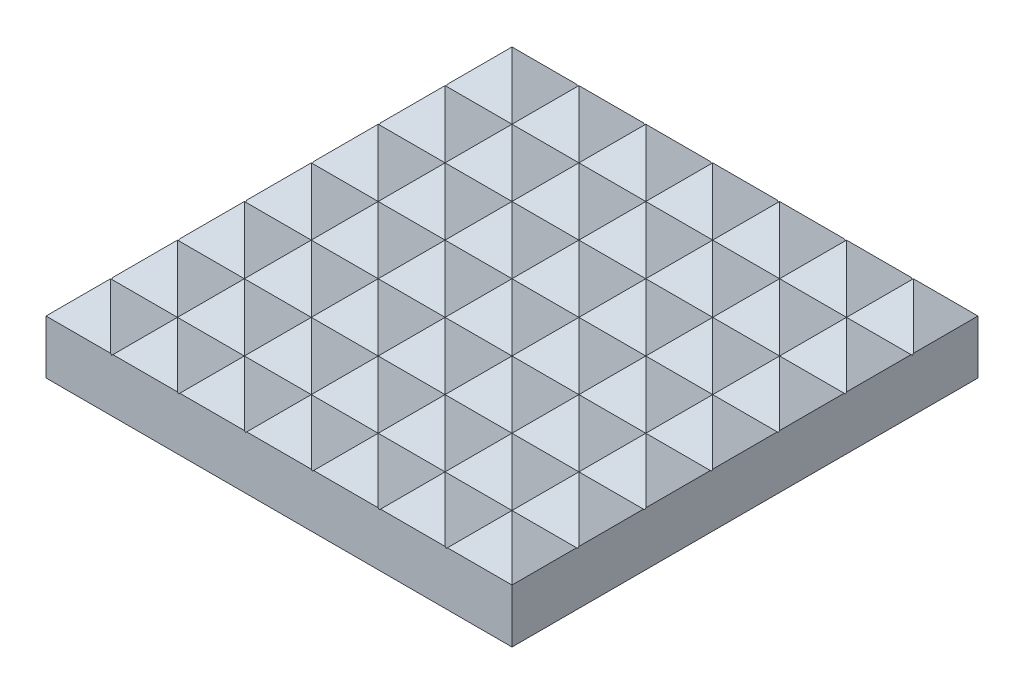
ISO-10303-21;
HEADER;
FILE_DESCRIPTION(('STEP AP214'),'2;1');
FILE_NAME('part.step','',(''),(''),'','','');
FILE_SCHEMA(('AUTOMOTIVE_DESIGN { 1 0 10303 214 1 1 1 1 }'));
ENDSEC;
DATA;
#1=APPLICATION_CONTEXT('core data for automotive mechanical design processes');
#2=APPLICATION_PROTOCOL_DEFINITION('international standard','automotive_design',2000,#1);
#3=PRODUCT_CONTEXT('',#1,'mechanical');
#4=PRODUCT('Part','Part','',(#3));
#5=PRODUCT_RELATED_PRODUCT_CATEGORY('part','',(#4));
#6=PRODUCT_DEFINITION_FORMATION('','',#4);
#7=PRODUCT_DEFINITION_CONTEXT('part definition',#1,'design');
#8=PRODUCT_DEFINITION('design','',#6,#7);
#9=PRODUCT_DEFINITION_SHAPE('','',#8);
#10=(LENGTH_UNIT() NAMED_UNIT(*) SI_UNIT(.MILLI.,.METRE.));
#11=(NAMED_UNIT(*) PLANE_ANGLE_UNIT() SI_UNIT($,.RADIAN.));
#12=(NAMED_UNIT(*) SI_UNIT($,.STERADIAN.) SOLID_ANGLE_UNIT());
#13=UNCERTAINTY_MEASURE_WITH_UNIT(LENGTH_MEASURE(1.E-05),#10,'distance_accuracy_value','');
#14=(GEOMETRIC_REPRESENTATION_CONTEXT(3) GLOBAL_UNCERTAINTY_ASSIGNED_CONTEXT((#13)) GLOBAL_UNIT_ASSIGNED_CONTEXT((#10,
#11,#12)) REPRESENTATION_CONTEXT('',''));
#15=CARTESIAN_POINT('',(0.,0.,0.));
#16=DIRECTION('',(0.,0.,1.));
#17=DIRECTION('',(1.,0.,0.));
#18=AXIS2_PLACEMENT_3D('',#15,#16,#17);
#19=CARTESIAN_POINT('',(-7.98,0.45,-7.94));
#20=DIRECTION('',(0.707106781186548,-0.707106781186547,0.));
#21=DIRECTION('',(0.707106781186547,0.707106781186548,0.));
#22=AXIS2_PLACEMENT_3D('',#19,#20,#21);
#23=PLANE('',#22);
#24=DIRECTION('',(0.577350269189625,0.577350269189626,-0.577350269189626));
#25=VECTOR('',#24,1.);
#26=CARTESIAN_POINT('',(-7.23333333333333,1.19666666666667,-6.44666666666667));
#27=LINE('',#26,#25);
#28=CARTESIAN_POINT('',(-7.94,0.489999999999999,-5.74));
#29=VERTEX_POINT('',#28);
#30=CARTESIAN_POINT('',(-6.84,1.59,-6.84));
#31=VERTEX_POINT('',#30);
#32=EDGE_CURVE('E590',#29,#31,#27,.T.);
#33=ORIENTED_EDGE('',*,*,#32,.T.);
#34=DIRECTION('',(-0.577350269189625,-0.577350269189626,-0.577350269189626));
#35=VECTOR('',#34,1.);
#36=CARTESIAN_POINT('',(-7.96666666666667,0.463333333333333,-7.96666666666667));
#37=LINE('',#36,#35);
#38=CARTESIAN_POINT('',(-7.94,0.489999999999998,-7.94));
#39=VERTEX_POINT('',#38);
#40=EDGE_CURVE('E563',#31,#39,#37,.T.);
#41=ORIENTED_EDGE('',*,*,#40,.T.);
#42=DIRECTION('',(0.,0.,-1.));
#43=VECTOR('',#42,1.);
#44=CARTESIAN_POINT('',(-7.94,0.489999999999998,7.94));
#45=LINE('',#44,#43);
#46=EDGE_CURVE('E597',#29,#39,#45,.T.);
#47=ORIENTED_EDGE('',*,*,#46,.F.);
#48=EDGE_LOOP('',(#33,#41,#47));
#49=FACE_BOUND('',#48,.T.);
#50=ADVANCED_FACE('F37',(#49),#23,.F.);
#51=CARTESIAN_POINT('',(-5.7,0.45,-7.94));
#52=DIRECTION('',(0.707106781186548,-0.707106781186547,0.));
#53=DIRECTION('',(0.707106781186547,0.707106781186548,0.));
#54=AXIS2_PLACEMENT_3D('',#51,#52,#53);
#55=PLANE('',#54);
#56=DIRECTION('',(0.577350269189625,0.577350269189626,-0.577350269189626));
#57=VECTOR('',#56,1.);
#58=CARTESIAN_POINT('',(-4.95333333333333,1.19666666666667,-6.44666666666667));
#59=LINE('',#58,#57);
#60=CARTESIAN_POINT('',(-5.7,0.449999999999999,-5.7));
#61=VERTEX_POINT('',#60);
#62=CARTESIAN_POINT('',(-4.56,1.59,-6.84));
#63=VERTEX_POINT('',#62);
#64=EDGE_CURVE('E595',#61,#63,#59,.T.);
#65=ORIENTED_EDGE('',*,*,#64,.T.);
#66=DIRECTION('',(-0.577350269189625,-0.577350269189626,-0.577350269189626));
#67=VECTOR('',#66,1.);
#68=CARTESIAN_POINT('',(-5.68666666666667,0.463333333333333,-7.96666666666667));
#69=LINE('',#68,#67);
#70=CARTESIAN_POINT('',(-5.66,0.489999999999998,-7.94));
#71=VERTEX_POINT('',#70);
#72=EDGE_CURVE('E1543',#63,#71,#69,.T.);
#73=ORIENTED_EDGE('',*,*,#72,.T.);
#74=DIRECTION('',(0.707106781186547,0.707106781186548,0.));
#75=VECTOR('',#74,1.);
#76=CARTESIAN_POINT('',(-5.7,0.45,-7.94));
#77=LINE('',#76,#75);
#78=CARTESIAN_POINT('',(-5.7,0.45,-7.94));
#79=VERTEX_POINT('',#78);
#80=EDGE_CURVE('E1445',#79,#71,#77,.T.);
#81=ORIENTED_EDGE('',*,*,#80,.F.);
#82=DIRECTION('',(0.,0.,1.));
#83=VECTOR('',#82,1.);
#84=CARTESIAN_POINT('',(-5.7,0.45,-7.94));
#85=LINE('',#84,#83);
#86=EDGE_CURVE('E1457',#79,#61,#85,.T.);
#87=ORIENTED_EDGE('',*,*,#86,.T.);
#88=EDGE_LOOP('',(#65,#73,#81,#87));
#89=FACE_BOUND('',#88,.T.);
#90=ADVANCED_FACE('F1727',(#89),#55,.F.);
#91=CARTESIAN_POINT('',(-6.84,1.59,-7.94));
#92=DIRECTION('',(-0.707106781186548,-0.707106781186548,0.));
#93=DIRECTION('',(0.707106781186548,-0.707106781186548,0.));
#94=AXIS2_PLACEMENT_3D('',#91,#92,#93);
#95=PLANE('',#94);
#96=DIRECTION('',(0.707106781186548,-0.707106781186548,0.));
#97=VECTOR('',#96,1.);
#98=CARTESIAN_POINT('',(-6.84,1.59,-7.94));
#99=LINE('',#98,#97);
#100=CARTESIAN_POINT('',(-5.74,0.489999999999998,-7.94));
#101=VERTEX_POINT('',#100);
#102=EDGE_CURVE('E584',#101,#79,#99,.T.);
#103=ORIENTED_EDGE('',*,*,#102,.F.);
#104=DIRECTION('',(-0.577350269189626,0.577350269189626,0.577350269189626));
#105=VECTOR('',#104,1.);
#106=CARTESIAN_POINT('',(-6.47333333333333,1.22333333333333,-7.20666666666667));
#107=LINE('',#106,#105);
#108=EDGE_CURVE('E566',#101,#31,#107,.T.);
#109=ORIENTED_EDGE('',*,*,#108,.T.);
#110=DIRECTION('',(0.577350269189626,-0.577350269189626,0.577350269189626));
#111=VECTOR('',#110,1.);
#112=CARTESIAN_POINT('',(-7.20666666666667,1.95666666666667,-7.20666666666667));
#113=LINE('',#112,#111);
#114=EDGE_CURVE('E582',#31,#61,#113,.T.);
#115=ORIENTED_EDGE('',*,*,#114,.T.);
#116=ORIENTED_EDGE('',*,*,#86,.F.);
#117=EDGE_LOOP('',(#103,#109,#115,#116));
#118=FACE_BOUND('',#117,.T.);
#119=ADVANCED_FACE('F580',(#118),#95,.F.);
#120=CARTESIAN_POINT('',(-3.42,0.45,-7.94));
#121=DIRECTION('',(0.707106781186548,-0.707106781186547,0.));
#122=DIRECTION('',(0.707106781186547,0.707106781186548,0.));
#123=AXIS2_PLACEMENT_3D('',#120,#121,#122);
#124=PLANE('',#123);
#125=DIRECTION('',(0.577350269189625,0.577350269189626,-0.577350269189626));
#126=VECTOR('',#125,1.);
#127=CARTESIAN_POINT('',(-2.67333333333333,1.19666666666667,-6.44666666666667));
#128=LINE('',#127,#126);
#129=CARTESIAN_POINT('',(-3.42,0.449999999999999,-5.7));
#130=VERTEX_POINT('',#129);
#131=CARTESIAN_POINT('',(-2.28,1.59,-6.84));
#132=VERTEX_POINT('',#131);
#133=EDGE_CURVE('E1716',#130,#132,#128,.T.);
#134=ORIENTED_EDGE('',*,*,#133,.T.);
#135=DIRECTION('',(-0.577350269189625,-0.577350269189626,-0.577350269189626));
#136=VECTOR('',#135,1.);
#137=CARTESIAN_POINT('',(-3.40666666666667,0.463333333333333,-7.96666666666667));
#138=LINE('',#137,#136);
#139=CARTESIAN_POINT('',(-3.38,0.489999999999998,-7.94));
#140=VERTEX_POINT('',#139);
#141=EDGE_CURVE('E1586',#132,#140,#138,.T.);
#142=ORIENTED_EDGE('',*,*,#141,.T.);
#143=DIRECTION('',(0.707106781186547,0.707106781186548,0.));
#144=VECTOR('',#143,1.);
#145=CARTESIAN_POINT('',(-3.42,0.45,-7.94));
#146=LINE('',#145,#144);
#147=CARTESIAN_POINT('',(-3.42,0.45,-7.94));
#148=VERTEX_POINT('',#147);
#149=EDGE_CURVE('E1416',#148,#140,#146,.T.);
#150=ORIENTED_EDGE('',*,*,#149,.F.);
#151=DIRECTION('',(0.,0.,1.));
#152=VECTOR('',#151,1.);
#153=CARTESIAN_POINT('',(-3.42,0.45,-7.94));
#154=LINE('',#153,#152);
#155=EDGE_CURVE('E1423',#148,#130,#154,.T.);
#156=ORIENTED_EDGE('',*,*,#155,.T.);
#157=EDGE_LOOP('',(#134,#142,#150,#156));
#158=FACE_BOUND('',#157,.T.);
#159=ADVANCED_FACE('F3346',(#158),#124,.F.);
#160=CARTESIAN_POINT('',(-4.56,1.59,-7.94));
#161=DIRECTION('',(-0.707106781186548,-0.707106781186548,0.));
#162=DIRECTION('',(0.707106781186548,-0.707106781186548,0.));
#163=AXIS2_PLACEMENT_3D('',#160,#161,#162);
#164=PLANE('',#163);
#165=DIRECTION('',(0.707106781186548,-0.707106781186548,0.));
#166=VECTOR('',#165,1.);
#167=CARTESIAN_POINT('',(-4.56,1.59,-7.94));
#168=LINE('',#167,#166);
#169=CARTESIAN_POINT('',(-3.46,0.489999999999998,-7.94));
#170=VERTEX_POINT('',#169);
#171=EDGE_CURVE('E1440',#170,#148,#168,.T.);
#172=ORIENTED_EDGE('',*,*,#171,.F.);
#173=DIRECTION('',(-0.577350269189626,0.577350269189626,0.577350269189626));
#174=VECTOR('',#173,1.);
#175=CARTESIAN_POINT('',(-4.19333333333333,1.22333333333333,-7.20666666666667));
#176=LINE('',#175,#174);
#177=EDGE_CURVE('E1593',#170,#63,#176,.T.);
#178=ORIENTED_EDGE('',*,*,#177,.T.);
#179=DIRECTION('',(0.577350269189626,-0.577350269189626,0.577350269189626));
#180=VECTOR('',#179,1.);
#181=CARTESIAN_POINT('',(-4.92666666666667,1.95666666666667,-7.20666666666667));
#182=LINE('',#181,#180);
#183=EDGE_CURVE('E1719',#63,#130,#182,.T.);
#184=ORIENTED_EDGE('',*,*,#183,.T.);
#185=ORIENTED_EDGE('',*,*,#155,.F.);
#186=EDGE_LOOP('',(#172,#178,#184,#185));
#187=FACE_BOUND('',#186,.T.);
#188=ADVANCED_FACE('F3354',(#187),#164,.F.);
#189=CARTESIAN_POINT('',(-1.14,0.45,-7.94));
#190=DIRECTION('',(0.707106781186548,-0.707106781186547,0.));
#191=DIRECTION('',(0.707106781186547,0.707106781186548,0.));
#192=AXIS2_PLACEMENT_3D('',#189,#190,#191);
#193=PLANE('',#192);
#194=DIRECTION('',(0.577350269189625,0.577350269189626,-0.577350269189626));
#195=VECTOR('',#194,1.);
#196=CARTESIAN_POINT('',(-0.393333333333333,1.19666666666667,-6.44666666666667));
#197=LINE('',#196,#195);
#198=CARTESIAN_POINT('',(-1.14,0.449999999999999,-5.7));
#199=VERTEX_POINT('',#198);
#200=CARTESIAN_POINT('',(0.,1.59,-6.84));
#201=VERTEX_POINT('',#200);
#202=EDGE_CURVE('E1708',#199,#201,#197,.T.);
#203=ORIENTED_EDGE('',*,*,#202,.T.);
#204=DIRECTION('',(-0.577350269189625,-0.577350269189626,-0.577350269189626));
#205=VECTOR('',#204,1.);
#206=CARTESIAN_POINT('',(-1.12666666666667,0.463333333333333,-7.96666666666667));
#207=LINE('',#206,#205);
#208=CARTESIAN_POINT('',(-1.1,0.489999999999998,-7.94));
#209=VERTEX_POINT('',#208);
#210=EDGE_CURVE('E1575',#201,#209,#207,.T.);
#211=ORIENTED_EDGE('',*,*,#210,.T.);
#212=DIRECTION('',(0.707106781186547,0.707106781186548,0.));
#213=VECTOR('',#212,1.);
#214=CARTESIAN_POINT('',(-1.14,0.45,-7.94));
#215=LINE('',#214,#213);
#216=CARTESIAN_POINT('',(-1.14,0.45,-7.94));
#217=VERTEX_POINT('',#216);
#218=EDGE_CURVE('E1395',#217,#209,#215,.T.);
#219=ORIENTED_EDGE('',*,*,#218,.F.);
#220=DIRECTION('',(0.,0.,1.));
#221=VECTOR('',#220,1.);
#222=CARTESIAN_POINT('',(-1.14,0.45,-7.94));
#223=LINE('',#222,#221);
#224=EDGE_CURVE('E1402',#217,#199,#223,.T.);
#225=ORIENTED_EDGE('',*,*,#224,.T.);
#226=EDGE_LOOP('',(#203,#211,#219,#225));
#227=FACE_BOUND('',#226,.T.);
#228=ADVANCED_FACE('F3364',(#227),#193,.F.);
#229=CARTESIAN_POINT('',(-2.28,1.59,-7.94));
#230=DIRECTION('',(-0.707106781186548,-0.707106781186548,0.));
#231=DIRECTION('',(0.707106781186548,-0.707106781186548,0.));
#232=AXIS2_PLACEMENT_3D('',#229,#230,#231);
#233=PLANE('',#232);
#234=DIRECTION('',(0.707106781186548,-0.707106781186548,0.));
#235=VECTOR('',#234,1.);
#236=CARTESIAN_POINT('',(-2.28,1.59,-7.94));
#237=LINE('',#236,#235);
#238=CARTESIAN_POINT('',(-1.18,0.489999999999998,-7.94));
#239=VERTEX_POINT('',#238);
#240=EDGE_CURVE('E1420',#239,#217,#237,.T.);
#241=ORIENTED_EDGE('',*,*,#240,.F.);
#242=DIRECTION('',(-0.577350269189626,0.577350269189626,0.577350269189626));
#243=VECTOR('',#242,1.);
#244=CARTESIAN_POINT('',(-1.91333333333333,1.22333333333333,-7.20666666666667));
#245=LINE('',#244,#243);
#246=EDGE_CURVE('E1582',#239,#132,#245,.T.);
#247=ORIENTED_EDGE('',*,*,#246,.T.);
#248=DIRECTION('',(0.577350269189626,-0.577350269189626,0.577350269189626));
#249=VECTOR('',#248,1.);
#250=CARTESIAN_POINT('',(-2.64666666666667,1.95666666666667,-7.20666666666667));
#251=LINE('',#250,#249);
#252=EDGE_CURVE('E1712',#132,#199,#251,.T.);
#253=ORIENTED_EDGE('',*,*,#252,.T.);
#254=ORIENTED_EDGE('',*,*,#224,.F.);
#255=EDGE_LOOP('',(#241,#247,#253,#254));
#256=FACE_BOUND('',#255,.T.);
#257=ADVANCED_FACE('F3375',(#256),#233,.F.);
#258=CARTESIAN_POINT('',(1.14,0.45,-7.94));
#259=DIRECTION('',(0.707106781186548,-0.707106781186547,0.));
#260=DIRECTION('',(0.707106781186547,0.707106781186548,0.));
#261=AXIS2_PLACEMENT_3D('',#258,#259,#260);
#262=PLANE('',#261);
#263=DIRECTION('',(0.577350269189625,0.577350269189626,-0.577350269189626));
#264=VECTOR('',#263,1.);
#265=CARTESIAN_POINT('',(1.88666666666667,1.19666666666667,-6.44666666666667));
#266=LINE('',#265,#264);
#267=CARTESIAN_POINT('',(1.14,0.449999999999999,-5.7));
#268=VERTEX_POINT('',#267);
#269=CARTESIAN_POINT('',(2.28,1.59,-6.84));
#270=VERTEX_POINT('',#269);
#271=EDGE_CURVE('E1700',#268,#270,#266,.T.);
#272=ORIENTED_EDGE('',*,*,#271,.T.);
#273=DIRECTION('',(-0.577350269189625,-0.577350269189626,-0.577350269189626));
#274=VECTOR('',#273,1.);
#275=CARTESIAN_POINT('',(1.15333333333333,0.463333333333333,-7.96666666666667));
#276=LINE('',#275,#274);
#277=CARTESIAN_POINT('',(1.18,0.489999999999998,-7.94));
#278=VERTEX_POINT('',#277);
#279=EDGE_CURVE('E1563',#270,#278,#276,.T.);
#280=ORIENTED_EDGE('',*,*,#279,.T.);
#281=DIRECTION('',(0.707106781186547,0.707106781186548,0.));
#282=VECTOR('',#281,1.);
#283=CARTESIAN_POINT('',(1.14,0.45,-7.94));
#284=LINE('',#283,#282);
#285=CARTESIAN_POINT('',(1.14,0.45,-7.94));
#286=VERTEX_POINT('',#285);
#287=EDGE_CURVE('E1374',#286,#278,#284,.T.);
#288=ORIENTED_EDGE('',*,*,#287,.F.);
#289=DIRECTION('',(0.,0.,1.));
#290=VECTOR('',#289,1.);
#291=CARTESIAN_POINT('',(1.14,0.45,-7.94));
#292=LINE('',#291,#290);
#293=EDGE_CURVE('E1381',#286,#268,#292,.T.);
#294=ORIENTED_EDGE('',*,*,#293,.T.);
#295=EDGE_LOOP('',(#272,#280,#288,#294));
#296=FACE_BOUND('',#295,.T.);
#297=ADVANCED_FACE('F2345',(#296),#262,.F.);
#298=CARTESIAN_POINT('',(0.,1.59,-7.94));
#299=DIRECTION('',(-0.707106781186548,-0.707106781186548,0.));
#300=DIRECTION('',(0.707106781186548,-0.707106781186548,0.));
#301=AXIS2_PLACEMENT_3D('',#298,#299,#300);
#302=PLANE('',#301);
#303=DIRECTION('',(0.707106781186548,-0.707106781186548,0.));
#304=VECTOR('',#303,1.);
#305=CARTESIAN_POINT('',(0.,1.59,-7.94));
#306=LINE('',#305,#304);
#307=CARTESIAN_POINT('',(1.1,0.489999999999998,-7.94));
#308=VERTEX_POINT('',#307);
#309=EDGE_CURVE('E1399',#308,#286,#306,.T.);
#310=ORIENTED_EDGE('',*,*,#309,.F.);
#311=DIRECTION('',(-0.577350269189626,0.577350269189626,0.577350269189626));
#312=VECTOR('',#311,1.);
#313=CARTESIAN_POINT('',(0.366666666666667,1.22333333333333,-7.20666666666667));
#314=LINE('',#313,#312);
#315=EDGE_CURVE('E1570',#308,#201,#314,.T.);
#316=ORIENTED_EDGE('',*,*,#315,.T.);
#317=DIRECTION('',(0.577350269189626,-0.577350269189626,0.577350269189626));
#318=VECTOR('',#317,1.);
#319=CARTESIAN_POINT('',(-0.366666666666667,1.95666666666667,-7.20666666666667));
#320=LINE('',#319,#318);
#321=EDGE_CURVE('E1704',#201,#268,#320,.T.);
#322=ORIENTED_EDGE('',*,*,#321,.T.);
#323=ORIENTED_EDGE('',*,*,#293,.F.);
#324=EDGE_LOOP('',(#310,#316,#322,#323));
#325=FACE_BOUND('',#324,.T.);
#326=ADVANCED_FACE('F2347',(#325),#302,.F.);
#327=CARTESIAN_POINT('',(3.42,0.45,-7.94));
#328=DIRECTION('',(0.707106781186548,-0.707106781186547,0.));
#329=DIRECTION('',(0.707106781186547,0.707106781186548,0.));
#330=AXIS2_PLACEMENT_3D('',#327,#328,#329);
#331=PLANE('',#330);
#332=DIRECTION('',(0.577350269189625,0.577350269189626,-0.577350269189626));
#333=VECTOR('',#332,1.);
#334=CARTESIAN_POINT('',(4.16666666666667,1.19666666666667,-6.44666666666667));
#335=LINE('',#334,#333);
#336=CARTESIAN_POINT('',(3.42,0.45,-5.7));
#337=VERTEX_POINT('',#336);
#338=CARTESIAN_POINT('',(4.56,1.59,-6.84));
#339=VERTEX_POINT('',#338);
#340=EDGE_CURVE('E1692',#337,#339,#335,.T.);
#341=ORIENTED_EDGE('',*,*,#340,.T.);
#342=DIRECTION('',(-0.577350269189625,-0.577350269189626,-0.577350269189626));
#343=VECTOR('',#342,1.);
#344=CARTESIAN_POINT('',(3.43333333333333,0.463333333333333,-7.96666666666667));
#345=LINE('',#344,#343);
#346=CARTESIAN_POINT('',(3.46,0.489999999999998,-7.94));
#347=VERTEX_POINT('',#346);
#348=EDGE_CURVE('E1551',#339,#347,#345,.T.);
#349=ORIENTED_EDGE('',*,*,#348,.T.);
#350=DIRECTION('',(0.707106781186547,0.707106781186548,0.));
#351=VECTOR('',#350,1.);
#352=CARTESIAN_POINT('',(3.42,0.45,-7.94));
#353=LINE('',#352,#351);
#354=CARTESIAN_POINT('',(3.42,0.45,-7.94));
#355=VERTEX_POINT('',#354);
#356=EDGE_CURVE('E1353',#355,#347,#353,.T.);
#357=ORIENTED_EDGE('',*,*,#356,.F.);
#358=DIRECTION('',(0.,0.,1.));
#359=VECTOR('',#358,1.);
#360=CARTESIAN_POINT('',(3.42,0.45,-7.94));
#361=LINE('',#360,#359);
#362=EDGE_CURVE('E1360',#355,#337,#361,.T.);
#363=ORIENTED_EDGE('',*,*,#362,.T.);
#364=EDGE_LOOP('',(#341,#349,#357,#363));
#365=FACE_BOUND('',#364,.T.);
#366=ADVANCED_FACE('F2529',(#365),#331,.F.);
#367=CARTESIAN_POINT('',(2.28,1.59,-7.94));
#368=DIRECTION('',(-0.707106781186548,-0.707106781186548,0.));
#369=DIRECTION('',(0.707106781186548,-0.707106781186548,0.));
#370=AXIS2_PLACEMENT_3D('',#367,#368,#369);
#371=PLANE('',#370);
#372=DIRECTION('',(0.707106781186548,-0.707106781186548,0.));
#373=VECTOR('',#372,1.);
#374=CARTESIAN_POINT('',(2.28,1.59,-7.94));
#375=LINE('',#374,#373);
#376=CARTESIAN_POINT('',(3.38,0.489999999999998,-7.94));
#377=VERTEX_POINT('',#376);
#378=EDGE_CURVE('E1378',#377,#355,#375,.T.);
#379=ORIENTED_EDGE('',*,*,#378,.F.);
#380=DIRECTION('',(-0.577350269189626,0.577350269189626,0.577350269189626));
#381=VECTOR('',#380,1.);
#382=CARTESIAN_POINT('',(2.64666666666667,1.22333333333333,-7.20666666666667));
#383=LINE('',#382,#381);
#384=EDGE_CURVE('E1558',#377,#270,#383,.T.);
#385=ORIENTED_EDGE('',*,*,#384,.T.);
#386=DIRECTION('',(0.577350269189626,-0.577350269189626,0.577350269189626));
#387=VECTOR('',#386,1.);
#388=CARTESIAN_POINT('',(1.91333333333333,1.95666666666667,-7.20666666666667));
#389=LINE('',#388,#387);
#390=EDGE_CURVE('E1696',#270,#337,#389,.T.);
#391=ORIENTED_EDGE('',*,*,#390,.T.);
#392=ORIENTED_EDGE('',*,*,#362,.F.);
#393=EDGE_LOOP('',(#379,#385,#391,#392));
#394=FACE_BOUND('',#393,.T.);
#395=ADVANCED_FACE('F2525',(#394),#371,.F.);
#396=CARTESIAN_POINT('',(5.7,0.45,-7.94));
#397=DIRECTION('',(0.707106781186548,-0.707106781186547,0.));
#398=DIRECTION('',(0.707106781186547,0.707106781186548,0.));
#399=AXIS2_PLACEMENT_3D('',#396,#397,#398);
#400=PLANE('',#399);
#401=DIRECTION('',(0.577350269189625,0.577350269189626,-0.577350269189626));
#402=VECTOR('',#401,1.);
#403=CARTESIAN_POINT('',(6.44666666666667,1.19666666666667,-6.44666666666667));
#404=LINE('',#403,#402);
#405=CARTESIAN_POINT('',(5.7,0.449999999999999,-5.7));
#406=VERTEX_POINT('',#405);
#407=CARTESIAN_POINT('',(6.84,1.59,-6.84));
#408=VERTEX_POINT('',#407);
#409=EDGE_CURVE('E1684',#406,#408,#404,.T.);
#410=ORIENTED_EDGE('',*,*,#409,.T.);
#411=DIRECTION('',(-0.577350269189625,-0.577350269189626,-0.577350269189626));
#412=VECTOR('',#411,1.);
#413=CARTESIAN_POINT('',(5.71333333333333,0.463333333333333,-7.96666666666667));
#414=LINE('',#413,#412);
#415=CARTESIAN_POINT('',(5.74,0.489999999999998,-7.94));
#416=VERTEX_POINT('',#415);
#417=EDGE_CURVE('E1540',#408,#416,#414,.T.);
#418=ORIENTED_EDGE('',*,*,#417,.T.);
#419=DIRECTION('',(0.707106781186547,0.707106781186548,0.));
#420=VECTOR('',#419,1.);
#421=CARTESIAN_POINT('',(5.7,0.45,-7.94));
#422=LINE('',#421,#420);
#423=CARTESIAN_POINT('',(5.7,0.45,-7.94));
#424=VERTEX_POINT('',#423);
#425=EDGE_CURVE('E1336',#424,#416,#422,.T.);
#426=ORIENTED_EDGE('',*,*,#425,.F.);
#427=DIRECTION('',(0.,0.,1.));
#428=VECTOR('',#427,1.);
#429=CARTESIAN_POINT('',(5.7,0.45,-7.94));
#430=LINE('',#429,#428);
#431=EDGE_CURVE('E1339',#424,#406,#430,.T.);
#432=ORIENTED_EDGE('',*,*,#431,.T.);
#433=EDGE_LOOP('',(#410,#418,#426,#432));
#434=FACE_BOUND('',#433,.T.);
#435=ADVANCED_FACE('F1781',(#434),#400,.F.);
#436=CARTESIAN_POINT('',(4.56,1.59,-7.94));
#437=DIRECTION('',(-0.707106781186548,-0.707106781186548,0.));
#438=DIRECTION('',(0.707106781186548,-0.707106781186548,0.));
#439=AXIS2_PLACEMENT_3D('',#436,#437,#438);
#440=PLANE('',#439);
#441=DIRECTION('',(0.707106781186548,-0.707106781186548,0.));
#442=VECTOR('',#441,1.);
#443=CARTESIAN_POINT('',(4.56,1.59,-7.94));
#444=LINE('',#443,#442);
#445=CARTESIAN_POINT('',(5.66,0.489999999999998,-7.94));
#446=VERTEX_POINT('',#445);
#447=EDGE_CURVE('E1357',#446,#424,#444,.T.);
#448=ORIENTED_EDGE('',*,*,#447,.F.);
#449=DIRECTION('',(-0.577350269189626,0.577350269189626,0.577350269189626));
#450=VECTOR('',#449,1.);
#451=CARTESIAN_POINT('',(4.92666666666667,1.22333333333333,-7.20666666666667));
#452=LINE('',#451,#450);
#453=EDGE_CURVE('E1546',#446,#339,#452,.T.);
#454=ORIENTED_EDGE('',*,*,#453,.T.);
#455=DIRECTION('',(0.577350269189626,-0.577350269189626,0.577350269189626));
#456=VECTOR('',#455,1.);
#457=CARTESIAN_POINT('',(4.19333333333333,1.95666666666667,-7.20666666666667));
#458=LINE('',#457,#456);
#459=EDGE_CURVE('E1688',#339,#406,#458,.T.);
#460=ORIENTED_EDGE('',*,*,#459,.T.);
#461=ORIENTED_EDGE('',*,*,#431,.F.);
#462=EDGE_LOOP('',(#448,#454,#460,#461));
#463=FACE_BOUND('',#462,.T.);
#464=ADVANCED_FACE('F1785',(#463),#440,.F.);
#465=CARTESIAN_POINT('',(6.84,1.59,-7.94));
#466=DIRECTION('',(-0.707106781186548,-0.707106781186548,0.));
#467=DIRECTION('',(0.707106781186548,-0.707106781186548,0.));
#468=AXIS2_PLACEMENT_3D('',#465,#466,#467);
#469=PLANE('',#468);
#470=DIRECTION('',(0.,0.,1.));
#471=VECTOR('',#470,1.);
#472=CARTESIAN_POINT('',(7.94,0.489999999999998,7.94));
#473=LINE('',#472,#471);
#474=CARTESIAN_POINT('',(7.94,0.489999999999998,-7.94));
#475=VERTEX_POINT('',#474);
#476=CARTESIAN_POINT('',(7.94,0.489999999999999,-5.74));
#477=VERTEX_POINT('',#476);
#478=EDGE_CURVE('E1332',#475,#477,#473,.T.);
#479=ORIENTED_EDGE('',*,*,#478,.F.);
#480=DIRECTION('',(-0.577350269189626,0.577350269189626,0.577350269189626));
#481=VECTOR('',#480,1.);
#482=CARTESIAN_POINT('',(7.20666666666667,1.22333333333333,-7.20666666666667));
#483=LINE('',#482,#481);
#484=EDGE_CURVE('E1532',#475,#408,#483,.T.);
#485=ORIENTED_EDGE('',*,*,#484,.T.);
#486=DIRECTION('',(0.577350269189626,-0.577350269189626,0.577350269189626));
#487=VECTOR('',#486,1.);
#488=CARTESIAN_POINT('',(6.47333333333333,1.95666666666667,-7.20666666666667));
#489=LINE('',#488,#487);
#490=EDGE_CURVE('E1680',#408,#477,#489,.T.);
#491=ORIENTED_EDGE('',*,*,#490,.T.);
#492=EDGE_LOOP('',(#479,#485,#491));
#493=FACE_BOUND('',#492,.T.);
#494=ADVANCED_FACE('F1779',(#493),#469,.F.);
#495=DIRECTION('',(0.577350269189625,0.577350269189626,-0.577350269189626));
#496=VECTOR('',#495,1.);
#497=CARTESIAN_POINT('',(-6.47333333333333,1.95666666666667,-4.92666666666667));
#498=LINE('',#497,#496);
#499=CARTESIAN_POINT('',(-7.94,0.489999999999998,-3.46));
#500=VERTEX_POINT('',#499);
#501=CARTESIAN_POINT('',(-6.84,1.59,-4.56));
#502=VERTEX_POINT('',#501);
#503=EDGE_CURVE('E734',#500,#502,#498,.T.);
#504=ORIENTED_EDGE('',*,*,#503,.T.);
#505=DIRECTION('',(-0.577350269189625,-0.577350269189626,-0.577350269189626));
#506=VECTOR('',#505,1.);
#507=CARTESIAN_POINT('',(-8.72666666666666,-0.296666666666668,-6.44666666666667));
#508=LINE('',#507,#506);
#509=CARTESIAN_POINT('',(-7.94,0.49,-5.66));
#510=VERTEX_POINT('',#509);
#511=EDGE_CURVE('E1676',#502,#510,#508,.T.);
#512=ORIENTED_EDGE('',*,*,#511,.T.);
#513=EDGE_CURVE('E2269',#500,#510,#45,.T.);
#514=ORIENTED_EDGE('',*,*,#513,.F.);
#515=EDGE_LOOP('',(#504,#512,#514));
#516=FACE_BOUND('',#515,.T.);
#517=ADVANCED_FACE('F1998',(#516),#23,.F.);
#518=DIRECTION('',(0.577350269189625,0.577350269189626,-0.577350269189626));
#519=VECTOR('',#518,1.);
#520=CARTESIAN_POINT('',(-4.19333333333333,1.95666666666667,-4.92666666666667));
#521=LINE('',#520,#519);
#522=CARTESIAN_POINT('',(-5.7,0.45,-3.42));
#523=VERTEX_POINT('',#522);
#524=CARTESIAN_POINT('',(-4.56,1.59,-4.56));
#525=VERTEX_POINT('',#524);
#526=EDGE_CURVE('E726',#523,#525,#521,.T.);
#527=ORIENTED_EDGE('',*,*,#526,.T.);
#528=DIRECTION('',(-0.577350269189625,-0.577350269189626,-0.577350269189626));
#529=VECTOR('',#528,1.);
#530=CARTESIAN_POINT('',(-6.44666666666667,-0.296666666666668,-6.44666666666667));
#531=LINE('',#530,#529);
#532=EDGE_CURVE('E1669',#525,#61,#531,.T.);
#533=ORIENTED_EDGE('',*,*,#532,.T.);
#534=EDGE_CURVE('E1461',#61,#523,#85,.T.);
#535=ORIENTED_EDGE('',*,*,#534,.T.);
#536=EDGE_LOOP('',(#527,#533,#535));
#537=FACE_BOUND('',#536,.T.);
#538=ADVANCED_FACE('F2003',(#537),#55,.F.);
#539=ORIENTED_EDGE('',*,*,#534,.F.);
#540=DIRECTION('',(-0.577350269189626,0.577350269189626,0.577350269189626));
#541=VECTOR('',#540,1.);
#542=CARTESIAN_POINT('',(-5.71333333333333,0.463333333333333,-5.68666666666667));
#543=LINE('',#542,#541);
#544=EDGE_CURVE('E1672',#61,#502,#543,.T.);
#545=ORIENTED_EDGE('',*,*,#544,.T.);
#546=DIRECTION('',(0.577350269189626,-0.577350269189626,0.577350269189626));
#547=VECTOR('',#546,1.);
#548=CARTESIAN_POINT('',(-7.96666666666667,2.71666666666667,-5.68666666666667));
#549=LINE('',#548,#547);
#550=EDGE_CURVE('E730',#502,#523,#549,.T.);
#551=ORIENTED_EDGE('',*,*,#550,.T.);
#552=EDGE_LOOP('',(#539,#545,#551));
#553=FACE_BOUND('',#552,.T.);
#554=ADVANCED_FACE('F2264',(#553),#95,.F.);
#555=DIRECTION('',(0.577350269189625,0.577350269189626,-0.577350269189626));
#556=VECTOR('',#555,1.);
#557=CARTESIAN_POINT('',(-1.91333333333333,1.95666666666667,-4.92666666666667));
#558=LINE('',#557,#556);
#559=CARTESIAN_POINT('',(-3.42,0.45,-3.42));
#560=VERTEX_POINT('',#559);
#561=CARTESIAN_POINT('',(-2.28,1.59,-4.56));
#562=VERTEX_POINT('',#561);
#563=EDGE_CURVE('E718',#560,#562,#558,.T.);
#564=ORIENTED_EDGE('',*,*,#563,.T.);
#565=DIRECTION('',(-0.577350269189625,-0.577350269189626,-0.577350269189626));
#566=VECTOR('',#565,1.);
#567=CARTESIAN_POINT('',(-4.16666666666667,-0.296666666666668,-6.44666666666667));
#568=LINE('',#567,#566);
#569=EDGE_CURVE('E1661',#562,#130,#568,.T.);
#570=ORIENTED_EDGE('',*,*,#569,.T.);
#571=EDGE_CURVE('E1427',#130,#560,#154,.T.);
#572=ORIENTED_EDGE('',*,*,#571,.T.);
#573=EDGE_LOOP('',(#564,#570,#572));
#574=FACE_BOUND('',#573,.T.);
#575=ADVANCED_FACE('F3356',(#574),#124,.F.);
#576=ORIENTED_EDGE('',*,*,#571,.F.);
#577=DIRECTION('',(-0.577350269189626,0.577350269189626,0.577350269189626));
#578=VECTOR('',#577,1.);
#579=CARTESIAN_POINT('',(-3.43333333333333,0.463333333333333,-5.68666666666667));
#580=LINE('',#579,#578);
#581=EDGE_CURVE('E1665',#130,#525,#580,.T.);
#582=ORIENTED_EDGE('',*,*,#581,.T.);
#583=DIRECTION('',(0.577350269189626,-0.577350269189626,0.577350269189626));
#584=VECTOR('',#583,1.);
#585=CARTESIAN_POINT('',(-5.68666666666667,2.71666666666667,-5.68666666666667));
#586=LINE('',#585,#584);
#587=EDGE_CURVE('E722',#525,#560,#586,.T.);
#588=ORIENTED_EDGE('',*,*,#587,.T.);
#589=EDGE_LOOP('',(#576,#582,#588));
#590=FACE_BOUND('',#589,.T.);
#591=ADVANCED_FACE('F3367',(#590),#164,.F.);
#592=DIRECTION('',(0.577350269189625,0.577350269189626,-0.577350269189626));
#593=VECTOR('',#592,1.);
#594=CARTESIAN_POINT('',(0.366666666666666,1.95666666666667,-4.92666666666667));
#595=LINE('',#594,#593);
#596=CARTESIAN_POINT('',(-1.14,0.45,-3.42));
#597=VERTEX_POINT('',#596);
#598=CARTESIAN_POINT('',(0.,1.59,-4.56));
#599=VERTEX_POINT('',#598);
#600=EDGE_CURVE('E710',#597,#599,#595,.T.);
#601=ORIENTED_EDGE('',*,*,#600,.T.);
#602=DIRECTION('',(-0.577350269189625,-0.577350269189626,-0.577350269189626));
#603=VECTOR('',#602,1.);
#604=CARTESIAN_POINT('',(-1.88666666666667,-0.296666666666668,-6.44666666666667));
#605=LINE('',#604,#603);
#606=EDGE_CURVE('E1653',#599,#199,#605,.T.);
#607=ORIENTED_EDGE('',*,*,#606,.T.);
#608=EDGE_CURVE('E1407',#199,#597,#223,.T.);
#609=ORIENTED_EDGE('',*,*,#608,.T.);
#610=EDGE_LOOP('',(#601,#607,#609));
#611=FACE_BOUND('',#610,.T.);
#612=ADVANCED_FACE('F3378',(#611),#193,.F.);
#613=ORIENTED_EDGE('',*,*,#608,.F.);
#614=DIRECTION('',(-0.577350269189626,0.577350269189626,0.577350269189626));
#615=VECTOR('',#614,1.);
#616=CARTESIAN_POINT('',(-1.15333333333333,0.463333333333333,-5.68666666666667));
#617=LINE('',#616,#615);
#618=EDGE_CURVE('E1657',#199,#562,#617,.T.);
#619=ORIENTED_EDGE('',*,*,#618,.T.);
#620=DIRECTION('',(0.577350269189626,-0.577350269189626,0.577350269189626));
#621=VECTOR('',#620,1.);
#622=CARTESIAN_POINT('',(-3.40666666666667,2.71666666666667,-5.68666666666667));
#623=LINE('',#622,#621);
#624=EDGE_CURVE('E714',#562,#597,#623,.T.);
#625=ORIENTED_EDGE('',*,*,#624,.T.);
#626=EDGE_LOOP('',(#613,#619,#625));
#627=FACE_BOUND('',#626,.T.);
#628=ADVANCED_FACE('F3388',(#627),#233,.F.);
#629=DIRECTION('',(0.577350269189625,0.577350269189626,-0.577350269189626));
#630=VECTOR('',#629,1.);
#631=CARTESIAN_POINT('',(2.64666666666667,1.95666666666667,-4.92666666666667));
#632=LINE('',#631,#630);
#633=CARTESIAN_POINT('',(1.14,0.45,-3.42));
#634=VERTEX_POINT('',#633);
#635=CARTESIAN_POINT('',(2.28,1.59,-4.56));
#636=VERTEX_POINT('',#635);
#637=EDGE_CURVE('E702',#634,#636,#632,.T.);
#638=ORIENTED_EDGE('',*,*,#637,.T.);
#639=DIRECTION('',(-0.577350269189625,-0.577350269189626,-0.577350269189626));
#640=VECTOR('',#639,1.);
#641=CARTESIAN_POINT('',(0.393333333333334,-0.296666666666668,-6.44666666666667));
#642=LINE('',#641,#640);
#643=EDGE_CURVE('E1645',#636,#268,#642,.T.);
#644=ORIENTED_EDGE('',*,*,#643,.T.);
#645=EDGE_CURVE('E1386',#268,#634,#292,.T.);
#646=ORIENTED_EDGE('',*,*,#645,.T.);
#647=EDGE_LOOP('',(#638,#644,#646));
#648=FACE_BOUND('',#647,.T.);
#649=ADVANCED_FACE('F2349',(#648),#262,.F.);
#650=ORIENTED_EDGE('',*,*,#645,.F.);
#651=DIRECTION('',(-0.577350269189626,0.577350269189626,0.577350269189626));
#652=VECTOR('',#651,1.);
#653=CARTESIAN_POINT('',(1.12666666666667,0.463333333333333,-5.68666666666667));
#654=LINE('',#653,#652);
#655=EDGE_CURVE('E1649',#268,#599,#654,.T.);
#656=ORIENTED_EDGE('',*,*,#655,.T.);
#657=DIRECTION('',(0.577350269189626,-0.577350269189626,0.577350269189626));
#658=VECTOR('',#657,1.);
#659=CARTESIAN_POINT('',(-1.12666666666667,2.71666666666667,-5.68666666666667));
#660=LINE('',#659,#658);
#661=EDGE_CURVE('E706',#599,#634,#660,.T.);
#662=ORIENTED_EDGE('',*,*,#661,.T.);
#663=EDGE_LOOP('',(#650,#656,#662));
#664=FACE_BOUND('',#663,.T.);
#665=ADVANCED_FACE('F2352',(#664),#302,.F.);
#666=DIRECTION('',(0.577350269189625,0.577350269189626,-0.577350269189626));
#667=VECTOR('',#666,1.);
#668=CARTESIAN_POINT('',(4.92666666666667,1.95666666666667,-4.92666666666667));
#669=LINE('',#668,#667);
#670=CARTESIAN_POINT('',(3.42,0.45,-3.42));
#671=VERTEX_POINT('',#670);
#672=CARTESIAN_POINT('',(4.56,1.59,-4.56));
#673=VERTEX_POINT('',#672);
#674=EDGE_CURVE('E694',#671,#673,#669,.T.);
#675=ORIENTED_EDGE('',*,*,#674,.T.);
#676=DIRECTION('',(-0.577350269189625,-0.577350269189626,-0.577350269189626));
#677=VECTOR('',#676,1.);
#678=CARTESIAN_POINT('',(2.67333333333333,-0.296666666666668,-6.44666666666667));
#679=LINE('',#678,#677);
#680=EDGE_CURVE('E1637',#673,#337,#679,.T.);
#681=ORIENTED_EDGE('',*,*,#680,.T.);
#682=EDGE_CURVE('E1365',#337,#671,#361,.T.);
#683=ORIENTED_EDGE('',*,*,#682,.T.);
#684=EDGE_LOOP('',(#675,#681,#683));
#685=FACE_BOUND('',#684,.T.);
#686=ADVANCED_FACE('F2560',(#685),#331,.F.);
#687=ORIENTED_EDGE('',*,*,#682,.F.);
#688=DIRECTION('',(-0.577350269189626,0.577350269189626,0.577350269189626));
#689=VECTOR('',#688,1.);
#690=CARTESIAN_POINT('',(3.40666666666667,0.463333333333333,-5.68666666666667));
#691=LINE('',#690,#689);
#692=EDGE_CURVE('E1641',#337,#636,#691,.T.);
#693=ORIENTED_EDGE('',*,*,#692,.T.);
#694=DIRECTION('',(0.577350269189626,-0.577350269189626,0.577350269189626));
#695=VECTOR('',#694,1.);
#696=CARTESIAN_POINT('',(1.15333333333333,2.71666666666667,-5.68666666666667));
#697=LINE('',#696,#695);
#698=EDGE_CURVE('E698',#636,#671,#697,.T.);
#699=ORIENTED_EDGE('',*,*,#698,.T.);
#700=EDGE_LOOP('',(#687,#693,#699));
#701=FACE_BOUND('',#700,.T.);
#702=ADVANCED_FACE('F2519',(#701),#371,.F.);
#703=DIRECTION('',(0.577350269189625,0.577350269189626,-0.577350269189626));
#704=VECTOR('',#703,1.);
#705=CARTESIAN_POINT('',(7.20666666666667,1.95666666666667,-4.92666666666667));
#706=LINE('',#705,#704);
#707=CARTESIAN_POINT('',(5.7,0.45,-3.42));
#708=VERTEX_POINT('',#707);
#709=CARTESIAN_POINT('',(6.84,1.59,-4.56));
#710=VERTEX_POINT('',#709);
#711=EDGE_CURVE('E686',#708,#710,#706,.T.);
#712=ORIENTED_EDGE('',*,*,#711,.T.);
#713=DIRECTION('',(-0.577350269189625,-0.577350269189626,-0.577350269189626));
#714=VECTOR('',#713,1.);
#715=CARTESIAN_POINT('',(4.95333333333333,-0.296666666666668,-6.44666666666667));
#716=LINE('',#715,#714);
#717=EDGE_CURVE('E1629',#710,#406,#716,.T.);
#718=ORIENTED_EDGE('',*,*,#717,.T.);
#719=EDGE_CURVE('E1344',#406,#708,#430,.T.);
#720=ORIENTED_EDGE('',*,*,#719,.T.);
#721=EDGE_LOOP('',(#712,#718,#720));
#722=FACE_BOUND('',#721,.T.);
#723=ADVANCED_FACE('F1788',(#722),#400,.F.);
#724=ORIENTED_EDGE('',*,*,#719,.F.);
#725=DIRECTION('',(-0.577350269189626,0.577350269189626,0.577350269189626));
#726=VECTOR('',#725,1.);
#727=CARTESIAN_POINT('',(5.68666666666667,0.463333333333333,-5.68666666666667));
#728=LINE('',#727,#726);
#729=EDGE_CURVE('E1633',#406,#673,#728,.T.);
#730=ORIENTED_EDGE('',*,*,#729,.T.);
#731=DIRECTION('',(0.577350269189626,-0.577350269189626,0.577350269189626));
#732=VECTOR('',#731,1.);
#733=CARTESIAN_POINT('',(3.43333333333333,2.71666666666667,-5.68666666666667));
#734=LINE('',#733,#732);
#735=EDGE_CURVE('E690',#673,#708,#734,.T.);
#736=ORIENTED_EDGE('',*,*,#735,.T.);
#737=EDGE_LOOP('',(#724,#730,#736));
#738=FACE_BOUND('',#737,.T.);
#739=ADVANCED_FACE('F1792',(#738),#440,.F.);
#740=CARTESIAN_POINT('',(7.94,0.489999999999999,-5.66));
#741=VERTEX_POINT('',#740);
#742=CARTESIAN_POINT('',(7.94,0.489999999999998,-3.46));
#743=VERTEX_POINT('',#742);
#744=EDGE_CURVE('E1337',#741,#743,#473,.T.);
#745=ORIENTED_EDGE('',*,*,#744,.F.);
#746=DIRECTION('',(-0.577350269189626,0.577350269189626,0.577350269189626));
#747=VECTOR('',#746,1.);
#748=CARTESIAN_POINT('',(7.96666666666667,0.463333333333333,-5.68666666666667));
#749=LINE('',#748,#747);
#750=EDGE_CURVE('E1617',#741,#710,#749,.T.);
#751=ORIENTED_EDGE('',*,*,#750,.T.);
#752=DIRECTION('',(0.577350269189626,-0.577350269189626,0.577350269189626));
#753=VECTOR('',#752,1.);
#754=CARTESIAN_POINT('',(5.71333333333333,2.71666666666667,-5.68666666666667));
#755=LINE('',#754,#753);
#756=EDGE_CURVE('E682',#710,#743,#755,.T.);
#757=ORIENTED_EDGE('',*,*,#756,.T.);
#758=EDGE_LOOP('',(#745,#751,#757));
#759=FACE_BOUND('',#758,.T.);
#760=ADVANCED_FACE('F1898',(#759),#469,.F.);
#761=DIRECTION('',(0.577350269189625,0.577350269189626,-0.577350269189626));
#762=VECTOR('',#761,1.);
#763=CARTESIAN_POINT('',(-5.71333333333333,2.71666666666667,-3.40666666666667));
#764=LINE('',#763,#762);
#765=CARTESIAN_POINT('',(-7.94,0.489999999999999,-1.18));
#766=VERTEX_POINT('',#765);
#767=CARTESIAN_POINT('',(-6.84,1.59,-2.28));
#768=VERTEX_POINT('',#767);
#769=EDGE_CURVE('E868',#766,#768,#764,.T.);
#770=ORIENTED_EDGE('',*,*,#769,.T.);
#771=DIRECTION('',(-0.577350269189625,-0.577350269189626,-0.577350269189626));
#772=VECTOR('',#771,1.);
#773=CARTESIAN_POINT('',(-9.48666666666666,-1.05666666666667,-4.92666666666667));
#774=LINE('',#773,#772);
#775=CARTESIAN_POINT('',(-7.94,0.49,-3.38));
#776=VERTEX_POINT('',#775);
#777=EDGE_CURVE('E678',#768,#776,#774,.T.);
#778=ORIENTED_EDGE('',*,*,#777,.T.);
#779=EDGE_CURVE('E2061',#766,#776,#45,.T.);
#780=ORIENTED_EDGE('',*,*,#779,.F.);
#781=EDGE_LOOP('',(#770,#778,#780));
#782=FACE_BOUND('',#781,.T.);
#783=ADVANCED_FACE('F2008',(#782),#23,.F.);
#784=DIRECTION('',(0.577350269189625,0.577350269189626,-0.577350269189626));
#785=VECTOR('',#784,1.);
#786=CARTESIAN_POINT('',(-3.43333333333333,2.71666666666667,-3.40666666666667));
#787=LINE('',#786,#785);
#788=CARTESIAN_POINT('',(-5.7,0.45,-1.14));
#789=VERTEX_POINT('',#788);
#790=CARTESIAN_POINT('',(-4.56,1.59,-2.28));
#791=VERTEX_POINT('',#790);
#792=EDGE_CURVE('E860',#789,#791,#787,.T.);
#793=ORIENTED_EDGE('',*,*,#792,.T.);
#794=DIRECTION('',(-0.577350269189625,-0.577350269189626,-0.577350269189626));
#795=VECTOR('',#794,1.);
#796=CARTESIAN_POINT('',(-7.20666666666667,-1.05666666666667,-4.92666666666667));
#797=LINE('',#796,#795);
#798=EDGE_CURVE('E670',#791,#523,#797,.T.);
#799=ORIENTED_EDGE('',*,*,#798,.T.);
#800=EDGE_CURVE('E2217',#523,#789,#85,.T.);
#801=ORIENTED_EDGE('',*,*,#800,.T.);
#802=EDGE_LOOP('',(#793,#799,#801));
#803=FACE_BOUND('',#802,.T.);
#804=ADVANCED_FACE('F2049',(#803),#55,.F.);
#805=ORIENTED_EDGE('',*,*,#800,.F.);
#806=DIRECTION('',(-0.577350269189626,0.577350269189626,0.577350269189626));
#807=VECTOR('',#806,1.);
#808=CARTESIAN_POINT('',(-4.95333333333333,-0.296666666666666,-4.16666666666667));
#809=LINE('',#808,#807);
#810=EDGE_CURVE('E674',#523,#768,#809,.T.);
#811=ORIENTED_EDGE('',*,*,#810,.T.);
#812=DIRECTION('',(0.577350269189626,-0.577350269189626,0.577350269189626));
#813=VECTOR('',#812,1.);
#814=CARTESIAN_POINT('',(-8.72666666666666,3.47666666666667,-4.16666666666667));
#815=LINE('',#814,#813);
#816=EDGE_CURVE('E864',#768,#789,#815,.T.);
#817=ORIENTED_EDGE('',*,*,#816,.T.);
#818=EDGE_LOOP('',(#805,#811,#817));
#819=FACE_BOUND('',#818,.T.);
#820=ADVANCED_FACE('F2057',(#819),#95,.F.);
#821=DIRECTION('',(0.577350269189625,0.577350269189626,-0.577350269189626));
#822=VECTOR('',#821,1.);
#823=CARTESIAN_POINT('',(-1.15333333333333,2.71666666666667,-3.40666666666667));
#824=LINE('',#823,#822);
#825=CARTESIAN_POINT('',(-3.42,0.45,-1.14));
#826=VERTEX_POINT('',#825);
#827=CARTESIAN_POINT('',(-2.28,1.59,-2.28));
#828=VERTEX_POINT('',#827);
#829=EDGE_CURVE('E852',#826,#828,#824,.T.);
#830=ORIENTED_EDGE('',*,*,#829,.T.);
#831=DIRECTION('',(-0.577350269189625,-0.577350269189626,-0.577350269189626));
#832=VECTOR('',#831,1.);
#833=CARTESIAN_POINT('',(-4.92666666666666,-1.05666666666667,-4.92666666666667));
#834=LINE('',#833,#832);
#835=EDGE_CURVE('E662',#828,#560,#834,.T.);
#836=ORIENTED_EDGE('',*,*,#835,.T.);
#837=EDGE_CURVE('E2207',#560,#826,#154,.T.);
#838=ORIENTED_EDGE('',*,*,#837,.T.);
#839=EDGE_LOOP('',(#830,#836,#838));
#840=FACE_BOUND('',#839,.T.);
#841=ADVANCED_FACE('F3463',(#840),#124,.F.);
#842=ORIENTED_EDGE('',*,*,#837,.F.);
#843=DIRECTION('',(-0.577350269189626,0.577350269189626,0.577350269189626));
#844=VECTOR('',#843,1.);
#845=CARTESIAN_POINT('',(-2.67333333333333,-0.296666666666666,-4.16666666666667));
#846=LINE('',#845,#844);
#847=EDGE_CURVE('E666',#560,#791,#846,.T.);
#848=ORIENTED_EDGE('',*,*,#847,.T.);
#849=DIRECTION('',(0.577350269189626,-0.577350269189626,0.577350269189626));
#850=VECTOR('',#849,1.);
#851=CARTESIAN_POINT('',(-6.44666666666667,3.47666666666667,-4.16666666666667));
#852=LINE('',#851,#850);
#853=EDGE_CURVE('E856',#791,#826,#852,.T.);
#854=ORIENTED_EDGE('',*,*,#853,.T.);
#855=EDGE_LOOP('',(#842,#848,#854));
#856=FACE_BOUND('',#855,.T.);
#857=ADVANCED_FACE('F3472',(#856),#164,.F.);
#858=DIRECTION('',(0.577350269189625,0.577350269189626,-0.577350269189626));
#859=VECTOR('',#858,1.);
#860=CARTESIAN_POINT('',(1.12666666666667,2.71666666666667,-3.40666666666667));
#861=LINE('',#860,#859);
#862=CARTESIAN_POINT('',(-1.14,0.45,-1.14));
#863=VERTEX_POINT('',#862);
#864=CARTESIAN_POINT('',(0.,1.59,-2.28));
#865=VERTEX_POINT('',#864);
#866=EDGE_CURVE('E844',#863,#865,#861,.T.);
#867=ORIENTED_EDGE('',*,*,#866,.T.);
#868=DIRECTION('',(-0.577350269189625,-0.577350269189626,-0.577350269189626));
#869=VECTOR('',#868,1.);
#870=CARTESIAN_POINT('',(-2.64666666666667,-1.05666666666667,-4.92666666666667));
#871=LINE('',#870,#869);
#872=EDGE_CURVE('E654',#865,#597,#871,.T.);
#873=ORIENTED_EDGE('',*,*,#872,.T.);
#874=EDGE_CURVE('E2137',#597,#863,#223,.T.);
#875=ORIENTED_EDGE('',*,*,#874,.T.);
#876=EDGE_LOOP('',(#867,#873,#875));
#877=FACE_BOUND('',#876,.T.);
#878=ADVANCED_FACE('F3481',(#877),#193,.F.);
#879=ORIENTED_EDGE('',*,*,#874,.F.);
#880=DIRECTION('',(-0.577350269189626,0.577350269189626,0.577350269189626));
#881=VECTOR('',#880,1.);
#882=CARTESIAN_POINT('',(-0.393333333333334,-0.296666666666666,-4.16666666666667));
#883=LINE('',#882,#881);
#884=EDGE_CURVE('E658',#597,#828,#883,.T.);
#885=ORIENTED_EDGE('',*,*,#884,.T.);
#886=DIRECTION('',(0.577350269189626,-0.577350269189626,0.577350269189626));
#887=VECTOR('',#886,1.);
#888=CARTESIAN_POINT('',(-4.16666666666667,3.47666666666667,-4.16666666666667));
#889=LINE('',#888,#887);
#890=EDGE_CURVE('E848',#828,#863,#889,.T.);
#891=ORIENTED_EDGE('',*,*,#890,.T.);
#892=EDGE_LOOP('',(#879,#885,#891));
#893=FACE_BOUND('',#892,.T.);
#894=ADVANCED_FACE('F3490',(#893),#233,.F.);
#895=DIRECTION('',(0.577350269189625,0.577350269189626,-0.577350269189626));
#896=VECTOR('',#895,1.);
#897=CARTESIAN_POINT('',(3.40666666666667,2.71666666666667,-3.40666666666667));
#898=LINE('',#897,#896);
#899=CARTESIAN_POINT('',(1.14,0.45,-1.14));
#900=VERTEX_POINT('',#899);
#901=CARTESIAN_POINT('',(2.28,1.59,-2.28));
#902=VERTEX_POINT('',#901);
#903=EDGE_CURVE('E836',#900,#902,#898,.T.);
#904=ORIENTED_EDGE('',*,*,#903,.T.);
#905=DIRECTION('',(-0.577350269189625,-0.577350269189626,-0.577350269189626));
#906=VECTOR('',#905,1.);
#907=CARTESIAN_POINT('',(-0.366666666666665,-1.05666666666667,-4.92666666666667));
#908=LINE('',#907,#906);
#909=EDGE_CURVE('E646',#902,#634,#908,.T.);
#910=ORIENTED_EDGE('',*,*,#909,.T.);
#911=EDGE_CURVE('E2354',#634,#900,#292,.T.);
#912=ORIENTED_EDGE('',*,*,#911,.T.);
#913=EDGE_LOOP('',(#904,#910,#912));
#914=FACE_BOUND('',#913,.T.);
#915=ADVANCED_FACE('F3498',(#914),#262,.F.);
#916=ORIENTED_EDGE('',*,*,#911,.F.);
#917=DIRECTION('',(-0.577350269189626,0.577350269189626,0.577350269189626));
#918=VECTOR('',#917,1.);
#919=CARTESIAN_POINT('',(1.88666666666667,-0.296666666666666,-4.16666666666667));
#920=LINE('',#919,#918);
#921=EDGE_CURVE('E650',#634,#865,#920,.T.);
#922=ORIENTED_EDGE('',*,*,#921,.T.);
#923=DIRECTION('',(0.577350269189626,-0.577350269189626,0.577350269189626));
#924=VECTOR('',#923,1.);
#925=CARTESIAN_POINT('',(-1.88666666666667,3.47666666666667,-4.16666666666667));
#926=LINE('',#925,#924);
#927=EDGE_CURVE('E840',#865,#900,#926,.T.);
#928=ORIENTED_EDGE('',*,*,#927,.T.);
#929=EDGE_LOOP('',(#916,#922,#928));
#930=FACE_BOUND('',#929,.T.);
#931=ADVANCED_FACE('F2559',(#930),#302,.F.);
#932=DIRECTION('',(0.577350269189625,0.577350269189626,-0.577350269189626));
#933=VECTOR('',#932,1.);
#934=CARTESIAN_POINT('',(5.68666666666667,2.71666666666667,-3.40666666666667));
#935=LINE('',#934,#933);
#936=CARTESIAN_POINT('',(3.42,0.45,-1.14));
#937=VERTEX_POINT('',#936);
#938=CARTESIAN_POINT('',(4.56,1.59,-2.28));
#939=VERTEX_POINT('',#938);
#940=EDGE_CURVE('E828',#937,#939,#935,.T.);
#941=ORIENTED_EDGE('',*,*,#940,.T.);
#942=DIRECTION('',(-0.577350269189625,-0.577350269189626,-0.577350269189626));
#943=VECTOR('',#942,1.);
#944=CARTESIAN_POINT('',(1.91333333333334,-1.05666666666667,-4.92666666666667));
#945=LINE('',#944,#943);
#946=EDGE_CURVE('E638',#939,#671,#945,.T.);
#947=ORIENTED_EDGE('',*,*,#946,.T.);
#948=EDGE_CURVE('E2215',#671,#937,#361,.T.);
#949=ORIENTED_EDGE('',*,*,#948,.T.);
#950=EDGE_LOOP('',(#941,#947,#949));
#951=FACE_BOUND('',#950,.T.);
#952=ADVANCED_FACE('F2458',(#951),#331,.F.);
#953=ORIENTED_EDGE('',*,*,#948,.F.);
#954=DIRECTION('',(-0.577350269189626,0.577350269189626,0.577350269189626));
#955=VECTOR('',#954,1.);
#956=CARTESIAN_POINT('',(4.16666666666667,-0.296666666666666,-4.16666666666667));
#957=LINE('',#956,#955);
#958=EDGE_CURVE('E642',#671,#902,#957,.T.);
#959=ORIENTED_EDGE('',*,*,#958,.T.);
#960=DIRECTION('',(0.577350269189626,-0.577350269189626,0.577350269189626));
#961=VECTOR('',#960,1.);
#962=CARTESIAN_POINT('',(0.393333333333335,3.47666666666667,-4.16666666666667));
#963=LINE('',#962,#961);
#964=EDGE_CURVE('E832',#902,#937,#963,.T.);
#965=ORIENTED_EDGE('',*,*,#964,.T.);
#966=EDGE_LOOP('',(#953,#959,#965));
#967=FACE_BOUND('',#966,.T.);
#968=ADVANCED_FACE('F2479',(#967),#371,.F.);
#969=DIRECTION('',(0.577350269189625,0.577350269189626,-0.577350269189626));
#970=VECTOR('',#969,1.);
#971=CARTESIAN_POINT('',(7.96666666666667,2.71666666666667,-3.40666666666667));
#972=LINE('',#971,#970);
#973=CARTESIAN_POINT('',(5.7,0.45,-1.14));
#974=VERTEX_POINT('',#973);
#975=CARTESIAN_POINT('',(6.84,1.59,-2.28));
#976=VERTEX_POINT('',#975);
#977=EDGE_CURVE('E820',#974,#976,#972,.T.);
#978=ORIENTED_EDGE('',*,*,#977,.T.);
#979=DIRECTION('',(-0.577350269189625,-0.577350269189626,-0.577350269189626));
#980=VECTOR('',#979,1.);
#981=CARTESIAN_POINT('',(4.19333333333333,-1.05666666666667,-4.92666666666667));
#982=LINE('',#981,#980);
#983=EDGE_CURVE('E630',#976,#708,#982,.T.);
#984=ORIENTED_EDGE('',*,*,#983,.T.);
#985=EDGE_CURVE('E1795',#708,#974,#430,.T.);
#986=ORIENTED_EDGE('',*,*,#985,.T.);
#987=EDGE_LOOP('',(#978,#984,#986));
#988=FACE_BOUND('',#987,.T.);
#989=ADVANCED_FACE('F2509',(#988),#400,.F.);
#990=ORIENTED_EDGE('',*,*,#985,.F.);
#991=DIRECTION('',(-0.577350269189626,0.577350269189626,0.577350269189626));
#992=VECTOR('',#991,1.);
#993=CARTESIAN_POINT('',(6.44666666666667,-0.296666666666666,-4.16666666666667));
#994=LINE('',#993,#992);
#995=EDGE_CURVE('E634',#708,#939,#994,.T.);
#996=ORIENTED_EDGE('',*,*,#995,.T.);
#997=DIRECTION('',(0.577350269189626,-0.577350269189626,0.577350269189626));
#998=VECTOR('',#997,1.);
#999=CARTESIAN_POINT('',(2.67333333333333,3.47666666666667,-4.16666666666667));
#1000=LINE('',#999,#998);
#1001=EDGE_CURVE('E824',#939,#974,#1000,.T.);
#1002=ORIENTED_EDGE('',*,*,#1001,.T.);
#1003=EDGE_LOOP('',(#990,#996,#1002));
#1004=FACE_BOUND('',#1003,.T.);
#1005=ADVANCED_FACE('F2050',(#1004),#440,.F.);
#1006=CARTESIAN_POINT('',(7.94,0.489999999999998,-3.38));
#1007=VERTEX_POINT('',#1006);
#1008=CARTESIAN_POINT('',(7.94,0.489999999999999,-1.18));
#1009=VERTEX_POINT('',#1008);
#1010=EDGE_CURVE('E1883',#1007,#1009,#473,.T.);
#1011=ORIENTED_EDGE('',*,*,#1010,.F.);
#1012=DIRECTION('',(-0.577350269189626,0.577350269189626,0.577350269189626));
#1013=VECTOR('',#1012,1.);
#1014=CARTESIAN_POINT('',(8.72666666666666,-0.296666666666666,-4.16666666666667));
#1015=LINE('',#1014,#1013);
#1016=EDGE_CURVE('E620',#1007,#976,#1015,.T.);
#1017=ORIENTED_EDGE('',*,*,#1016,.T.);
#1018=DIRECTION('',(0.577350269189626,-0.577350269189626,0.577350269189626));
#1019=VECTOR('',#1018,1.);
#1020=CARTESIAN_POINT('',(4.95333333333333,3.47666666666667,-4.16666666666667));
#1021=LINE('',#1020,#1019);
#1022=EDGE_CURVE('E816',#976,#1009,#1021,.T.);
#1023=ORIENTED_EDGE('',*,*,#1022,.T.);
#1024=EDGE_LOOP('',(#1011,#1017,#1023));
#1025=FACE_BOUND('',#1024,.T.);
#1026=ADVANCED_FACE('F1889',(#1025),#469,.F.);
#1027=DIRECTION('',(0.577350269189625,0.577350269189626,-0.577350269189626));
#1028=VECTOR('',#1027,1.);
#1029=CARTESIAN_POINT('',(-4.95333333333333,3.47666666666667,-1.88666666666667));
#1030=LINE('',#1029,#1028);
#1031=CARTESIAN_POINT('',(-7.94,0.489999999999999,1.1));
#1032=VERTEX_POINT('',#1031);
#1033=CARTESIAN_POINT('',(-6.84,1.59,0.));
#1034=VERTEX_POINT('',#1033);
#1035=EDGE_CURVE('E1002',#1032,#1034,#1030,.T.);
#1036=ORIENTED_EDGE('',*,*,#1035,.T.);
#1037=DIRECTION('',(-0.577350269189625,-0.577350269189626,-0.577350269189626));
#1038=VECTOR('',#1037,1.);
#1039=CARTESIAN_POINT('',(-10.2466666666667,-1.81666666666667,-3.40666666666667));
#1040=LINE('',#1039,#1038);
#1041=CARTESIAN_POINT('',(-7.94,0.489999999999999,-1.1));
#1042=VERTEX_POINT('',#1041);
#1043=EDGE_CURVE('E812',#1034,#1042,#1040,.T.);
#1044=ORIENTED_EDGE('',*,*,#1043,.T.);
#1045=EDGE_CURVE('E2068',#1032,#1042,#45,.T.);
#1046=ORIENTED_EDGE('',*,*,#1045,.F.);
#1047=EDGE_LOOP('',(#1036,#1044,#1046));
#1048=FACE_BOUND('',#1047,.T.);
#1049=ADVANCED_FACE('F2032',(#1048),#23,.F.);
#1050=DIRECTION('',(0.577350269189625,0.577350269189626,-0.577350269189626));
#1051=VECTOR('',#1050,1.);
#1052=CARTESIAN_POINT('',(-2.67333333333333,3.47666666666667,-1.88666666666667));
#1053=LINE('',#1052,#1051);
#1054=CARTESIAN_POINT('',(-5.7,0.449999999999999,1.14));
#1055=VERTEX_POINT('',#1054);
#1056=CARTESIAN_POINT('',(-4.56,1.59,0.));
#1057=VERTEX_POINT('',#1056);
#1058=EDGE_CURVE('E994',#1055,#1057,#1053,.T.);
#1059=ORIENTED_EDGE('',*,*,#1058,.T.);
#1060=DIRECTION('',(-0.577350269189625,-0.577350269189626,-0.577350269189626));
#1061=VECTOR('',#1060,1.);
#1062=CARTESIAN_POINT('',(-7.96666666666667,-1.81666666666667,-3.40666666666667));
#1063=LINE('',#1062,#1061);
#1064=EDGE_CURVE('E804',#1057,#789,#1063,.T.);
#1065=ORIENTED_EDGE('',*,*,#1064,.T.);
#1066=EDGE_CURVE('E2128',#789,#1055,#85,.T.);
#1067=ORIENTED_EDGE('',*,*,#1066,.T.);
#1068=EDGE_LOOP('',(#1059,#1065,#1067));
#1069=FACE_BOUND('',#1068,.T.);
#1070=ADVANCED_FACE('F2039',(#1069),#55,.F.);
#1071=ORIENTED_EDGE('',*,*,#1066,.F.);
#1072=DIRECTION('',(-0.577350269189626,0.577350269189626,0.577350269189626));
#1073=VECTOR('',#1072,1.);
#1074=CARTESIAN_POINT('',(-4.19333333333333,-1.05666666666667,-2.64666666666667));
#1075=LINE('',#1074,#1073);
#1076=EDGE_CURVE('E808',#789,#1034,#1075,.T.);
#1077=ORIENTED_EDGE('',*,*,#1076,.T.);
#1078=DIRECTION('',(0.577350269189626,-0.577350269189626,0.577350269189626));
#1079=VECTOR('',#1078,1.);
#1080=CARTESIAN_POINT('',(-9.48666666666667,4.23666666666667,-2.64666666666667));
#1081=LINE('',#1080,#1079);
#1082=EDGE_CURVE('E998',#1034,#1055,#1081,.T.);
#1083=ORIENTED_EDGE('',*,*,#1082,.T.);
#1084=EDGE_LOOP('',(#1071,#1077,#1083));
#1085=FACE_BOUND('',#1084,.T.);
#1086=ADVANCED_FACE('F2047',(#1085),#95,.F.);
#1087=DIRECTION('',(0.577350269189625,0.577350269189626,-0.577350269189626));
#1088=VECTOR('',#1087,1.);
#1089=CARTESIAN_POINT('',(-0.393333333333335,3.47666666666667,-1.88666666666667));
#1090=LINE('',#1089,#1088);
#1091=CARTESIAN_POINT('',(-3.42,0.449999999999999,1.14));
#1092=VERTEX_POINT('',#1091);
#1093=CARTESIAN_POINT('',(-2.28,1.59,0.));
#1094=VERTEX_POINT('',#1093);
#1095=EDGE_CURVE('E986',#1092,#1094,#1090,.T.);
#1096=ORIENTED_EDGE('',*,*,#1095,.T.);
#1097=DIRECTION('',(-0.577350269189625,-0.577350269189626,-0.577350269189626));
#1098=VECTOR('',#1097,1.);
#1099=CARTESIAN_POINT('',(-5.68666666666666,-1.81666666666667,-3.40666666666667));
#1100=LINE('',#1099,#1098);
#1101=EDGE_CURVE('E796',#1094,#826,#1100,.T.);
#1102=ORIENTED_EDGE('',*,*,#1101,.T.);
#1103=EDGE_CURVE('E2204',#826,#1092,#154,.T.);
#1104=ORIENTED_EDGE('',*,*,#1103,.T.);
#1105=EDGE_LOOP('',(#1096,#1102,#1104));
#1106=FACE_BOUND('',#1105,.T.);
#1107=ADVANCED_FACE('F3560',(#1106),#124,.F.);
#1108=ORIENTED_EDGE('',*,*,#1103,.F.);
#1109=DIRECTION('',(-0.577350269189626,0.577350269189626,0.577350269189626));
#1110=VECTOR('',#1109,1.);
#1111=CARTESIAN_POINT('',(-1.91333333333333,-1.05666666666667,-2.64666666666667));
#1112=LINE('',#1111,#1110);
#1113=EDGE_CURVE('E800',#826,#1057,#1112,.T.);
#1114=ORIENTED_EDGE('',*,*,#1113,.T.);
#1115=DIRECTION('',(0.577350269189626,-0.577350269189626,0.577350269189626));
#1116=VECTOR('',#1115,1.);
#1117=CARTESIAN_POINT('',(-7.20666666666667,4.23666666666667,-2.64666666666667));
#1118=LINE('',#1117,#1116);
#1119=EDGE_CURVE('E990',#1057,#1092,#1118,.T.);
#1120=ORIENTED_EDGE('',*,*,#1119,.T.);
#1121=EDGE_LOOP('',(#1108,#1114,#1120));
#1122=FACE_BOUND('',#1121,.T.);
#1123=ADVANCED_FACE('F3569',(#1122),#164,.F.);
#1124=DIRECTION('',(0.577350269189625,0.577350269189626,-0.577350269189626));
#1125=VECTOR('',#1124,1.);
#1126=CARTESIAN_POINT('',(1.88666666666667,3.47666666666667,-1.88666666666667));
#1127=LINE('',#1126,#1125);
#1128=CARTESIAN_POINT('',(-1.14,0.449999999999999,1.14));
#1129=VERTEX_POINT('',#1128);
#1130=CARTESIAN_POINT('',(0.,1.59,0.));
#1131=VERTEX_POINT('',#1130);
#1132=EDGE_CURVE('E978',#1129,#1131,#1127,.T.);
#1133=ORIENTED_EDGE('',*,*,#1132,.T.);
#1134=DIRECTION('',(-0.577350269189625,-0.577350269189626,-0.577350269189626));
#1135=VECTOR('',#1134,1.);
#1136=CARTESIAN_POINT('',(-3.40666666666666,-1.81666666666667,-3.40666666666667));
#1137=LINE('',#1136,#1135);
#1138=EDGE_CURVE('E788',#1131,#863,#1137,.T.);
#1139=ORIENTED_EDGE('',*,*,#1138,.T.);
#1140=EDGE_CURVE('E2138',#863,#1129,#223,.T.);
#1141=ORIENTED_EDGE('',*,*,#1140,.T.);
#1142=EDGE_LOOP('',(#1133,#1139,#1141));
#1143=FACE_BOUND('',#1142,.T.);
#1144=ADVANCED_FACE('F3577',(#1143),#193,.F.);
#1145=ORIENTED_EDGE('',*,*,#1140,.F.);
#1146=DIRECTION('',(-0.577350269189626,0.577350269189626,0.577350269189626));
#1147=VECTOR('',#1146,1.);
#1148=CARTESIAN_POINT('',(0.366666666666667,-1.05666666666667,-2.64666666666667));
#1149=LINE('',#1148,#1147);
#1150=EDGE_CURVE('E792',#863,#1094,#1149,.T.);
#1151=ORIENTED_EDGE('',*,*,#1150,.T.);
#1152=DIRECTION('',(0.577350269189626,-0.577350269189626,0.577350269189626));
#1153=VECTOR('',#1152,1.);
#1154=CARTESIAN_POINT('',(-4.92666666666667,4.23666666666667,-2.64666666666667));
#1155=LINE('',#1154,#1153);
#1156=EDGE_CURVE('E982',#1094,#1129,#1155,.T.);
#1157=ORIENTED_EDGE('',*,*,#1156,.T.);
#1158=EDGE_LOOP('',(#1145,#1151,#1157));
#1159=FACE_BOUND('',#1158,.T.);
#1160=ADVANCED_FACE('F3586',(#1159),#233,.F.);
#1161=DIRECTION('',(0.577350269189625,0.577350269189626,-0.577350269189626));
#1162=VECTOR('',#1161,1.);
#1163=CARTESIAN_POINT('',(4.16666666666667,3.47666666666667,-1.88666666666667));
#1164=LINE('',#1163,#1162);
#1165=CARTESIAN_POINT('',(1.14,0.449999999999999,1.14));
#1166=VERTEX_POINT('',#1165);
#1167=CARTESIAN_POINT('',(2.28,1.59,0.));
#1168=VERTEX_POINT('',#1167);
#1169=EDGE_CURVE('E970',#1166,#1168,#1164,.T.);
#1170=ORIENTED_EDGE('',*,*,#1169,.T.);
#1171=DIRECTION('',(-0.577350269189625,-0.577350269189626,-0.577350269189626));
#1172=VECTOR('',#1171,1.);
#1173=CARTESIAN_POINT('',(-1.12666666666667,-1.81666666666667,-3.40666666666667));
#1174=LINE('',#1173,#1172);
#1175=EDGE_CURVE('E780',#1168,#900,#1174,.T.);
#1176=ORIENTED_EDGE('',*,*,#1175,.T.);
#1177=EDGE_CURVE('E2356',#900,#1166,#292,.T.);
#1178=ORIENTED_EDGE('',*,*,#1177,.T.);
#1179=EDGE_LOOP('',(#1170,#1176,#1178));
#1180=FACE_BOUND('',#1179,.T.);
#1181=ADVANCED_FACE('F3594',(#1180),#262,.F.);
#1182=ORIENTED_EDGE('',*,*,#1177,.F.);
#1183=DIRECTION('',(-0.577350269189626,0.577350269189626,0.577350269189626));
#1184=VECTOR('',#1183,1.);
#1185=CARTESIAN_POINT('',(2.64666666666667,-1.05666666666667,-2.64666666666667));
#1186=LINE('',#1185,#1184);
#1187=EDGE_CURVE('E784',#900,#1131,#1186,.T.);
#1188=ORIENTED_EDGE('',*,*,#1187,.T.);
#1189=DIRECTION('',(0.577350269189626,-0.577350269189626,0.577350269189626));
#1190=VECTOR('',#1189,1.);
#1191=CARTESIAN_POINT('',(-2.64666666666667,4.23666666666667,-2.64666666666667));
#1192=LINE('',#1191,#1190);
#1193=EDGE_CURVE('E974',#1131,#1166,#1192,.T.);
#1194=ORIENTED_EDGE('',*,*,#1193,.T.);
#1195=EDGE_LOOP('',(#1182,#1188,#1194));
#1196=FACE_BOUND('',#1195,.T.);
#1197=ADVANCED_FACE('F2554',(#1196),#302,.F.);
#1198=DIRECTION('',(0.577350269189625,0.577350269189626,-0.577350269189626));
#1199=VECTOR('',#1198,1.);
#1200=CARTESIAN_POINT('',(6.44666666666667,3.47666666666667,-1.88666666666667));
#1201=LINE('',#1200,#1199);
#1202=CARTESIAN_POINT('',(3.42,0.449999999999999,1.14));
#1203=VERTEX_POINT('',#1202);
#1204=CARTESIAN_POINT('',(4.56,1.59,0.));
#1205=VERTEX_POINT('',#1204);
#1206=EDGE_CURVE('E962',#1203,#1205,#1201,.T.);
#1207=ORIENTED_EDGE('',*,*,#1206,.T.);
#1208=DIRECTION('',(-0.577350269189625,-0.577350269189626,-0.577350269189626));
#1209=VECTOR('',#1208,1.);
#1210=CARTESIAN_POINT('',(1.15333333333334,-1.81666666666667,-3.40666666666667));
#1211=LINE('',#1210,#1209);
#1212=EDGE_CURVE('E772',#1205,#937,#1211,.T.);
#1213=ORIENTED_EDGE('',*,*,#1212,.T.);
#1214=EDGE_CURVE('E2450',#937,#1203,#361,.T.);
#1215=ORIENTED_EDGE('',*,*,#1214,.T.);
#1216=EDGE_LOOP('',(#1207,#1213,#1215));
#1217=FACE_BOUND('',#1216,.T.);
#1218=ADVANCED_FACE('F2481',(#1217),#331,.F.);
#1219=ORIENTED_EDGE('',*,*,#1214,.F.);
#1220=DIRECTION('',(-0.577350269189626,0.577350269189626,0.577350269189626));
#1221=VECTOR('',#1220,1.);
#1222=CARTESIAN_POINT('',(4.92666666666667,-1.05666666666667,-2.64666666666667));
#1223=LINE('',#1222,#1221);
#1224=EDGE_CURVE('E776',#937,#1168,#1223,.T.);
#1225=ORIENTED_EDGE('',*,*,#1224,.T.);
#1226=DIRECTION('',(0.577350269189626,-0.577350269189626,0.577350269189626));
#1227=VECTOR('',#1226,1.);
#1228=CARTESIAN_POINT('',(-0.366666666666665,4.23666666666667,-2.64666666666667));
#1229=LINE('',#1228,#1227);
#1230=EDGE_CURVE('E966',#1168,#1203,#1229,.T.);
#1231=ORIENTED_EDGE('',*,*,#1230,.T.);
#1232=EDGE_LOOP('',(#1219,#1225,#1231));
#1233=FACE_BOUND('',#1232,.T.);
#1234=ADVANCED_FACE('F2482',(#1233),#371,.F.);
#1235=DIRECTION('',(0.577350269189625,0.577350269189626,-0.577350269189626));
#1236=VECTOR('',#1235,1.);
#1237=CARTESIAN_POINT('',(8.72666666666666,3.47666666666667,-1.88666666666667));
#1238=LINE('',#1237,#1236);
#1239=CARTESIAN_POINT('',(5.7,0.449999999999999,1.14));
#1240=VERTEX_POINT('',#1239);
#1241=CARTESIAN_POINT('',(6.84,1.59,0.));
#1242=VERTEX_POINT('',#1241);
#1243=EDGE_CURVE('E954',#1240,#1242,#1238,.T.);
#1244=ORIENTED_EDGE('',*,*,#1243,.T.);
#1245=DIRECTION('',(-0.577350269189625,-0.577350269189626,-0.577350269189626));
#1246=VECTOR('',#1245,1.);
#1247=CARTESIAN_POINT('',(3.43333333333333,-1.81666666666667,-3.40666666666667));
#1248=LINE('',#1247,#1246);
#1249=EDGE_CURVE('E764',#1242,#974,#1248,.T.);
#1250=ORIENTED_EDGE('',*,*,#1249,.T.);
#1251=EDGE_CURVE('E1798',#974,#1240,#430,.T.);
#1252=ORIENTED_EDGE('',*,*,#1251,.T.);
#1253=EDGE_LOOP('',(#1244,#1250,#1252));
#1254=FACE_BOUND('',#1253,.T.);
#1255=ADVANCED_FACE('F2503',(#1254),#400,.F.);
#1256=ORIENTED_EDGE('',*,*,#1251,.F.);
#1257=DIRECTION('',(-0.577350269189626,0.577350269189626,0.577350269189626));
#1258=VECTOR('',#1257,1.);
#1259=CARTESIAN_POINT('',(7.20666666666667,-1.05666666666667,-2.64666666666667));
#1260=LINE('',#1259,#1258);
#1261=EDGE_CURVE('E768',#974,#1205,#1260,.T.);
#1262=ORIENTED_EDGE('',*,*,#1261,.T.);
#1263=DIRECTION('',(0.577350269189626,-0.577350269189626,0.577350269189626));
#1264=VECTOR('',#1263,1.);
#1265=CARTESIAN_POINT('',(1.91333333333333,4.23666666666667,-2.64666666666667));
#1266=LINE('',#1265,#1264);
#1267=EDGE_CURVE('E958',#1205,#1240,#1266,.T.);
#1268=ORIENTED_EDGE('',*,*,#1267,.T.);
#1269=EDGE_LOOP('',(#1256,#1262,#1268));
#1270=FACE_BOUND('',#1269,.T.);
#1271=ADVANCED_FACE('F2040',(#1270),#440,.F.);
#1272=CARTESIAN_POINT('',(7.94,0.489999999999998,-1.1));
#1273=VERTEX_POINT('',#1272);
#1274=CARTESIAN_POINT('',(7.94,0.489999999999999,1.1));
#1275=VERTEX_POINT('',#1274);
#1276=EDGE_CURVE('E1870',#1273,#1275,#473,.T.);
#1277=ORIENTED_EDGE('',*,*,#1276,.F.);
#1278=DIRECTION('',(-0.577350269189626,0.577350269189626,0.577350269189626));
#1279=VECTOR('',#1278,1.);
#1280=CARTESIAN_POINT('',(9.48666666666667,-1.05666666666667,-2.64666666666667));
#1281=LINE('',#1280,#1279);
#1282=EDGE_CURVE('E750',#1273,#1242,#1281,.T.);
#1283=ORIENTED_EDGE('',*,*,#1282,.T.);
#1284=DIRECTION('',(0.577350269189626,-0.577350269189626,0.577350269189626));
#1285=VECTOR('',#1284,1.);
#1286=CARTESIAN_POINT('',(4.19333333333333,4.23666666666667,-2.64666666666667));
#1287=LINE('',#1286,#1285);
#1288=EDGE_CURVE('E950',#1242,#1275,#1287,.T.);
#1289=ORIENTED_EDGE('',*,*,#1288,.T.);
#1290=EDGE_LOOP('',(#1277,#1283,#1289));
#1291=FACE_BOUND('',#1290,.T.);
#1292=ADVANCED_FACE('F1876',(#1291),#469,.F.);
#1293=DIRECTION('',(0.577350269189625,0.577350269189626,-0.577350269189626));
#1294=VECTOR('',#1293,1.);
#1295=CARTESIAN_POINT('',(-4.19333333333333,4.23666666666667,-0.366666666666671));
#1296=LINE('',#1295,#1294);
#1297=CARTESIAN_POINT('',(-7.94,0.489999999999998,3.38));
#1298=VERTEX_POINT('',#1297);
#1299=CARTESIAN_POINT('',(-6.84,1.59,2.28));
#1300=VERTEX_POINT('',#1299);
#1301=EDGE_CURVE('E1136',#1298,#1300,#1296,.T.);
#1302=ORIENTED_EDGE('',*,*,#1301,.T.);
#1303=DIRECTION('',(-0.577350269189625,-0.577350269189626,-0.577350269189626));
#1304=VECTOR('',#1303,1.);
#1305=CARTESIAN_POINT('',(-11.0066666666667,-2.57666666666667,-1.88666666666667));
#1306=LINE('',#1305,#1304);
#1307=CARTESIAN_POINT('',(-7.94,0.489999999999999,1.18));
#1308=VERTEX_POINT('',#1307);
#1309=EDGE_CURVE('E946',#1300,#1308,#1306,.T.);
#1310=ORIENTED_EDGE('',*,*,#1309,.T.);
#1311=EDGE_CURVE('E2078',#1298,#1308,#45,.T.);
#1312=ORIENTED_EDGE('',*,*,#1311,.F.);
#1313=EDGE_LOOP('',(#1302,#1310,#1312));
#1314=FACE_BOUND('',#1313,.T.);
#1315=ADVANCED_FACE('F2020',(#1314),#23,.F.);
#1316=DIRECTION('',(0.577350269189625,0.577350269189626,-0.577350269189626));
#1317=VECTOR('',#1316,1.);
#1318=CARTESIAN_POINT('',(-1.91333333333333,4.23666666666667,-0.366666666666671));
#1319=LINE('',#1318,#1317);
#1320=CARTESIAN_POINT('',(-5.7,0.45,3.42));
#1321=VERTEX_POINT('',#1320);
#1322=CARTESIAN_POINT('',(-4.56,1.59,2.28));
#1323=VERTEX_POINT('',#1322);
#1324=EDGE_CURVE('E1128',#1321,#1323,#1319,.T.);
#1325=ORIENTED_EDGE('',*,*,#1324,.T.);
#1326=DIRECTION('',(-0.577350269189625,-0.577350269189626,-0.577350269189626));
#1327=VECTOR('',#1326,1.);
#1328=CARTESIAN_POINT('',(-8.72666666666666,-2.57666666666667,-1.88666666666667));
#1329=LINE('',#1328,#1327);
#1330=EDGE_CURVE('E938',#1323,#1055,#1329,.T.);
#1331=ORIENTED_EDGE('',*,*,#1330,.T.);
#1332=EDGE_CURVE('E2125',#1055,#1321,#85,.T.);
#1333=ORIENTED_EDGE('',*,*,#1332,.T.);
#1334=EDGE_LOOP('',(#1325,#1331,#1333));
#1335=FACE_BOUND('',#1334,.T.);
#1336=ADVANCED_FACE('F2027',(#1335),#55,.F.);
#1337=ORIENTED_EDGE('',*,*,#1332,.F.);
#1338=DIRECTION('',(-0.577350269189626,0.577350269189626,0.577350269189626));
#1339=VECTOR('',#1338,1.);
#1340=CARTESIAN_POINT('',(-3.43333333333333,-1.81666666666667,-1.12666666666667));
#1341=LINE('',#1340,#1339);
#1342=EDGE_CURVE('E942',#1055,#1300,#1341,.T.);
#1343=ORIENTED_EDGE('',*,*,#1342,.T.);
#1344=DIRECTION('',(0.577350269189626,-0.577350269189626,0.577350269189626));
#1345=VECTOR('',#1344,1.);
#1346=CARTESIAN_POINT('',(-10.2466666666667,4.99666666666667,-1.12666666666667));
#1347=LINE('',#1346,#1345);
#1348=EDGE_CURVE('E1132',#1300,#1321,#1347,.T.);
#1349=ORIENTED_EDGE('',*,*,#1348,.T.);
#1350=EDGE_LOOP('',(#1337,#1343,#1349));
#1351=FACE_BOUND('',#1350,.T.);
#1352=ADVANCED_FACE('F2037',(#1351),#95,.F.);
#1353=DIRECTION('',(0.577350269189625,0.577350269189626,-0.577350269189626));
#1354=VECTOR('',#1353,1.);
#1355=CARTESIAN_POINT('',(0.366666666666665,4.23666666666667,-0.366666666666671));
#1356=LINE('',#1355,#1354);
#1357=CARTESIAN_POINT('',(-3.42,0.45,3.42));
#1358=VERTEX_POINT('',#1357);
#1359=CARTESIAN_POINT('',(-2.28,1.59,2.28));
#1360=VERTEX_POINT('',#1359);
#1361=EDGE_CURVE('E1120',#1358,#1360,#1356,.T.);
#1362=ORIENTED_EDGE('',*,*,#1361,.T.);
#1363=DIRECTION('',(-0.577350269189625,-0.577350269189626,-0.577350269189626));
#1364=VECTOR('',#1363,1.);
#1365=CARTESIAN_POINT('',(-6.44666666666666,-2.57666666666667,-1.88666666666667));
#1366=LINE('',#1365,#1364);
#1367=EDGE_CURVE('E930',#1360,#1092,#1366,.T.);
#1368=ORIENTED_EDGE('',*,*,#1367,.T.);
#1369=EDGE_CURVE('E2201',#1092,#1358,#154,.T.);
#1370=ORIENTED_EDGE('',*,*,#1369,.T.);
#1371=EDGE_LOOP('',(#1362,#1368,#1370));
#1372=FACE_BOUND('',#1371,.T.);
#1373=ADVANCED_FACE('F2199',(#1372),#124,.F.);
#1374=ORIENTED_EDGE('',*,*,#1369,.F.);
#1375=DIRECTION('',(-0.577350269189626,0.577350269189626,0.577350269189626));
#1376=VECTOR('',#1375,1.);
#1377=CARTESIAN_POINT('',(-1.15333333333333,-1.81666666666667,-1.12666666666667));
#1378=LINE('',#1377,#1376);
#1379=EDGE_CURVE('E934',#1092,#1323,#1378,.T.);
#1380=ORIENTED_EDGE('',*,*,#1379,.T.);
#1381=DIRECTION('',(0.577350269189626,-0.577350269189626,0.577350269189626));
#1382=VECTOR('',#1381,1.);
#1383=CARTESIAN_POINT('',(-7.96666666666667,4.99666666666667,-1.12666666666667));
#1384=LINE('',#1383,#1382);
#1385=EDGE_CURVE('E1124',#1323,#1358,#1384,.T.);
#1386=ORIENTED_EDGE('',*,*,#1385,.T.);
#1387=EDGE_LOOP('',(#1374,#1380,#1386));
#1388=FACE_BOUND('',#1387,.T.);
#1389=ADVANCED_FACE('F3665',(#1388),#164,.F.);
#1390=DIRECTION('',(0.577350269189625,0.577350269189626,-0.577350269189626));
#1391=VECTOR('',#1390,1.);
#1392=CARTESIAN_POINT('',(2.64666666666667,4.23666666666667,-0.366666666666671));
#1393=LINE('',#1392,#1391);
#1394=CARTESIAN_POINT('',(-1.14,0.45,3.42));
#1395=VERTEX_POINT('',#1394);
#1396=CARTESIAN_POINT('',(0.,1.59,2.28));
#1397=VERTEX_POINT('',#1396);
#1398=EDGE_CURVE('E1112',#1395,#1397,#1393,.T.);
#1399=ORIENTED_EDGE('',*,*,#1398,.T.);
#1400=DIRECTION('',(-0.577350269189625,-0.577350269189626,-0.577350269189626));
#1401=VECTOR('',#1400,1.);
#1402=CARTESIAN_POINT('',(-4.16666666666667,-2.57666666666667,-1.88666666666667));
#1403=LINE('',#1402,#1401);
#1404=EDGE_CURVE('E922',#1397,#1129,#1403,.T.);
#1405=ORIENTED_EDGE('',*,*,#1404,.T.);
#1406=EDGE_CURVE('E2144',#1129,#1395,#223,.T.);
#1407=ORIENTED_EDGE('',*,*,#1406,.T.);
#1408=EDGE_LOOP('',(#1399,#1405,#1407));
#1409=FACE_BOUND('',#1408,.T.);
#1410=ADVANCED_FACE('F3673',(#1409),#193,.F.);
#1411=ORIENTED_EDGE('',*,*,#1406,.F.);
#1412=DIRECTION('',(-0.577350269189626,0.577350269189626,0.577350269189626));
#1413=VECTOR('',#1412,1.);
#1414=CARTESIAN_POINT('',(1.12666666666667,-1.81666666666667,-1.12666666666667));
#1415=LINE('',#1414,#1413);
#1416=EDGE_CURVE('E926',#1129,#1360,#1415,.T.);
#1417=ORIENTED_EDGE('',*,*,#1416,.T.);
#1418=DIRECTION('',(0.577350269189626,-0.577350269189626,0.577350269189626));
#1419=VECTOR('',#1418,1.);
#1420=CARTESIAN_POINT('',(-5.68666666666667,4.99666666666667,-1.12666666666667));
#1421=LINE('',#1420,#1419);
#1422=EDGE_CURVE('E1116',#1360,#1395,#1421,.T.);
#1423=ORIENTED_EDGE('',*,*,#1422,.T.);
#1424=EDGE_LOOP('',(#1411,#1417,#1423));
#1425=FACE_BOUND('',#1424,.T.);
#1426=ADVANCED_FACE('F2194',(#1425),#233,.F.);
#1427=DIRECTION('',(0.577350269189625,0.577350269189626,-0.577350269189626));
#1428=VECTOR('',#1427,1.);
#1429=CARTESIAN_POINT('',(4.92666666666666,4.23666666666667,-0.366666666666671));
#1430=LINE('',#1429,#1428);
#1431=CARTESIAN_POINT('',(1.14,0.449999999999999,3.42));
#1432=VERTEX_POINT('',#1431);
#1433=CARTESIAN_POINT('',(2.28,1.59,2.28));
#1434=VERTEX_POINT('',#1433);
#1435=EDGE_CURVE('E1104',#1432,#1434,#1430,.T.);
#1436=ORIENTED_EDGE('',*,*,#1435,.T.);
#1437=DIRECTION('',(-0.577350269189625,-0.577350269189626,-0.577350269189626));
#1438=VECTOR('',#1437,1.);
#1439=CARTESIAN_POINT('',(-1.88666666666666,-2.57666666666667,-1.88666666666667));
#1440=LINE('',#1439,#1438);
#1441=EDGE_CURVE('E914',#1434,#1166,#1440,.T.);
#1442=ORIENTED_EDGE('',*,*,#1441,.T.);
#1443=EDGE_CURVE('E2361',#1166,#1432,#292,.T.);
#1444=ORIENTED_EDGE('',*,*,#1443,.T.);
#1445=EDGE_LOOP('',(#1436,#1442,#1444));
#1446=FACE_BOUND('',#1445,.T.);
#1447=ADVANCED_FACE('F3689',(#1446),#262,.F.);
#1448=ORIENTED_EDGE('',*,*,#1443,.F.);
#1449=DIRECTION('',(-0.577350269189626,0.577350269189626,0.577350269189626));
#1450=VECTOR('',#1449,1.);
#1451=CARTESIAN_POINT('',(3.40666666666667,-1.81666666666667,-1.12666666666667));
#1452=LINE('',#1451,#1450);
#1453=EDGE_CURVE('E918',#1166,#1397,#1452,.T.);
#1454=ORIENTED_EDGE('',*,*,#1453,.T.);
#1455=DIRECTION('',(0.577350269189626,-0.577350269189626,0.577350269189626));
#1456=VECTOR('',#1455,1.);
#1457=CARTESIAN_POINT('',(-3.40666666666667,4.99666666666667,-1.12666666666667));
#1458=LINE('',#1457,#1456);
#1459=EDGE_CURVE('E1108',#1397,#1432,#1458,.T.);
#1460=ORIENTED_EDGE('',*,*,#1459,.T.);
#1461=EDGE_LOOP('',(#1448,#1454,#1460));
#1462=FACE_BOUND('',#1461,.T.);
#1463=ADVANCED_FACE('F2549',(#1462),#302,.F.);
#1464=DIRECTION('',(0.577350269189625,0.577350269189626,-0.577350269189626));
#1465=VECTOR('',#1464,1.);
#1466=CARTESIAN_POINT('',(7.20666666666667,4.23666666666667,-0.366666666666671));
#1467=LINE('',#1466,#1465);
#1468=CARTESIAN_POINT('',(3.42,0.449999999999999,3.42));
#1469=VERTEX_POINT('',#1468);
#1470=CARTESIAN_POINT('',(4.56,1.59,2.28));
#1471=VERTEX_POINT('',#1470);
#1472=EDGE_CURVE('E1096',#1469,#1471,#1467,.T.);
#1473=ORIENTED_EDGE('',*,*,#1472,.T.);
#1474=DIRECTION('',(-0.577350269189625,-0.577350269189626,-0.577350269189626));
#1475=VECTOR('',#1474,1.);
#1476=CARTESIAN_POINT('',(0.393333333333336,-2.57666666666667,-1.88666666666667));
#1477=LINE('',#1476,#1475);
#1478=EDGE_CURVE('E906',#1471,#1203,#1477,.T.);
#1479=ORIENTED_EDGE('',*,*,#1478,.T.);
#1480=EDGE_CURVE('E2445',#1203,#1469,#361,.T.);
#1481=ORIENTED_EDGE('',*,*,#1480,.T.);
#1482=EDGE_LOOP('',(#1473,#1479,#1481));
#1483=FACE_BOUND('',#1482,.T.);
#1484=ADVANCED_FACE('F2483',(#1483),#331,.F.);
#1485=ORIENTED_EDGE('',*,*,#1480,.F.);
#1486=DIRECTION('',(-0.577350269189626,0.577350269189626,0.577350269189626));
#1487=VECTOR('',#1486,1.);
#1488=CARTESIAN_POINT('',(5.68666666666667,-1.81666666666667,-1.12666666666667));
#1489=LINE('',#1488,#1487);
#1490=EDGE_CURVE('E910',#1203,#1434,#1489,.T.);
#1491=ORIENTED_EDGE('',*,*,#1490,.T.);
#1492=DIRECTION('',(0.577350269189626,-0.577350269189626,0.577350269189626));
#1493=VECTOR('',#1492,1.);
#1494=CARTESIAN_POINT('',(-1.12666666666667,4.99666666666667,-1.12666666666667));
#1495=LINE('',#1494,#1493);
#1496=EDGE_CURVE('E1100',#1434,#1469,#1495,.T.);
#1497=ORIENTED_EDGE('',*,*,#1496,.T.);
#1498=EDGE_LOOP('',(#1485,#1491,#1497));
#1499=FACE_BOUND('',#1498,.T.);
#1500=ADVANCED_FACE('F2444',(#1499),#371,.F.);
#1501=DIRECTION('',(0.577350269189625,0.577350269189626,-0.577350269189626));
#1502=VECTOR('',#1501,1.);
#1503=CARTESIAN_POINT('',(9.48666666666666,4.23666666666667,-0.366666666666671));
#1504=LINE('',#1503,#1502);
#1505=CARTESIAN_POINT('',(5.7,0.449999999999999,3.42));
#1506=VERTEX_POINT('',#1505);
#1507=CARTESIAN_POINT('',(6.84,1.59,2.28));
#1508=VERTEX_POINT('',#1507);
#1509=EDGE_CURVE('E1088',#1506,#1508,#1504,.T.);
#1510=ORIENTED_EDGE('',*,*,#1509,.T.);
#1511=DIRECTION('',(-0.577350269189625,-0.577350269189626,-0.577350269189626));
#1512=VECTOR('',#1511,1.);
#1513=CARTESIAN_POINT('',(2.67333333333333,-2.57666666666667,-1.88666666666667));
#1514=LINE('',#1513,#1512);
#1515=EDGE_CURVE('E898',#1508,#1240,#1514,.T.);
#1516=ORIENTED_EDGE('',*,*,#1515,.T.);
#1517=EDGE_CURVE('E1803',#1240,#1506,#430,.T.);
#1518=ORIENTED_EDGE('',*,*,#1517,.T.);
#1519=EDGE_LOOP('',(#1510,#1516,#1518));
#1520=FACE_BOUND('',#1519,.T.);
#1521=ADVANCED_FACE('F2497',(#1520),#400,.F.);
#1522=ORIENTED_EDGE('',*,*,#1517,.F.);
#1523=DIRECTION('',(-0.577350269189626,0.577350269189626,0.577350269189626));
#1524=VECTOR('',#1523,1.);
#1525=CARTESIAN_POINT('',(7.96666666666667,-1.81666666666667,-1.12666666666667));
#1526=LINE('',#1525,#1524);
#1527=EDGE_CURVE('E902',#1240,#1471,#1526,.T.);
#1528=ORIENTED_EDGE('',*,*,#1527,.T.);
#1529=DIRECTION('',(0.577350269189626,-0.577350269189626,0.577350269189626));
#1530=VECTOR('',#1529,1.);
#1531=CARTESIAN_POINT('',(1.15333333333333,4.99666666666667,-1.12666666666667));
#1532=LINE('',#1531,#1530);
#1533=EDGE_CURVE('E1092',#1471,#1506,#1532,.T.);
#1534=ORIENTED_EDGE('',*,*,#1533,.T.);
#1535=EDGE_LOOP('',(#1522,#1528,#1534));
#1536=FACE_BOUND('',#1535,.T.);
#1537=ADVANCED_FACE('F2028',(#1536),#440,.F.);
#1538=CARTESIAN_POINT('',(7.94,0.489999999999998,1.18));
#1539=VERTEX_POINT('',#1538);
#1540=CARTESIAN_POINT('',(7.94,0.489999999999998,3.38));
#1541=VERTEX_POINT('',#1540);
#1542=EDGE_CURVE('E1857',#1539,#1541,#473,.T.);
#1543=ORIENTED_EDGE('',*,*,#1542,.F.);
#1544=DIRECTION('',(-0.577350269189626,0.577350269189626,0.577350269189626));
#1545=VECTOR('',#1544,1.);
#1546=CARTESIAN_POINT('',(10.2466666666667,-1.81666666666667,-1.12666666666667));
#1547=LINE('',#1546,#1545);
#1548=EDGE_CURVE('E884',#1539,#1508,#1547,.T.);
#1549=ORIENTED_EDGE('',*,*,#1548,.T.);
#1550=DIRECTION('',(0.577350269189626,-0.577350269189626,0.577350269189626));
#1551=VECTOR('',#1550,1.);
#1552=CARTESIAN_POINT('',(3.43333333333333,4.99666666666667,-1.12666666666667));
#1553=LINE('',#1552,#1551);
#1554=EDGE_CURVE('E1084',#1508,#1541,#1553,.T.);
#1555=ORIENTED_EDGE('',*,*,#1554,.T.);
#1556=EDGE_LOOP('',(#1543,#1549,#1555));
#1557=FACE_BOUND('',#1556,.T.);
#1558=ADVANCED_FACE('F1863',(#1557),#469,.F.);
#1559=DIRECTION('',(0.577350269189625,0.577350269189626,-0.577350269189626));
#1560=VECTOR('',#1559,1.);
#1561=CARTESIAN_POINT('',(-3.43333333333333,4.99666666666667,1.15333333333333));
#1562=LINE('',#1561,#1560);
#1563=CARTESIAN_POINT('',(-7.94,0.489999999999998,5.66));
#1564=VERTEX_POINT('',#1563);
#1565=CARTESIAN_POINT('',(-6.84,1.59,4.56));
#1566=VERTEX_POINT('',#1565);
#1567=EDGE_CURVE('E1266',#1564,#1566,#1562,.T.);
#1568=ORIENTED_EDGE('',*,*,#1567,.T.);
#1569=DIRECTION('',(-0.577350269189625,-0.577350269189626,-0.577350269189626));
#1570=VECTOR('',#1569,1.);
#1571=CARTESIAN_POINT('',(-11.7666666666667,-3.33666666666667,-0.366666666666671));
#1572=LINE('',#1571,#1570);
#1573=CARTESIAN_POINT('',(-7.94,0.489999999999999,3.46));
#1574=VERTEX_POINT('',#1573);
#1575=EDGE_CURVE('E1080',#1566,#1574,#1572,.T.);
#1576=ORIENTED_EDGE('',*,*,#1575,.T.);
#1577=EDGE_CURVE('E1467',#1564,#1574,#45,.T.);
#1578=ORIENTED_EDGE('',*,*,#1577,.F.);
#1579=EDGE_LOOP('',(#1568,#1576,#1578));
#1580=FACE_BOUND('',#1579,.T.);
#1581=ADVANCED_FACE('F2011',(#1580),#23,.F.);
#1582=DIRECTION('',(0.577350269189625,0.577350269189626,-0.577350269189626));
#1583=VECTOR('',#1582,1.);
#1584=CARTESIAN_POINT('',(-1.15333333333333,4.99666666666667,1.15333333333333));
#1585=LINE('',#1584,#1583);
#1586=CARTESIAN_POINT('',(-5.7,0.449999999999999,5.7));
#1587=VERTEX_POINT('',#1586);
#1588=CARTESIAN_POINT('',(-4.56,1.59,4.56));
#1589=VERTEX_POINT('',#1588);
#1590=EDGE_CURVE('E1258',#1587,#1589,#1585,.T.);
#1591=ORIENTED_EDGE('',*,*,#1590,.T.);
#1592=DIRECTION('',(-0.577350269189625,-0.577350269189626,-0.577350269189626));
#1593=VECTOR('',#1592,1.);
#1594=CARTESIAN_POINT('',(-9.48666666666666,-3.33666666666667,-0.366666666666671));
#1595=LINE('',#1594,#1593);
#1596=EDGE_CURVE('E1072',#1589,#1321,#1595,.T.);
#1597=ORIENTED_EDGE('',*,*,#1596,.T.);
#1598=EDGE_CURVE('E2110',#1321,#1587,#85,.T.);
#1599=ORIENTED_EDGE('',*,*,#1598,.T.);
#1600=EDGE_LOOP('',(#1591,#1597,#1599));
#1601=FACE_BOUND('',#1600,.T.);
#1602=ADVANCED_FACE('F2016',(#1601),#55,.F.);
#1603=ORIENTED_EDGE('',*,*,#1598,.F.);
#1604=DIRECTION('',(-0.577350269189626,0.577350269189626,0.577350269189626));
#1605=VECTOR('',#1604,1.);
#1606=CARTESIAN_POINT('',(-2.67333333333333,-2.57666666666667,0.393333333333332));
#1607=LINE('',#1606,#1605);
#1608=EDGE_CURVE('E1076',#1321,#1566,#1607,.T.);
#1609=ORIENTED_EDGE('',*,*,#1608,.T.);
#1610=DIRECTION('',(0.577350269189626,-0.577350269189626,0.577350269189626));
#1611=VECTOR('',#1610,1.);
#1612=CARTESIAN_POINT('',(-11.0066666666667,5.75666666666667,0.393333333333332));
#1613=LINE('',#1612,#1611);
#1614=EDGE_CURVE('E1262',#1566,#1587,#1613,.T.);
#1615=ORIENTED_EDGE('',*,*,#1614,.T.);
#1616=EDGE_LOOP('',(#1603,#1609,#1615));
#1617=FACE_BOUND('',#1616,.T.);
#1618=ADVANCED_FACE('F2025',(#1617),#95,.F.);
#1619=DIRECTION('',(0.577350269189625,0.577350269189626,-0.577350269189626));
#1620=VECTOR('',#1619,1.);
#1621=CARTESIAN_POINT('',(1.12666666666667,4.99666666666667,1.15333333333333));
#1622=LINE('',#1621,#1620);
#1623=CARTESIAN_POINT('',(-3.42,0.449999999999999,5.7));
#1624=VERTEX_POINT('',#1623);
#1625=CARTESIAN_POINT('',(-2.28,1.59,4.56));
#1626=VERTEX_POINT('',#1625);
#1627=EDGE_CURVE('E1250',#1624,#1626,#1622,.T.);
#1628=ORIENTED_EDGE('',*,*,#1627,.T.);
#1629=DIRECTION('',(-0.577350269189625,-0.577350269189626,-0.577350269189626));
#1630=VECTOR('',#1629,1.);
#1631=CARTESIAN_POINT('',(-7.20666666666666,-3.33666666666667,-0.366666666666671));
#1632=LINE('',#1631,#1630);
#1633=EDGE_CURVE('E1064',#1626,#1358,#1632,.T.);
#1634=ORIENTED_EDGE('',*,*,#1633,.T.);
#1635=EDGE_CURVE('E2205',#1358,#1624,#154,.T.);
#1636=ORIENTED_EDGE('',*,*,#1635,.T.);
#1637=EDGE_LOOP('',(#1628,#1634,#1636));
#1638=FACE_BOUND('',#1637,.T.);
#1639=ADVANCED_FACE('F3751',(#1638),#124,.F.);
#1640=ORIENTED_EDGE('',*,*,#1635,.F.);
#1641=DIRECTION('',(-0.577350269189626,0.577350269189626,0.577350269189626));
#1642=VECTOR('',#1641,1.);
#1643=CARTESIAN_POINT('',(-0.393333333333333,-2.57666666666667,0.393333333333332));
#1644=LINE('',#1643,#1642);
#1645=EDGE_CURVE('E1068',#1358,#1589,#1644,.T.);
#1646=ORIENTED_EDGE('',*,*,#1645,.T.);
#1647=DIRECTION('',(0.577350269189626,-0.577350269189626,0.577350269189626));
#1648=VECTOR('',#1647,1.);
#1649=CARTESIAN_POINT('',(-8.72666666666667,5.75666666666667,0.393333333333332));
#1650=LINE('',#1649,#1648);
#1651=EDGE_CURVE('E1254',#1589,#1624,#1650,.T.);
#1652=ORIENTED_EDGE('',*,*,#1651,.T.);
#1653=EDGE_LOOP('',(#1640,#1646,#1652));
#1654=FACE_BOUND('',#1653,.T.);
#1655=ADVANCED_FACE('F3759',(#1654),#164,.F.);
#1656=DIRECTION('',(0.577350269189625,0.577350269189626,-0.577350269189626));
#1657=VECTOR('',#1656,1.);
#1658=CARTESIAN_POINT('',(3.40666666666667,4.99666666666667,1.15333333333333));
#1659=LINE('',#1658,#1657);
#1660=CARTESIAN_POINT('',(-1.14,0.449999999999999,5.7));
#1661=VERTEX_POINT('',#1660);
#1662=CARTESIAN_POINT('',(0.,1.59,4.56));
#1663=VERTEX_POINT('',#1662);
#1664=EDGE_CURVE('E1242',#1661,#1663,#1659,.T.);
#1665=ORIENTED_EDGE('',*,*,#1664,.T.);
#1666=DIRECTION('',(-0.577350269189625,-0.577350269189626,-0.577350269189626));
#1667=VECTOR('',#1666,1.);
#1668=CARTESIAN_POINT('',(-4.92666666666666,-3.33666666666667,-0.366666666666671));
#1669=LINE('',#1668,#1667);
#1670=EDGE_CURVE('E1056',#1663,#1395,#1669,.T.);
#1671=ORIENTED_EDGE('',*,*,#1670,.T.);
#1672=EDGE_CURVE('E2149',#1395,#1661,#223,.T.);
#1673=ORIENTED_EDGE('',*,*,#1672,.T.);
#1674=EDGE_LOOP('',(#1665,#1671,#1673));
#1675=FACE_BOUND('',#1674,.T.);
#1676=ADVANCED_FACE('F2156',(#1675),#193,.F.);
#1677=ORIENTED_EDGE('',*,*,#1672,.F.);
#1678=DIRECTION('',(-0.577350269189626,0.577350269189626,0.577350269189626));
#1679=VECTOR('',#1678,1.);
#1680=CARTESIAN_POINT('',(1.88666666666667,-2.57666666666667,0.393333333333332));
#1681=LINE('',#1680,#1679);
#1682=EDGE_CURVE('E1060',#1395,#1626,#1681,.T.);
#1683=ORIENTED_EDGE('',*,*,#1682,.T.);
#1684=DIRECTION('',(0.577350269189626,-0.577350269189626,0.577350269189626));
#1685=VECTOR('',#1684,1.);
#1686=CARTESIAN_POINT('',(-6.44666666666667,5.75666666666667,0.393333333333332));
#1687=LINE('',#1686,#1685);
#1688=EDGE_CURVE('E1246',#1626,#1661,#1687,.T.);
#1689=ORIENTED_EDGE('',*,*,#1688,.T.);
#1690=EDGE_LOOP('',(#1677,#1683,#1689));
#1691=FACE_BOUND('',#1690,.T.);
#1692=ADVANCED_FACE('F2174',(#1691),#233,.F.);
#1693=DIRECTION('',(0.577350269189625,0.577350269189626,-0.577350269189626));
#1694=VECTOR('',#1693,1.);
#1695=CARTESIAN_POINT('',(5.68666666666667,4.99666666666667,1.15333333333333));
#1696=LINE('',#1695,#1694);
#1697=CARTESIAN_POINT('',(1.14,0.449999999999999,5.7));
#1698=VERTEX_POINT('',#1697);
#1699=CARTESIAN_POINT('',(2.28,1.59,4.56));
#1700=VERTEX_POINT('',#1699);
#1701=EDGE_CURVE('E1234',#1698,#1700,#1696,.T.);
#1702=ORIENTED_EDGE('',*,*,#1701,.T.);
#1703=DIRECTION('',(-0.577350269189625,-0.577350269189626,-0.577350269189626));
#1704=VECTOR('',#1703,1.);
#1705=CARTESIAN_POINT('',(-2.64666666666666,-3.33666666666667,-0.366666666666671));
#1706=LINE('',#1705,#1704);
#1707=EDGE_CURVE('E1048',#1700,#1432,#1706,.T.);
#1708=ORIENTED_EDGE('',*,*,#1707,.T.);
#1709=EDGE_CURVE('E2366',#1432,#1698,#292,.T.);
#1710=ORIENTED_EDGE('',*,*,#1709,.T.);
#1711=EDGE_LOOP('',(#1702,#1708,#1710));
#1712=FACE_BOUND('',#1711,.T.);
#1713=ADVANCED_FACE('F3781',(#1712),#262,.F.);
#1714=ORIENTED_EDGE('',*,*,#1709,.F.);
#1715=DIRECTION('',(-0.577350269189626,0.577350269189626,0.577350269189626));
#1716=VECTOR('',#1715,1.);
#1717=CARTESIAN_POINT('',(4.16666666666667,-2.57666666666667,0.393333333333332));
#1718=LINE('',#1717,#1716);
#1719=EDGE_CURVE('E1052',#1432,#1663,#1718,.T.);
#1720=ORIENTED_EDGE('',*,*,#1719,.T.);
#1721=DIRECTION('',(0.577350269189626,-0.577350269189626,0.577350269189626));
#1722=VECTOR('',#1721,1.);
#1723=CARTESIAN_POINT('',(-4.16666666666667,5.75666666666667,0.393333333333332));
#1724=LINE('',#1723,#1722);
#1725=EDGE_CURVE('E1238',#1663,#1698,#1724,.T.);
#1726=ORIENTED_EDGE('',*,*,#1725,.T.);
#1727=EDGE_LOOP('',(#1714,#1720,#1726));
#1728=FACE_BOUND('',#1727,.T.);
#1729=ADVANCED_FACE('F2544',(#1728),#302,.F.);
#1730=DIRECTION('',(0.577350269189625,0.577350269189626,-0.577350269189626));
#1731=VECTOR('',#1730,1.);
#1732=CARTESIAN_POINT('',(7.96666666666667,4.99666666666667,1.15333333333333));
#1733=LINE('',#1732,#1731);
#1734=CARTESIAN_POINT('',(3.42,0.449999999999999,5.7));
#1735=VERTEX_POINT('',#1734);
#1736=CARTESIAN_POINT('',(4.56,1.59,4.56));
#1737=VERTEX_POINT('',#1736);
#1738=EDGE_CURVE('E1226',#1735,#1737,#1733,.T.);
#1739=ORIENTED_EDGE('',*,*,#1738,.T.);
#1740=DIRECTION('',(-0.577350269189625,-0.577350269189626,-0.577350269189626));
#1741=VECTOR('',#1740,1.);
#1742=CARTESIAN_POINT('',(-0.366666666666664,-3.33666666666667,-0.366666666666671));
#1743=LINE('',#1742,#1741);
#1744=EDGE_CURVE('E1040',#1737,#1469,#1743,.T.);
#1745=ORIENTED_EDGE('',*,*,#1744,.T.);
#1746=EDGE_CURVE('E1933',#1469,#1735,#361,.T.);
#1747=ORIENTED_EDGE('',*,*,#1746,.T.);
#1748=EDGE_LOOP('',(#1739,#1745,#1747));
#1749=FACE_BOUND('',#1748,.T.);
#1750=ADVANCED_FACE('F2447',(#1749),#331,.F.);
#1751=ORIENTED_EDGE('',*,*,#1746,.F.);
#1752=DIRECTION('',(-0.577350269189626,0.577350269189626,0.577350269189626));
#1753=VECTOR('',#1752,1.);
#1754=CARTESIAN_POINT('',(6.44666666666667,-2.57666666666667,0.393333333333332));
#1755=LINE('',#1754,#1753);
#1756=EDGE_CURVE('E1044',#1469,#1700,#1755,.T.);
#1757=ORIENTED_EDGE('',*,*,#1756,.T.);
#1758=DIRECTION('',(0.577350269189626,-0.577350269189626,0.577350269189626));
#1759=VECTOR('',#1758,1.);
#1760=CARTESIAN_POINT('',(-1.88666666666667,5.75666666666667,0.393333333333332));
#1761=LINE('',#1760,#1759);
#1762=EDGE_CURVE('E1230',#1700,#1735,#1761,.T.);
#1763=ORIENTED_EDGE('',*,*,#1762,.T.);
#1764=EDGE_LOOP('',(#1751,#1757,#1763));
#1765=FACE_BOUND('',#1764,.T.);
#1766=ADVANCED_FACE('F2425',(#1765),#371,.F.);
#1767=DIRECTION('',(0.577350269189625,0.577350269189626,-0.577350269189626));
#1768=VECTOR('',#1767,1.);
#1769=CARTESIAN_POINT('',(10.2466666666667,4.99666666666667,1.15333333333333));
#1770=LINE('',#1769,#1768);
#1771=CARTESIAN_POINT('',(5.7,0.449999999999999,5.7));
#1772=VERTEX_POINT('',#1771);
#1773=CARTESIAN_POINT('',(6.84,1.59,4.56));
#1774=VERTEX_POINT('',#1773);
#1775=EDGE_CURVE('E1218',#1772,#1774,#1770,.T.);
#1776=ORIENTED_EDGE('',*,*,#1775,.T.);
#1777=DIRECTION('',(-0.577350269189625,-0.577350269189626,-0.577350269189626));
#1778=VECTOR('',#1777,1.);
#1779=CARTESIAN_POINT('',(1.91333333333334,-3.33666666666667,-0.366666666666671));
#1780=LINE('',#1779,#1778);
#1781=EDGE_CURVE('E1032',#1774,#1506,#1780,.T.);
#1782=ORIENTED_EDGE('',*,*,#1781,.T.);
#1783=EDGE_CURVE('E1808',#1506,#1772,#430,.T.);
#1784=ORIENTED_EDGE('',*,*,#1783,.T.);
#1785=EDGE_LOOP('',(#1776,#1782,#1784));
#1786=FACE_BOUND('',#1785,.T.);
#1787=ADVANCED_FACE('F2487',(#1786),#400,.F.);
#1788=ORIENTED_EDGE('',*,*,#1783,.F.);
#1789=DIRECTION('',(-0.577350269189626,0.577350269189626,0.577350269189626));
#1790=VECTOR('',#1789,1.);
#1791=CARTESIAN_POINT('',(8.72666666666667,-2.57666666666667,0.393333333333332));
#1792=LINE('',#1791,#1790);
#1793=EDGE_CURVE('E1036',#1506,#1737,#1792,.T.);
#1794=ORIENTED_EDGE('',*,*,#1793,.T.);
#1795=DIRECTION('',(0.577350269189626,-0.577350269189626,0.577350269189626));
#1796=VECTOR('',#1795,1.);
#1797=CARTESIAN_POINT('',(0.393333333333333,5.75666666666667,0.393333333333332));
#1798=LINE('',#1797,#1796);
#1799=EDGE_CURVE('E1222',#1737,#1772,#1798,.T.);
#1800=ORIENTED_EDGE('',*,*,#1799,.T.);
#1801=EDGE_LOOP('',(#1788,#1794,#1800));
#1802=FACE_BOUND('',#1801,.T.);
#1803=ADVANCED_FACE('F2489',(#1802),#440,.F.);
#1804=CARTESIAN_POINT('',(7.94,0.489999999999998,3.46));
#1805=VERTEX_POINT('',#1804);
#1806=CARTESIAN_POINT('',(7.94,0.489999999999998,5.66));
#1807=VERTEX_POINT('',#1806);
#1808=EDGE_CURVE('E1844',#1805,#1807,#473,.T.);
#1809=ORIENTED_EDGE('',*,*,#1808,.F.);
#1810=DIRECTION('',(-0.577350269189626,0.577350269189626,0.577350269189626));
#1811=VECTOR('',#1810,1.);
#1812=CARTESIAN_POINT('',(11.0066666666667,-2.57666666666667,0.393333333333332));
#1813=LINE('',#1812,#1811);
#1814=EDGE_CURVE('E1018',#1805,#1774,#1813,.T.);
#1815=ORIENTED_EDGE('',*,*,#1814,.T.);
#1816=DIRECTION('',(0.577350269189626,-0.577350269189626,0.577350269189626));
#1817=VECTOR('',#1816,1.);
#1818=CARTESIAN_POINT('',(2.67333333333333,5.75666666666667,0.393333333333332));
#1819=LINE('',#1818,#1817);
#1820=EDGE_CURVE('E1484',#1774,#1807,#1819,.T.);
#1821=ORIENTED_EDGE('',*,*,#1820,.T.);
#1822=EDGE_LOOP('',(#1809,#1815,#1821));
#1823=FACE_BOUND('',#1822,.T.);
#1824=ADVANCED_FACE('F1850',(#1823),#469,.F.);
#1825=CARTESIAN_POINT('',(-7.94,1.59,-7.94));
#1826=DIRECTION('',(0.,0.,1.));
#1827=DIRECTION('',(1.,0.,0.));
#1828=AXIS2_PLACEMENT_3D('',#1825,#1826,#1827);
#1829=PLANE('',#1828);
#1830=DIRECTION('',(0.,-1.,0.));
#1831=VECTOR('',#1830,1.);
#1832=CARTESIAN_POINT('',(7.94,1.59,-7.94));
#1833=LINE('',#1832,#1831);
#1834=CARTESIAN_POINT('',(7.94,-1.34,-7.94));
#1835=VERTEX_POINT('',#1834);
#1836=EDGE_CURVE('E1466',#475,#1835,#1833,.T.);
#1837=ORIENTED_EDGE('',*,*,#1836,.T.);
#1838=DIRECTION('',(-1.,0.,0.));
#1839=VECTOR('',#1838,1.);
#1840=CARTESIAN_POINT('',(-7.94,-1.34,-7.94));
#1841=LINE('',#1840,#1839);
#1842=CARTESIAN_POINT('',(-7.94,-1.34,-7.94));
#1843=VERTEX_POINT('',#1842);
#1844=EDGE_CURVE('E1505',#1835,#1843,#1841,.T.);
#1845=ORIENTED_EDGE('',*,*,#1844,.T.);
#1846=DIRECTION('',(0.,-1.,0.));
#1847=VECTOR('',#1846,1.);
#1848=CARTESIAN_POINT('',(-7.94,1.59,-7.94));
#1849=LINE('',#1848,#1847);
#1850=EDGE_CURVE('E1476',#39,#1843,#1849,.T.);
#1851=ORIENTED_EDGE('',*,*,#1850,.F.);
#1852=DIRECTION('',(1.,0.,0.));
#1853=VECTOR('',#1852,1.);
#1854=CARTESIAN_POINT('',(-7.94,0.489999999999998,-7.94));
#1855=LINE('',#1854,#1853);
#1856=EDGE_CURVE('E568',#39,#101,#1855,.T.);
#1857=ORIENTED_EDGE('',*,*,#1856,.T.);
#1858=ORIENTED_EDGE('',*,*,#102,.T.);
#1859=ORIENTED_EDGE('',*,*,#80,.T.);
#1860=EDGE_CURVE('E1544',#71,#170,#1855,.T.);
#1861=ORIENTED_EDGE('',*,*,#1860,.T.);
#1862=ORIENTED_EDGE('',*,*,#171,.T.);
#1863=ORIENTED_EDGE('',*,*,#149,.T.);
#1864=EDGE_CURVE('E1571',#140,#239,#1855,.T.);
#1865=ORIENTED_EDGE('',*,*,#1864,.T.);
#1866=ORIENTED_EDGE('',*,*,#240,.T.);
#1867=ORIENTED_EDGE('',*,*,#218,.T.);
#1868=EDGE_CURVE('E1559',#209,#308,#1855,.T.);
#1869=ORIENTED_EDGE('',*,*,#1868,.T.);
#1870=ORIENTED_EDGE('',*,*,#309,.T.);
#1871=ORIENTED_EDGE('',*,*,#287,.T.);
#1872=EDGE_CURVE('E1547',#278,#377,#1855,.T.);
#1873=ORIENTED_EDGE('',*,*,#1872,.T.);
#1874=ORIENTED_EDGE('',*,*,#378,.T.);
#1875=ORIENTED_EDGE('',*,*,#356,.T.);
#1876=EDGE_CURVE('E1534',#347,#446,#1855,.T.);
#1877=ORIENTED_EDGE('',*,*,#1876,.T.);
#1878=ORIENTED_EDGE('',*,*,#447,.T.);
#1879=ORIENTED_EDGE('',*,*,#425,.T.);
#1880=EDGE_CURVE('E1524',#416,#475,#1855,.T.);
#1881=ORIENTED_EDGE('',*,*,#1880,.T.);
#1882=EDGE_LOOP('',(#1837,#1845,#1851,#1857,#1858,#1859,#1861,#1862,#1863,#1865,#1866,#1867,
#1869,#1870,#1871,#1873,#1874,#1875,#1877,#1878,#1879,#1881));
#1883=FACE_BOUND('',#1882,.T.);
#1884=ADVANCED_FACE('F2272',(#1883),#1829,.F.);
#1885=CARTESIAN_POINT('',(-7.94,1.59,7.94));
#1886=DIRECTION('',(1.,0.,0.));
#1887=DIRECTION('',(0.,0.,-1.));
#1888=AXIS2_PLACEMENT_3D('',#1885,#1886,#1887);
#1889=PLANE('',#1888);
#1890=ORIENTED_EDGE('',*,*,#1850,.T.);
#1891=DIRECTION('',(0.,0.,1.));
#1892=VECTOR('',#1891,1.);
#1893=CARTESIAN_POINT('',(-7.94,-1.34,7.94));
#1894=LINE('',#1893,#1892);
#1895=CARTESIAN_POINT('',(-7.94,-1.34,7.94));
#1896=VERTEX_POINT('',#1895);
#1897=EDGE_CURVE('E1488',#1843,#1896,#1894,.T.);
#1898=ORIENTED_EDGE('',*,*,#1897,.T.);
#1899=DIRECTION('',(0.,-1.,0.));
#1900=VECTOR('',#1899,1.);
#1901=CARTESIAN_POINT('',(-7.94,1.59,7.94));
#1902=LINE('',#1901,#1900);
#1903=CARTESIAN_POINT('',(-7.94,0.489999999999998,7.94));
#1904=VERTEX_POINT('',#1903);
#1905=EDGE_CURVE('E1473',#1904,#1896,#1902,.T.);
#1906=ORIENTED_EDGE('',*,*,#1905,.F.);
#1907=CARTESIAN_POINT('',(-7.94,0.489999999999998,5.74));
#1908=VERTEX_POINT('',#1907);
#1909=EDGE_CURVE('E1462',#1904,#1908,#45,.T.);
#1910=ORIENTED_EDGE('',*,*,#1909,.T.);
#1911=DIRECTION('',(0.,-0.707106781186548,-0.707106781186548));
#1912=VECTOR('',#1911,1.);
#1913=CARTESIAN_POINT('',(-7.94,0.45,5.7));
#1914=LINE('',#1913,#1912);
#1915=CARTESIAN_POINT('',(-7.94,0.45,5.7));
#1916=VERTEX_POINT('',#1915);
#1917=EDGE_CURVE('E1141',#1908,#1916,#1914,.T.);
#1918=ORIENTED_EDGE('',*,*,#1917,.T.);
#1919=DIRECTION('',(0.,0.707106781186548,-0.707106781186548));
#1920=VECTOR('',#1919,1.);
#1921=CARTESIAN_POINT('',(-7.94,1.59,4.56));
#1922=LINE('',#1921,#1920);
#1923=EDGE_CURVE('E1145',#1916,#1564,#1922,.T.);
#1924=ORIENTED_EDGE('',*,*,#1923,.T.);
#1925=ORIENTED_EDGE('',*,*,#1577,.T.);
#1926=DIRECTION('',(0.,-0.707106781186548,-0.707106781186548));
#1927=VECTOR('',#1926,1.);
#1928=CARTESIAN_POINT('',(-7.94,0.45,3.42));
#1929=LINE('',#1928,#1927);
#1930=CARTESIAN_POINT('',(-7.94,0.45,3.42));
#1931=VERTEX_POINT('',#1930);
#1932=EDGE_CURVE('E1025',#1574,#1931,#1929,.T.);
#1933=ORIENTED_EDGE('',*,*,#1932,.T.);
#1934=DIRECTION('',(0.,0.707106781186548,-0.707106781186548));
#1935=VECTOR('',#1934,1.);
#1936=CARTESIAN_POINT('',(-7.94,1.59,2.28));
#1937=LINE('',#1936,#1935);
#1938=EDGE_CURVE('E1006',#1931,#1298,#1937,.T.);
#1939=ORIENTED_EDGE('',*,*,#1938,.T.);
#1940=ORIENTED_EDGE('',*,*,#1311,.T.);
#1941=DIRECTION('',(0.,-0.707106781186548,-0.707106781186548));
#1942=VECTOR('',#1941,1.);
#1943=CARTESIAN_POINT('',(-7.94,0.45,1.14));
#1944=LINE('',#1943,#1942);
#1945=CARTESIAN_POINT('',(-7.94,0.45,1.14));
#1946=VERTEX_POINT('',#1945);
#1947=EDGE_CURVE('E891',#1308,#1946,#1944,.T.);
#1948=ORIENTED_EDGE('',*,*,#1947,.T.);
#1949=DIRECTION('',(0.,0.707106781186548,-0.707106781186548));
#1950=VECTOR('',#1949,1.);
#1951=CARTESIAN_POINT('',(-7.94,1.59,0.));
#1952=LINE('',#1951,#1950);
#1953=EDGE_CURVE('E872',#1946,#1032,#1952,.T.);
#1954=ORIENTED_EDGE('',*,*,#1953,.T.);
#1955=ORIENTED_EDGE('',*,*,#1045,.T.);
#1956=DIRECTION('',(0.,-0.707106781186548,-0.707106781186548));
#1957=VECTOR('',#1956,1.);
#1958=CARTESIAN_POINT('',(-7.94,0.45,-1.14));
#1959=LINE('',#1958,#1957);
#1960=CARTESIAN_POINT('',(-7.94,0.45,-1.14));
#1961=VERTEX_POINT('',#1960);
#1962=EDGE_CURVE('E757',#1042,#1961,#1959,.T.);
#1963=ORIENTED_EDGE('',*,*,#1962,.T.);
#1964=DIRECTION('',(0.,0.707106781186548,-0.707106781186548));
#1965=VECTOR('',#1964,1.);
#1966=CARTESIAN_POINT('',(-7.94,1.59,-2.28));
#1967=LINE('',#1966,#1965);
#1968=EDGE_CURVE('E738',#1961,#766,#1967,.T.);
#1969=ORIENTED_EDGE('',*,*,#1968,.T.);
#1970=ORIENTED_EDGE('',*,*,#779,.T.);
#1971=DIRECTION('',(0.,-0.707106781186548,-0.707106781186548));
#1972=VECTOR('',#1971,1.);
#1973=CARTESIAN_POINT('',(-7.94,0.45,-3.42));
#1974=LINE('',#1973,#1972);
#1975=CARTESIAN_POINT('',(-7.94,0.45,-3.42));
#1976=VERTEX_POINT('',#1975);
#1977=EDGE_CURVE('E605',#776,#1976,#1974,.T.);
#1978=ORIENTED_EDGE('',*,*,#1977,.T.);
#1979=DIRECTION('',(0.,0.707106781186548,-0.707106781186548));
#1980=VECTOR('',#1979,1.);
#1981=CARTESIAN_POINT('',(-7.94,1.59,-4.56));
#1982=LINE('',#1981,#1980);
#1983=EDGE_CURVE('E599',#1976,#500,#1982,.T.);
#1984=ORIENTED_EDGE('',*,*,#1983,.T.);
#1985=ORIENTED_EDGE('',*,*,#513,.T.);
#1986=DIRECTION('',(0.,-0.707106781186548,-0.707106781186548));
#1987=VECTOR('',#1986,1.);
#1988=CARTESIAN_POINT('',(-7.94,0.45,-5.7));
#1989=LINE('',#1988,#1987);
#1990=CARTESIAN_POINT('',(-7.94,0.45,-5.7));
#1991=VERTEX_POINT('',#1990);
#1992=EDGE_CURVE('E1623',#510,#1991,#1989,.T.);
#1993=ORIENTED_EDGE('',*,*,#1992,.T.);
#1994=DIRECTION('',(0.,0.707106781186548,-0.707106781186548));
#1995=VECTOR('',#1994,1.);
#1996=CARTESIAN_POINT('',(-7.94,1.59,-6.84));
#1997=LINE('',#1996,#1995);
#1998=EDGE_CURVE('E574',#1991,#29,#1997,.T.);
#1999=ORIENTED_EDGE('',*,*,#1998,.T.);
#2000=ORIENTED_EDGE('',*,*,#46,.T.);
#2001=EDGE_LOOP('',(#1890,#1898,#1906,#1910,#1918,#1924,#1925,#1933,#1939,#1940,#1948,#1954,
#1955,#1963,#1969,#1970,#1978,#1984,#1985,#1993,#1999,#2000));
#2002=FACE_BOUND('',#2001,.T.);
#2003=ADVANCED_FACE('F1979',(#2002),#1889,.F.);
#2004=CARTESIAN_POINT('',(-7.94,1.59,7.94));
#2005=DIRECTION('',(0.,0.,-1.));
#2006=DIRECTION('',(-1.,0.,0.));
#2007=AXIS2_PLACEMENT_3D('',#2004,#2005,#2006);
#2008=PLANE('',#2007);
#2009=ORIENTED_EDGE('',*,*,#1905,.T.);
#2010=DIRECTION('',(1.,0.,0.));
#2011=VECTOR('',#2010,1.);
#2012=CARTESIAN_POINT('',(-7.94,-1.34,7.94));
#2013=LINE('',#2012,#2011);
#2014=CARTESIAN_POINT('',(7.94,-1.34,7.94));
#2015=VERTEX_POINT('',#2014);
#2016=EDGE_CURVE('E11',#1896,#2015,#2013,.T.);
#2017=ORIENTED_EDGE('',*,*,#2016,.T.);
#2018=DIRECTION('',(0.,-1.,0.));
#2019=VECTOR('',#2018,1.);
#2020=CARTESIAN_POINT('',(7.94,1.59,7.94));
#2021=LINE('',#2020,#2019);
#2022=CARTESIAN_POINT('',(7.94,0.489999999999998,7.94));
#2023=VERTEX_POINT('',#2022);
#2024=EDGE_CURVE('E1470',#2023,#2015,#2021,.T.);
#2025=ORIENTED_EDGE('',*,*,#2024,.F.);
#2026=DIRECTION('',(-1.,0.,0.));
#2027=VECTOR('',#2026,1.);
#2028=CARTESIAN_POINT('',(-7.94,0.489999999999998,7.94));
#2029=LINE('',#2028,#2027);
#2030=CARTESIAN_POINT('',(5.74,0.49,7.94));
#2031=VERTEX_POINT('',#2030);
#2032=EDGE_CURVE('E1274',#2023,#2031,#2029,.T.);
#2033=ORIENTED_EDGE('',*,*,#2032,.T.);
#2034=DIRECTION('',(0.707106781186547,0.707106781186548,0.));
#2035=VECTOR('',#2034,1.);
#2036=CARTESIAN_POINT('',(5.7,0.45,7.94));
#2037=LINE('',#2036,#2035);
#2038=CARTESIAN_POINT('',(5.7,0.45,7.94));
#2039=VERTEX_POINT('',#2038);
#2040=EDGE_CURVE('E1343',#2039,#2031,#2037,.T.);
#2041=ORIENTED_EDGE('',*,*,#2040,.F.);
#2042=DIRECTION('',(0.707106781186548,-0.707106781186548,0.));
#2043=VECTOR('',#2042,1.);
#2044=CARTESIAN_POINT('',(4.56,1.59,7.94));
#2045=LINE('',#2044,#2043);
#2046=CARTESIAN_POINT('',(5.66,0.489999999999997,7.94));
#2047=VERTEX_POINT('',#2046);
#2048=EDGE_CURVE('E1349',#2047,#2039,#2045,.T.);
#2049=ORIENTED_EDGE('',*,*,#2048,.F.);
#2050=CARTESIAN_POINT('',(3.46,0.49,7.94));
#2051=VERTEX_POINT('',#2050);
#2052=EDGE_CURVE('E1280',#2047,#2051,#2029,.T.);
#2053=ORIENTED_EDGE('',*,*,#2052,.T.);
#2054=DIRECTION('',(0.707106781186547,0.707106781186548,0.));
#2055=VECTOR('',#2054,1.);
#2056=CARTESIAN_POINT('',(3.42,0.45,7.94));
#2057=LINE('',#2056,#2055);
#2058=CARTESIAN_POINT('',(3.42,0.45,7.94));
#2059=VERTEX_POINT('',#2058);
#2060=EDGE_CURVE('E1364',#2059,#2051,#2057,.T.);
#2061=ORIENTED_EDGE('',*,*,#2060,.F.);
#2062=DIRECTION('',(0.707106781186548,-0.707106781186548,0.));
#2063=VECTOR('',#2062,1.);
#2064=CARTESIAN_POINT('',(2.28,1.59,7.94));
#2065=LINE('',#2064,#2063);
#2066=CARTESIAN_POINT('',(3.38,0.489999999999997,7.94));
#2067=VERTEX_POINT('',#2066);
#2068=EDGE_CURVE('E1370',#2067,#2059,#2065,.T.);
#2069=ORIENTED_EDGE('',*,*,#2068,.F.);
#2070=CARTESIAN_POINT('',(1.18,0.49,7.94));
#2071=VERTEX_POINT('',#2070);
#2072=EDGE_CURVE('E1296',#2067,#2071,#2029,.T.);
#2073=ORIENTED_EDGE('',*,*,#2072,.T.);
#2074=DIRECTION('',(0.707106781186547,0.707106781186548,0.));
#2075=VECTOR('',#2074,1.);
#2076=CARTESIAN_POINT('',(1.14,0.45,7.94));
#2077=LINE('',#2076,#2075);
#2078=CARTESIAN_POINT('',(1.14,0.45,7.94));
#2079=VERTEX_POINT('',#2078);
#2080=EDGE_CURVE('E1385',#2079,#2071,#2077,.T.);
#2081=ORIENTED_EDGE('',*,*,#2080,.F.);
#2082=DIRECTION('',(0.707106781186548,-0.707106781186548,0.));
#2083=VECTOR('',#2082,1.);
#2084=CARTESIAN_POINT('',(0.,1.59,7.94));
#2085=LINE('',#2084,#2083);
#2086=CARTESIAN_POINT('',(1.1,0.489999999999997,7.94));
#2087=VERTEX_POINT('',#2086);
#2088=EDGE_CURVE('E1391',#2087,#2079,#2085,.T.);
#2089=ORIENTED_EDGE('',*,*,#2088,.F.);
#2090=CARTESIAN_POINT('',(-1.1,0.49,7.94));
#2091=VERTEX_POINT('',#2090);
#2092=EDGE_CURVE('E1305',#2087,#2091,#2029,.T.);
#2093=ORIENTED_EDGE('',*,*,#2092,.T.);
#2094=DIRECTION('',(0.707106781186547,0.707106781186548,0.));
#2095=VECTOR('',#2094,1.);
#2096=CARTESIAN_POINT('',(-1.14,0.45,7.94));
#2097=LINE('',#2096,#2095);
#2098=CARTESIAN_POINT('',(-1.14,0.45,7.94));
#2099=VERTEX_POINT('',#2098);
#2100=EDGE_CURVE('E1406',#2099,#2091,#2097,.T.);
#2101=ORIENTED_EDGE('',*,*,#2100,.F.);
#2102=DIRECTION('',(0.707106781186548,-0.707106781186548,0.));
#2103=VECTOR('',#2102,1.);
#2104=CARTESIAN_POINT('',(-2.28,1.59,7.94));
#2105=LINE('',#2104,#2103);
#2106=CARTESIAN_POINT('',(-1.18,0.489999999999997,7.94));
#2107=VERTEX_POINT('',#2106);
#2108=EDGE_CURVE('E1412',#2107,#2099,#2105,.T.);
#2109=ORIENTED_EDGE('',*,*,#2108,.F.);
#2110=CARTESIAN_POINT('',(-3.38,0.49,7.94));
#2111=VERTEX_POINT('',#2110);
#2112=EDGE_CURVE('E1314',#2107,#2111,#2029,.T.);
#2113=ORIENTED_EDGE('',*,*,#2112,.T.);
#2114=DIRECTION('',(0.707106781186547,0.707106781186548,0.));
#2115=VECTOR('',#2114,1.);
#2116=CARTESIAN_POINT('',(-3.42,0.45,7.94));
#2117=LINE('',#2116,#2115);
#2118=CARTESIAN_POINT('',(-3.42,0.45,7.94));
#2119=VERTEX_POINT('',#2118);
#2120=EDGE_CURVE('E1426',#2119,#2111,#2117,.T.);
#2121=ORIENTED_EDGE('',*,*,#2120,.F.);
#2122=DIRECTION('',(0.707106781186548,-0.707106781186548,0.));
#2123=VECTOR('',#2122,1.);
#2124=CARTESIAN_POINT('',(-4.56,1.59,7.94));
#2125=LINE('',#2124,#2123);
#2126=CARTESIAN_POINT('',(-3.46,0.489999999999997,7.94));
#2127=VERTEX_POINT('',#2126);
#2128=EDGE_CURVE('E1432',#2127,#2119,#2125,.T.);
#2129=ORIENTED_EDGE('',*,*,#2128,.F.);
#2130=CARTESIAN_POINT('',(-5.66,0.49,7.94));
#2131=VERTEX_POINT('',#2130);
#2132=EDGE_CURVE('E1323',#2127,#2131,#2029,.T.);
#2133=ORIENTED_EDGE('',*,*,#2132,.T.);
#2134=DIRECTION('',(0.707106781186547,0.707106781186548,0.));
#2135=VECTOR('',#2134,1.);
#2136=CARTESIAN_POINT('',(-5.7,0.45,7.94));
#2137=LINE('',#2136,#2135);
#2138=CARTESIAN_POINT('',(-5.7,0.45,7.94));
#2139=VERTEX_POINT('',#2138);
#2140=EDGE_CURVE('E1446',#2139,#2131,#2137,.T.);
#2141=ORIENTED_EDGE('',*,*,#2140,.F.);
#2142=DIRECTION('',(0.707106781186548,-0.707106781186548,0.));
#2143=VECTOR('',#2142,1.);
#2144=CARTESIAN_POINT('',(-6.84,1.59,7.94));
#2145=LINE('',#2144,#2143);
#2146=CARTESIAN_POINT('',(-5.73999999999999,0.489999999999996,7.94));
#2147=VERTEX_POINT('',#2146);
#2148=EDGE_CURVE('E1436',#2147,#2139,#2145,.T.);
#2149=ORIENTED_EDGE('',*,*,#2148,.F.);
#2150=EDGE_CURVE('E1279',#2147,#1904,#2029,.T.);
#2151=ORIENTED_EDGE('',*,*,#2150,.T.);
#2152=EDGE_LOOP('',(#2009,#2017,#2025,#2033,#2041,#2049,#2053,#2061,#2069,#2073,#2081,#2089,
#2093,#2101,#2109,#2113,#2121,#2129,#2133,#2141,#2149,#2151));
#2153=FACE_BOUND('',#2152,.T.);
#2154=ADVANCED_FACE('F1829',(#2153),#2008,.F.);
#2155=CARTESIAN_POINT('',(7.94,1.59,7.94));
#2156=DIRECTION('',(-1.,0.,0.));
#2157=DIRECTION('',(0.,0.,1.));
#2158=AXIS2_PLACEMENT_3D('',#2155,#2156,#2157);
#2159=PLANE('',#2158);
#2160=ORIENTED_EDGE('',*,*,#2024,.T.);
#2161=DIRECTION('',(0.,0.,-1.));
#2162=VECTOR('',#2161,1.);
#2163=CARTESIAN_POINT('',(7.94,-1.34,7.94));
#2164=LINE('',#2163,#2162);
#2165=EDGE_CURVE('E47',#2015,#1835,#2164,.T.);
#2166=ORIENTED_EDGE('',*,*,#2165,.T.);
#2167=ORIENTED_EDGE('',*,*,#1836,.F.);
#2168=ORIENTED_EDGE('',*,*,#478,.T.);
#2169=DIRECTION('',(0.,0.707106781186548,-0.707106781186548));
#2170=VECTOR('',#2169,1.);
#2171=CARTESIAN_POINT('',(7.94,1.59,-6.84));
#2172=LINE('',#2171,#2170);
#2173=CARTESIAN_POINT('',(7.94,0.45,-5.7));
#2174=VERTEX_POINT('',#2173);
#2175=EDGE_CURVE('E1614',#2174,#477,#2172,.T.);
#2176=ORIENTED_EDGE('',*,*,#2175,.F.);
#2177=DIRECTION('',(0.,-0.707106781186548,-0.707106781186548));
#2178=VECTOR('',#2177,1.);
#2179=CARTESIAN_POINT('',(7.94,0.45,-5.7));
#2180=LINE('',#2179,#2178);
#2181=EDGE_CURVE('E1611',#741,#2174,#2180,.T.);
#2182=ORIENTED_EDGE('',*,*,#2181,.F.);
#2183=ORIENTED_EDGE('',*,*,#744,.T.);
#2184=DIRECTION('',(0.,0.707106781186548,-0.707106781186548));
#2185=VECTOR('',#2184,1.);
#2186=CARTESIAN_POINT('',(7.94,1.59,-4.56));
#2187=LINE('',#2186,#2185);
#2188=CARTESIAN_POINT('',(7.94,0.45,-3.42));
#2189=VERTEX_POINT('',#2188);
#2190=EDGE_CURVE('E616',#2189,#743,#2187,.T.);
#2191=ORIENTED_EDGE('',*,*,#2190,.F.);
#2192=DIRECTION('',(0.,-0.707106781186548,-0.707106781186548));
#2193=VECTOR('',#2192,1.);
#2194=CARTESIAN_POINT('',(7.94,0.45,-3.42));
#2195=LINE('',#2194,#2193);
#2196=EDGE_CURVE('E613',#1007,#2189,#2195,.T.);
#2197=ORIENTED_EDGE('',*,*,#2196,.F.);
#2198=ORIENTED_EDGE('',*,*,#1010,.T.);
#2199=DIRECTION('',(0.,0.707106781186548,-0.707106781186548));
#2200=VECTOR('',#2199,1.);
#2201=CARTESIAN_POINT('',(7.94,1.59,-2.28));
#2202=LINE('',#2201,#2200);
#2203=CARTESIAN_POINT('',(7.94,0.45,-1.14));
#2204=VERTEX_POINT('',#2203);
#2205=EDGE_CURVE('E746',#2204,#1009,#2202,.T.);
#2206=ORIENTED_EDGE('',*,*,#2205,.F.);
#2207=DIRECTION('',(0.,-0.707106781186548,-0.707106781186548));
#2208=VECTOR('',#2207,1.);
#2209=CARTESIAN_POINT('',(7.94,0.45,-1.14));
#2210=LINE('',#2209,#2208);
#2211=EDGE_CURVE('E743',#1273,#2204,#2210,.T.);
#2212=ORIENTED_EDGE('',*,*,#2211,.F.);
#2213=ORIENTED_EDGE('',*,*,#1276,.T.);
#2214=DIRECTION('',(0.,0.707106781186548,-0.707106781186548));
#2215=VECTOR('',#2214,1.);
#2216=CARTESIAN_POINT('',(7.94,1.59,0.));
#2217=LINE('',#2216,#2215);
#2218=CARTESIAN_POINT('',(7.94,0.45,1.14));
#2219=VERTEX_POINT('',#2218);
#2220=EDGE_CURVE('E880',#2219,#1275,#2217,.T.);
#2221=ORIENTED_EDGE('',*,*,#2220,.F.);
#2222=DIRECTION('',(0.,-0.707106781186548,-0.707106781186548));
#2223=VECTOR('',#2222,1.);
#2224=CARTESIAN_POINT('',(7.94,0.45,1.14));
#2225=LINE('',#2224,#2223);
#2226=EDGE_CURVE('E877',#1539,#2219,#2225,.T.);
#2227=ORIENTED_EDGE('',*,*,#2226,.F.);
#2228=ORIENTED_EDGE('',*,*,#1542,.T.);
#2229=DIRECTION('',(0.,0.707106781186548,-0.707106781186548));
#2230=VECTOR('',#2229,1.);
#2231=CARTESIAN_POINT('',(7.94,1.59,2.28));
#2232=LINE('',#2231,#2230);
#2233=CARTESIAN_POINT('',(7.94,0.45,3.42));
#2234=VERTEX_POINT('',#2233);
#2235=EDGE_CURVE('E1014',#2234,#1541,#2232,.T.);
#2236=ORIENTED_EDGE('',*,*,#2235,.F.);
#2237=DIRECTION('',(0.,-0.707106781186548,-0.707106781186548));
#2238=VECTOR('',#2237,1.);
#2239=CARTESIAN_POINT('',(7.94,0.45,3.42));
#2240=LINE('',#2239,#2238);
#2241=EDGE_CURVE('E1011',#1805,#2234,#2240,.T.);
#2242=ORIENTED_EDGE('',*,*,#2241,.F.);
#2243=ORIENTED_EDGE('',*,*,#1808,.T.);
#2244=DIRECTION('',(0.,0.707106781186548,-0.707106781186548));
#2245=VECTOR('',#2244,1.);
#2246=CARTESIAN_POINT('',(7.94,1.59,4.56));
#2247=LINE('',#2246,#2245);
#2248=CARTESIAN_POINT('',(7.94,0.45,5.7));
#2249=VERTEX_POINT('',#2248);
#2250=EDGE_CURVE('E1146',#2249,#1807,#2247,.T.);
#2251=ORIENTED_EDGE('',*,*,#2250,.F.);
#2252=DIRECTION('',(0.,-0.707106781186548,-0.707106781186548));
#2253=VECTOR('',#2252,1.);
#2254=CARTESIAN_POINT('',(7.94,0.45,5.7));
#2255=LINE('',#2254,#2253);
#2256=CARTESIAN_POINT('',(7.94,0.489999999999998,5.74));
#2257=VERTEX_POINT('',#2256);
#2258=EDGE_CURVE('E1140',#2257,#2249,#2255,.T.);
#2259=ORIENTED_EDGE('',*,*,#2258,.F.);
#2260=EDGE_CURVE('E1338',#2257,#2023,#473,.T.);
#2261=ORIENTED_EDGE('',*,*,#2260,.T.);
#2262=EDGE_LOOP('',(#2160,#2166,#2167,#2168,#2176,#2182,#2183,#2191,#2197,#2198,#2206,#2212,
#2213,#2221,#2227,#2228,#2236,#2242,#2243,#2251,#2259,#2261));
#2263=FACE_BOUND('',#2262,.T.);
#2264=ADVANCED_FACE('F1777',(#2263),#2159,.F.);
#2265=CARTESIAN_POINT('',(7.94,-1.59,-7.94));
#2266=DIRECTION('',(0.,1.,0.));
#2267=DIRECTION('',(0.,0.,1.));
#2268=AXIS2_PLACEMENT_3D('',#2265,#2266,#2267);
#2269=PLANE('',#2268);
#2270=DIRECTION('',(-1.,0.,0.));
#2271=VECTOR('',#2270,1.);
#2272=CARTESIAN_POINT('',(7.94,-1.59,7.69));
#2273=LINE('',#2272,#2271);
#2274=CARTESIAN_POINT('',(7.69,-1.59,7.69));
#2275=VERTEX_POINT('',#2274);
#2276=CARTESIAN_POINT('',(-7.69,-1.59,7.69));
#2277=VERTEX_POINT('',#2276);
#2278=EDGE_CURVE('E1492',#2275,#2277,#2273,.T.);
#2279=ORIENTED_EDGE('',*,*,#2278,.T.);
#2280=DIRECTION('',(0.,0.,-1.));
#2281=VECTOR('',#2280,1.);
#2282=CARTESIAN_POINT('',(-7.69,-1.59,-7.94));
#2283=LINE('',#2282,#2281);
#2284=CARTESIAN_POINT('',(-7.69,-1.59,-7.69));
#2285=VERTEX_POINT('',#2284);
#2286=EDGE_CURVE('E1501',#2277,#2285,#2283,.T.);
#2287=ORIENTED_EDGE('',*,*,#2286,.T.);
#2288=DIRECTION('',(1.,0.,0.));
#2289=VECTOR('',#2288,1.);
#2290=CARTESIAN_POINT('',(7.94,-1.59,-7.69));
#2291=LINE('',#2290,#2289);
#2292=CARTESIAN_POINT('',(7.69,-1.59,-7.69));
#2293=VERTEX_POINT('',#2292);
#2294=EDGE_CURVE('E1498',#2285,#2293,#2291,.T.);
#2295=ORIENTED_EDGE('',*,*,#2294,.T.);
#2296=DIRECTION('',(0.,0.,1.));
#2297=VECTOR('',#2296,1.);
#2298=CARTESIAN_POINT('',(7.69,-1.59,-7.94));
#2299=LINE('',#2298,#2297);
#2300=EDGE_CURVE('E1495',#2293,#2275,#2299,.T.);
#2301=ORIENTED_EDGE('',*,*,#2300,.T.);
#2302=EDGE_LOOP('',(#2279,#2287,#2295,#2301));
#2303=FACE_BOUND('',#2302,.T.);
#2304=ADVANCED_FACE('F2010',(#2303),#2269,.F.);
#2305=DIRECTION('',(0.577350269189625,0.577350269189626,-0.577350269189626));
#2306=VECTOR('',#2305,1.);
#2307=CARTESIAN_POINT('',(-2.67333333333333,5.75666666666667,2.67333333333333));
#2308=LINE('',#2307,#2306);
#2309=CARTESIAN_POINT('',(-6.84,1.59,6.84));
#2310=VERTEX_POINT('',#2309);
#2311=EDGE_CURVE('E1328',#1904,#2310,#2308,.T.);
#2312=ORIENTED_EDGE('',*,*,#2311,.T.);
#2313=DIRECTION('',(-0.577350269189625,-0.577350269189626,-0.577350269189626));
#2314=VECTOR('',#2313,1.);
#2315=CARTESIAN_POINT('',(-12.5266666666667,-4.09666666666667,1.15333333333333));
#2316=LINE('',#2315,#2314);
#2317=EDGE_CURVE('E1214',#2310,#1908,#2316,.T.);
#2318=ORIENTED_EDGE('',*,*,#2317,.T.);
#2319=ORIENTED_EDGE('',*,*,#1909,.F.);
#2320=EDGE_LOOP('',(#2312,#2318,#2319));
#2321=FACE_BOUND('',#2320,.T.);
#2322=ADVANCED_FACE('F1976',(#2321),#23,.F.);
#2323=DIRECTION('',(0.577350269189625,0.577350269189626,-0.577350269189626));
#2324=VECTOR('',#2323,1.);
#2325=CARTESIAN_POINT('',(-0.393333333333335,5.75666666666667,2.67333333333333));
#2326=LINE('',#2325,#2324);
#2327=CARTESIAN_POINT('',(-4.56,1.59,6.84));
#2328=VERTEX_POINT('',#2327);
#2329=EDGE_CURVE('E1319',#2131,#2328,#2326,.T.);
#2330=ORIENTED_EDGE('',*,*,#2329,.T.);
#2331=DIRECTION('',(-0.577350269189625,-0.577350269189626,-0.577350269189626));
#2332=VECTOR('',#2331,1.);
#2333=CARTESIAN_POINT('',(-10.2466666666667,-4.09666666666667,1.15333333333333));
#2334=LINE('',#2333,#2332);
#2335=EDGE_CURVE('E1206',#2328,#1587,#2334,.T.);
#2336=ORIENTED_EDGE('',*,*,#2335,.T.);
#2337=EDGE_CURVE('E1450',#1587,#2139,#85,.T.);
#2338=ORIENTED_EDGE('',*,*,#2337,.T.);
#2339=ORIENTED_EDGE('',*,*,#2140,.T.);
#2340=EDGE_LOOP('',(#2330,#2336,#2338,#2339));
#2341=FACE_BOUND('',#2340,.T.);
#2342=ADVANCED_FACE('F1967',(#2341),#55,.F.);
#2343=ORIENTED_EDGE('',*,*,#2337,.F.);
#2344=DIRECTION('',(-0.577350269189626,0.577350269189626,0.577350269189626));
#2345=VECTOR('',#2344,1.);
#2346=CARTESIAN_POINT('',(-1.91333333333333,-3.33666666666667,1.91333333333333));
#2347=LINE('',#2346,#2345);
#2348=EDGE_CURVE('E1210',#1587,#2310,#2347,.T.);
#2349=ORIENTED_EDGE('',*,*,#2348,.T.);
#2350=DIRECTION('',(0.577350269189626,-0.577350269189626,0.577350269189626));
#2351=VECTOR('',#2350,1.);
#2352=CARTESIAN_POINT('',(-11.7666666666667,6.51666666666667,1.91333333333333));
#2353=LINE('',#2352,#2351);
#2354=EDGE_CURVE('E1324',#2310,#2147,#2353,.T.);
#2355=ORIENTED_EDGE('',*,*,#2354,.T.);
#2356=ORIENTED_EDGE('',*,*,#2148,.T.);
#2357=EDGE_LOOP('',(#2343,#2349,#2355,#2356));
#2358=FACE_BOUND('',#2357,.T.);
#2359=ADVANCED_FACE('F1970',(#2358),#95,.F.);
#2360=DIRECTION('',(0.577350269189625,0.577350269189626,-0.577350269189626));
#2361=VECTOR('',#2360,1.);
#2362=CARTESIAN_POINT('',(1.88666666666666,5.75666666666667,2.67333333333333));
#2363=LINE('',#2362,#2361);
#2364=CARTESIAN_POINT('',(-2.28,1.59,6.84));
#2365=VERTEX_POINT('',#2364);
#2366=EDGE_CURVE('E1310',#2111,#2365,#2363,.T.);
#2367=ORIENTED_EDGE('',*,*,#2366,.T.);
#2368=DIRECTION('',(-0.577350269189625,-0.577350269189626,-0.577350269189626));
#2369=VECTOR('',#2368,1.);
#2370=CARTESIAN_POINT('',(-7.96666666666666,-4.09666666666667,1.15333333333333));
#2371=LINE('',#2370,#2369);
#2372=EDGE_CURVE('E1198',#2365,#1624,#2371,.T.);
#2373=ORIENTED_EDGE('',*,*,#2372,.T.);
#2374=EDGE_CURVE('E1428',#1624,#2119,#154,.T.);
#2375=ORIENTED_EDGE('',*,*,#2374,.T.);
#2376=ORIENTED_EDGE('',*,*,#2120,.T.);
#2377=EDGE_LOOP('',(#2367,#2373,#2375,#2376));
#2378=FACE_BOUND('',#2377,.T.);
#2379=ADVANCED_FACE('F1958',(#2378),#124,.F.);
#2380=ORIENTED_EDGE('',*,*,#2374,.F.);
#2381=DIRECTION('',(-0.577350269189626,0.577350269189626,0.577350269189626));
#2382=VECTOR('',#2381,1.);
#2383=CARTESIAN_POINT('',(0.366666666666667,-3.33666666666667,1.91333333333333));
#2384=LINE('',#2383,#2382);
#2385=EDGE_CURVE('E1202',#1624,#2328,#2384,.T.);
#2386=ORIENTED_EDGE('',*,*,#2385,.T.);
#2387=DIRECTION('',(0.577350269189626,-0.577350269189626,0.577350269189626));
#2388=VECTOR('',#2387,1.);
#2389=CARTESIAN_POINT('',(-9.48666666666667,6.51666666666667,1.91333333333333));
#2390=LINE('',#2389,#2388);
#2391=EDGE_CURVE('E1315',#2328,#2127,#2390,.T.);
#2392=ORIENTED_EDGE('',*,*,#2391,.T.);
#2393=ORIENTED_EDGE('',*,*,#2128,.T.);
#2394=EDGE_LOOP('',(#2380,#2386,#2392,#2393));
#2395=FACE_BOUND('',#2394,.T.);
#2396=ADVANCED_FACE('F1961',(#2395),#164,.F.);
#2397=DIRECTION('',(0.577350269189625,0.577350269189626,-0.577350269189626));
#2398=VECTOR('',#2397,1.);
#2399=CARTESIAN_POINT('',(4.16666666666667,5.75666666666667,2.67333333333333));
#2400=LINE('',#2399,#2398);
#2401=CARTESIAN_POINT('',(0.,1.59,6.84));
#2402=VERTEX_POINT('',#2401);
#2403=EDGE_CURVE('E1301',#2091,#2402,#2400,.T.);
#2404=ORIENTED_EDGE('',*,*,#2403,.T.);
#2405=DIRECTION('',(-0.577350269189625,-0.577350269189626,-0.577350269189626));
#2406=VECTOR('',#2405,1.);
#2407=CARTESIAN_POINT('',(-5.68666666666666,-4.09666666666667,1.15333333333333));
#2408=LINE('',#2407,#2406);
#2409=EDGE_CURVE('E1190',#2402,#1661,#2408,.T.);
#2410=ORIENTED_EDGE('',*,*,#2409,.T.);
#2411=EDGE_CURVE('E1408',#1661,#2099,#223,.T.);
#2412=ORIENTED_EDGE('',*,*,#2411,.T.);
#2413=ORIENTED_EDGE('',*,*,#2100,.T.);
#2414=EDGE_LOOP('',(#2404,#2410,#2412,#2413));
#2415=FACE_BOUND('',#2414,.T.);
#2416=ADVANCED_FACE('F1949',(#2415),#193,.F.);
#2417=ORIENTED_EDGE('',*,*,#2411,.F.);
#2418=DIRECTION('',(-0.577350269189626,0.577350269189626,0.577350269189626));
#2419=VECTOR('',#2418,1.);
#2420=CARTESIAN_POINT('',(2.64666666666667,-3.33666666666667,1.91333333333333));
#2421=LINE('',#2420,#2419);
#2422=EDGE_CURVE('E1194',#1661,#2365,#2421,.T.);
#2423=ORIENTED_EDGE('',*,*,#2422,.T.);
#2424=DIRECTION('',(0.577350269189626,-0.577350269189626,0.577350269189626));
#2425=VECTOR('',#2424,1.);
#2426=CARTESIAN_POINT('',(-7.20666666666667,6.51666666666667,1.91333333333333));
#2427=LINE('',#2426,#2425);
#2428=EDGE_CURVE('E1306',#2365,#2107,#2427,.T.);
#2429=ORIENTED_EDGE('',*,*,#2428,.T.);
#2430=ORIENTED_EDGE('',*,*,#2108,.T.);
#2431=EDGE_LOOP('',(#2417,#2423,#2429,#2430));
#2432=FACE_BOUND('',#2431,.T.);
#2433=ADVANCED_FACE('F1952',(#2432),#233,.F.);
#2434=DIRECTION('',(0.577350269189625,0.577350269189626,-0.577350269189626));
#2435=VECTOR('',#2434,1.);
#2436=CARTESIAN_POINT('',(6.44666666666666,5.75666666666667,2.67333333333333));
#2437=LINE('',#2436,#2435);
#2438=CARTESIAN_POINT('',(2.28,1.59,6.84));
#2439=VERTEX_POINT('',#2438);
#2440=EDGE_CURVE('E1292',#2071,#2439,#2437,.T.);
#2441=ORIENTED_EDGE('',*,*,#2440,.T.);
#2442=DIRECTION('',(-0.577350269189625,-0.577350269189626,-0.577350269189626));
#2443=VECTOR('',#2442,1.);
#2444=CARTESIAN_POINT('',(-3.40666666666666,-4.09666666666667,1.15333333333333));
#2445=LINE('',#2444,#2443);
#2446=EDGE_CURVE('E1182',#2439,#1698,#2445,.T.);
#2447=ORIENTED_EDGE('',*,*,#2446,.T.);
#2448=EDGE_CURVE('E1387',#1698,#2079,#292,.T.);
#2449=ORIENTED_EDGE('',*,*,#2448,.T.);
#2450=ORIENTED_EDGE('',*,*,#2080,.T.);
#2451=EDGE_LOOP('',(#2441,#2447,#2449,#2450));
#2452=FACE_BOUND('',#2451,.T.);
#2453=ADVANCED_FACE('F1940',(#2452),#262,.F.);
#2454=ORIENTED_EDGE('',*,*,#2448,.F.);
#2455=DIRECTION('',(-0.577350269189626,0.577350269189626,0.577350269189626));
#2456=VECTOR('',#2455,1.);
#2457=CARTESIAN_POINT('',(4.92666666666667,-3.33666666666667,1.91333333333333));
#2458=LINE('',#2457,#2456);
#2459=EDGE_CURVE('E1186',#1698,#2402,#2458,.T.);
#2460=ORIENTED_EDGE('',*,*,#2459,.T.);
#2461=DIRECTION('',(0.577350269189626,-0.577350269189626,0.577350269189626));
#2462=VECTOR('',#2461,1.);
#2463=CARTESIAN_POINT('',(-4.92666666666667,6.51666666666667,1.91333333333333));
#2464=LINE('',#2463,#2462);
#2465=EDGE_CURVE('E1297',#2402,#2087,#2464,.T.);
#2466=ORIENTED_EDGE('',*,*,#2465,.T.);
#2467=ORIENTED_EDGE('',*,*,#2088,.T.);
#2468=EDGE_LOOP('',(#2454,#2460,#2466,#2467));
#2469=FACE_BOUND('',#2468,.T.);
#2470=ADVANCED_FACE('F1943',(#2469),#302,.F.);
#2471=DIRECTION('',(0.577350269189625,0.577350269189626,-0.577350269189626));
#2472=VECTOR('',#2471,1.);
#2473=CARTESIAN_POINT('',(8.72666666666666,5.75666666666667,2.67333333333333));
#2474=LINE('',#2473,#2472);
#2475=CARTESIAN_POINT('',(4.56,1.59,6.84));
#2476=VERTEX_POINT('',#2475);
#2477=EDGE_CURVE('E1284',#2051,#2476,#2474,.T.);
#2478=ORIENTED_EDGE('',*,*,#2477,.T.);
#2479=DIRECTION('',(-0.577350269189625,-0.577350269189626,-0.577350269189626));
#2480=VECTOR('',#2479,1.);
#2481=CARTESIAN_POINT('',(-1.12666666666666,-4.09666666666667,1.15333333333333));
#2482=LINE('',#2481,#2480);
#2483=EDGE_CURVE('E1174',#2476,#1735,#2482,.T.);
#2484=ORIENTED_EDGE('',*,*,#2483,.T.);
#2485=EDGE_CURVE('E1366',#1735,#2059,#361,.T.);
#2486=ORIENTED_EDGE('',*,*,#2485,.T.);
#2487=ORIENTED_EDGE('',*,*,#2060,.T.);
#2488=EDGE_LOOP('',(#2478,#2484,#2486,#2487));
#2489=FACE_BOUND('',#2488,.T.);
#2490=ADVANCED_FACE('F1929',(#2489),#331,.F.);
#2491=ORIENTED_EDGE('',*,*,#2485,.F.);
#2492=DIRECTION('',(-0.577350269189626,0.577350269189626,0.577350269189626));
#2493=VECTOR('',#2492,1.);
#2494=CARTESIAN_POINT('',(7.20666666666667,-3.33666666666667,1.91333333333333));
#2495=LINE('',#2494,#2493);
#2496=EDGE_CURVE('E1178',#1735,#2439,#2495,.T.);
#2497=ORIENTED_EDGE('',*,*,#2496,.T.);
#2498=DIRECTION('',(0.577350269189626,-0.577350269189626,0.577350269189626));
#2499=VECTOR('',#2498,1.);
#2500=CARTESIAN_POINT('',(-2.64666666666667,6.51666666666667,1.91333333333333));
#2501=LINE('',#2500,#2499);
#2502=EDGE_CURVE('E1288',#2439,#2067,#2501,.T.);
#2503=ORIENTED_EDGE('',*,*,#2502,.T.);
#2504=ORIENTED_EDGE('',*,*,#2068,.T.);
#2505=EDGE_LOOP('',(#2491,#2497,#2503,#2504));
#2506=FACE_BOUND('',#2505,.T.);
#2507=ADVANCED_FACE('F1934',(#2506),#371,.F.);
#2508=DIRECTION('',(0.577350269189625,0.577350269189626,-0.577350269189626));
#2509=VECTOR('',#2508,1.);
#2510=CARTESIAN_POINT('',(11.0066666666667,5.75666666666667,2.67333333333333));
#2511=LINE('',#2510,#2509);
#2512=CARTESIAN_POINT('',(6.84,1.59,6.84));
#2513=VERTEX_POINT('',#2512);
#2514=EDGE_CURVE('E1270',#2031,#2513,#2511,.T.);
#2515=ORIENTED_EDGE('',*,*,#2514,.T.);
#2516=DIRECTION('',(-0.577350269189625,-0.577350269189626,-0.577350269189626));
#2517=VECTOR('',#2516,1.);
#2518=CARTESIAN_POINT('',(1.15333333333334,-4.09666666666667,1.15333333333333));
#2519=LINE('',#2518,#2517);
#2520=EDGE_CURVE('E1166',#2513,#1772,#2519,.T.);
#2521=ORIENTED_EDGE('',*,*,#2520,.T.);
#2522=EDGE_CURVE('E1345',#1772,#2039,#430,.T.);
#2523=ORIENTED_EDGE('',*,*,#2522,.T.);
#2524=ORIENTED_EDGE('',*,*,#2040,.T.);
#2525=EDGE_LOOP('',(#2515,#2521,#2523,#2524));
#2526=FACE_BOUND('',#2525,.T.);
#2527=ADVANCED_FACE('F1822',(#2526),#400,.F.);
#2528=ORIENTED_EDGE('',*,*,#2522,.F.);
#2529=DIRECTION('',(-0.577350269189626,0.577350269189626,0.577350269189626));
#2530=VECTOR('',#2529,1.);
#2531=CARTESIAN_POINT('',(9.48666666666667,-3.33666666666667,1.91333333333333));
#2532=LINE('',#2531,#2530);
#2533=EDGE_CURVE('E1170',#1772,#2476,#2532,.T.);
#2534=ORIENTED_EDGE('',*,*,#2533,.T.);
#2535=DIRECTION('',(0.577350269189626,-0.577350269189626,0.577350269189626));
#2536=VECTOR('',#2535,1.);
#2537=CARTESIAN_POINT('',(-0.366666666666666,6.51666666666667,1.91333333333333));
#2538=LINE('',#2537,#2536);
#2539=EDGE_CURVE('E1278',#2476,#2047,#2538,.T.);
#2540=ORIENTED_EDGE('',*,*,#2539,.T.);
#2541=ORIENTED_EDGE('',*,*,#2048,.T.);
#2542=EDGE_LOOP('',(#2528,#2534,#2540,#2541));
#2543=FACE_BOUND('',#2542,.T.);
#2544=ADVANCED_FACE('F1826',(#2543),#440,.F.);
#2545=ORIENTED_EDGE('',*,*,#2260,.F.);
#2546=DIRECTION('',(-0.577350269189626,0.577350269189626,0.577350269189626));
#2547=VECTOR('',#2546,1.);
#2548=CARTESIAN_POINT('',(11.7666666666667,-3.33666666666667,1.91333333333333));
#2549=LINE('',#2548,#2547);
#2550=EDGE_CURVE('E1161',#2257,#2513,#2549,.T.);
#2551=ORIENTED_EDGE('',*,*,#2550,.T.);
#2552=DIRECTION('',(0.577350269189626,-0.577350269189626,0.577350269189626));
#2553=VECTOR('',#2552,1.);
#2554=CARTESIAN_POINT('',(1.91333333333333,6.51666666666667,1.91333333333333));
#2555=LINE('',#2554,#2553);
#2556=EDGE_CURVE('E1480',#2513,#2023,#2555,.T.);
#2557=ORIENTED_EDGE('',*,*,#2556,.T.);
#2558=EDGE_LOOP('',(#2545,#2551,#2557));
#2559=FACE_BOUND('',#2558,.T.);
#2560=ADVANCED_FACE('F1836',(#2559),#469,.F.);
#2561=CARTESIAN_POINT('',(-7.94,1.59,6.84));
#2562=DIRECTION('',(0.,-0.707106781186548,-0.707106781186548));
#2563=DIRECTION('',(0.,0.707106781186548,-0.707106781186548));
#2564=AXIS2_PLACEMENT_3D('',#2561,#2562,#2563);
#2565=PLANE('',#2564);
#2566=ORIENTED_EDGE('',*,*,#2556,.F.);
#2567=ORIENTED_EDGE('',*,*,#2514,.F.);
#2568=ORIENTED_EDGE('',*,*,#2032,.F.);
#2569=EDGE_LOOP('',(#2566,#2567,#2568));
#2570=FACE_BOUND('',#2569,.T.);
#2571=ADVANCED_FACE('F1833',(#2570),#2565,.F.);
#2572=ORIENTED_EDGE('',*,*,#2539,.F.);
#2573=ORIENTED_EDGE('',*,*,#2477,.F.);
#2574=ORIENTED_EDGE('',*,*,#2052,.F.);
#2575=EDGE_LOOP('',(#2572,#2573,#2574));
#2576=FACE_BOUND('',#2575,.T.);
#2577=ADVANCED_FACE('F3944',(#2576),#2565,.F.);
#2578=ORIENTED_EDGE('',*,*,#2502,.F.);
#2579=ORIENTED_EDGE('',*,*,#2440,.F.);
#2580=ORIENTED_EDGE('',*,*,#2072,.F.);
#2581=EDGE_LOOP('',(#2578,#2579,#2580));
#2582=FACE_BOUND('',#2581,.T.);
#2583=ADVANCED_FACE('F1938',(#2582),#2565,.F.);
#2584=ORIENTED_EDGE('',*,*,#2465,.F.);
#2585=ORIENTED_EDGE('',*,*,#2403,.F.);
#2586=ORIENTED_EDGE('',*,*,#2092,.F.);
#2587=EDGE_LOOP('',(#2584,#2585,#2586));
#2588=FACE_BOUND('',#2587,.T.);
#2589=ADVANCED_FACE('F1947',(#2588),#2565,.F.);
#2590=ORIENTED_EDGE('',*,*,#2428,.F.);
#2591=ORIENTED_EDGE('',*,*,#2366,.F.);
#2592=ORIENTED_EDGE('',*,*,#2112,.F.);
#2593=EDGE_LOOP('',(#2590,#2591,#2592));
#2594=FACE_BOUND('',#2593,.T.);
#2595=ADVANCED_FACE('F1956',(#2594),#2565,.F.);
#2596=ORIENTED_EDGE('',*,*,#2391,.F.);
#2597=ORIENTED_EDGE('',*,*,#2329,.F.);
#2598=ORIENTED_EDGE('',*,*,#2132,.F.);
#2599=EDGE_LOOP('',(#2596,#2597,#2598));
#2600=FACE_BOUND('',#2599,.T.);
#2601=ADVANCED_FACE('F1965',(#2600),#2565,.F.);
#2602=ORIENTED_EDGE('',*,*,#2354,.F.);
#2603=ORIENTED_EDGE('',*,*,#2311,.F.);
#2604=ORIENTED_EDGE('',*,*,#2150,.F.);
#2605=EDGE_LOOP('',(#2602,#2603,#2604));
#2606=FACE_BOUND('',#2605,.T.);
#2607=ADVANCED_FACE('F1974',(#2606),#2565,.F.);
#2608=CARTESIAN_POINT('',(-7.94,0.45,5.7));
#2609=DIRECTION('',(0.,-0.707106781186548,0.707106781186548));
#2610=DIRECTION('',(0.,-0.707106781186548,-0.707106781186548));
#2611=AXIS2_PLACEMENT_3D('',#2608,#2609,#2610);
#2612=PLANE('',#2611);
#2613=ORIENTED_EDGE('',*,*,#2550,.F.);
#2614=ORIENTED_EDGE('',*,*,#2258,.T.);
#2615=DIRECTION('',(1.,0.,0.));
#2616=VECTOR('',#2615,1.);
#2617=CARTESIAN_POINT('',(-7.94,0.45,5.7));
#2618=LINE('',#2617,#2616);
#2619=EDGE_CURVE('E1150',#1772,#2249,#2618,.T.);
#2620=ORIENTED_EDGE('',*,*,#2619,.F.);
#2621=ORIENTED_EDGE('',*,*,#2520,.F.);
#2622=EDGE_LOOP('',(#2613,#2614,#2620,#2621));
#2623=FACE_BOUND('',#2622,.T.);
#2624=ADVANCED_FACE('F1839',(#2623),#2612,.F.);
#2625=CARTESIAN_POINT('',(-7.94,1.59,4.56));
#2626=DIRECTION('',(0.,-0.707106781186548,-0.707106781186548));
#2627=DIRECTION('',(0.,0.707106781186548,-0.707106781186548));
#2628=AXIS2_PLACEMENT_3D('',#2625,#2626,#2627);
#2629=PLANE('',#2628);
#2630=ORIENTED_EDGE('',*,*,#2619,.T.);
#2631=ORIENTED_EDGE('',*,*,#2250,.T.);
#2632=ORIENTED_EDGE('',*,*,#1820,.F.);
#2633=ORIENTED_EDGE('',*,*,#1775,.F.);
#2634=EDGE_LOOP('',(#2630,#2631,#2632,#2633));
#2635=FACE_BOUND('',#2634,.T.);
#2636=ADVANCED_FACE('F1847',(#2635),#2629,.F.);
#2637=ORIENTED_EDGE('',*,*,#2533,.F.);
#2638=EDGE_CURVE('E2404',#1735,#1772,#2618,.T.);
#2639=ORIENTED_EDGE('',*,*,#2638,.F.);
#2640=ORIENTED_EDGE('',*,*,#2483,.F.);
#2641=EDGE_LOOP('',(#2637,#2639,#2640));
#2642=FACE_BOUND('',#2641,.T.);
#2643=ADVANCED_FACE('F2422',(#2642),#2612,.F.);
#2644=ORIENTED_EDGE('',*,*,#2638,.T.);
#2645=ORIENTED_EDGE('',*,*,#1799,.F.);
#2646=ORIENTED_EDGE('',*,*,#1738,.F.);
#2647=EDGE_LOOP('',(#2644,#2645,#2646));
#2648=FACE_BOUND('',#2647,.T.);
#2649=ADVANCED_FACE('F2419',(#2648),#2629,.F.);
#2650=ORIENTED_EDGE('',*,*,#2496,.F.);
#2651=EDGE_CURVE('E2173',#1698,#1735,#2618,.T.);
#2652=ORIENTED_EDGE('',*,*,#2651,.F.);
#2653=ORIENTED_EDGE('',*,*,#2446,.F.);
#2654=EDGE_LOOP('',(#2650,#2652,#2653));
#2655=FACE_BOUND('',#2654,.T.);
#2656=ADVANCED_FACE('F2418',(#2655),#2612,.F.);
#2657=ORIENTED_EDGE('',*,*,#2651,.T.);
#2658=ORIENTED_EDGE('',*,*,#1762,.F.);
#2659=ORIENTED_EDGE('',*,*,#1701,.F.);
#2660=EDGE_LOOP('',(#2657,#2658,#2659));
#2661=FACE_BOUND('',#2660,.T.);
#2662=ADVANCED_FACE('F2416',(#2661),#2629,.F.);
#2663=ORIENTED_EDGE('',*,*,#2459,.F.);
#2664=EDGE_CURVE('E2133',#1661,#1698,#2618,.T.);
#2665=ORIENTED_EDGE('',*,*,#2664,.F.);
#2666=ORIENTED_EDGE('',*,*,#2409,.F.);
#2667=EDGE_LOOP('',(#2663,#2665,#2666));
#2668=FACE_BOUND('',#2667,.T.);
#2669=ADVANCED_FACE('F2171',(#2668),#2612,.F.);
#2670=ORIENTED_EDGE('',*,*,#2664,.T.);
#2671=ORIENTED_EDGE('',*,*,#1725,.F.);
#2672=ORIENTED_EDGE('',*,*,#1664,.F.);
#2673=EDGE_LOOP('',(#2670,#2671,#2672));
#2674=FACE_BOUND('',#2673,.T.);
#2675=ADVANCED_FACE('F2169',(#2674),#2629,.F.);
#2676=ORIENTED_EDGE('',*,*,#2422,.F.);
#2677=EDGE_CURVE('E2107',#1624,#1661,#2618,.T.);
#2678=ORIENTED_EDGE('',*,*,#2677,.F.);
#2679=ORIENTED_EDGE('',*,*,#2372,.F.);
#2680=EDGE_LOOP('',(#2676,#2678,#2679));
#2681=FACE_BOUND('',#2680,.T.);
#2682=ADVANCED_FACE('F2164',(#2681),#2612,.F.);
#2683=ORIENTED_EDGE('',*,*,#2677,.T.);
#2684=ORIENTED_EDGE('',*,*,#1688,.F.);
#2685=ORIENTED_EDGE('',*,*,#1627,.F.);
#2686=EDGE_LOOP('',(#2683,#2684,#2685));
#2687=FACE_BOUND('',#2686,.T.);
#2688=ADVANCED_FACE('F2162',(#2687),#2629,.F.);
#2689=ORIENTED_EDGE('',*,*,#2385,.F.);
#2690=EDGE_CURVE('E1162',#1587,#1624,#2618,.T.);
#2691=ORIENTED_EDGE('',*,*,#2690,.F.);
#2692=ORIENTED_EDGE('',*,*,#2335,.F.);
#2693=EDGE_LOOP('',(#2689,#2691,#2692));
#2694=FACE_BOUND('',#2693,.T.);
#2695=ADVANCED_FACE('F2104',(#2694),#2612,.F.);
#2696=ORIENTED_EDGE('',*,*,#2690,.T.);
#2697=ORIENTED_EDGE('',*,*,#1651,.F.);
#2698=ORIENTED_EDGE('',*,*,#1590,.F.);
#2699=EDGE_LOOP('',(#2696,#2697,#2698));
#2700=FACE_BOUND('',#2699,.T.);
#2701=ADVANCED_FACE('F2102',(#2700),#2629,.F.);
#2702=ORIENTED_EDGE('',*,*,#1923,.F.);
#2703=EDGE_CURVE('E1157',#1916,#1587,#2618,.T.);
#2704=ORIENTED_EDGE('',*,*,#2703,.T.);
#2705=ORIENTED_EDGE('',*,*,#1614,.F.);
#2706=ORIENTED_EDGE('',*,*,#1567,.F.);
#2707=EDGE_LOOP('',(#2702,#2704,#2705,#2706));
#2708=FACE_BOUND('',#2707,.T.);
#2709=ADVANCED_FACE('F2094',(#2708),#2629,.F.);
#2710=ORIENTED_EDGE('',*,*,#2348,.F.);
#2711=ORIENTED_EDGE('',*,*,#2703,.F.);
#2712=ORIENTED_EDGE('',*,*,#1917,.F.);
#2713=ORIENTED_EDGE('',*,*,#2317,.F.);
#2714=EDGE_LOOP('',(#2710,#2711,#2712,#2713));
#2715=FACE_BOUND('',#2714,.T.);
#2716=ADVANCED_FACE('F2096',(#2715),#2612,.F.);
#2717=CARTESIAN_POINT('',(-7.94,0.45,3.42));
#2718=DIRECTION('',(0.,-0.707106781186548,0.707106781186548));
#2719=DIRECTION('',(0.,-0.707106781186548,-0.707106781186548));
#2720=AXIS2_PLACEMENT_3D('',#2717,#2718,#2719);
#2721=PLANE('',#2720);
#2722=ORIENTED_EDGE('',*,*,#1814,.F.);
#2723=ORIENTED_EDGE('',*,*,#2241,.T.);
#2724=DIRECTION('',(1.,0.,0.));
#2725=VECTOR('',#2724,1.);
#2726=CARTESIAN_POINT('',(-7.94,0.45,3.42));
#2727=LINE('',#2726,#2725);
#2728=EDGE_CURVE('E1013',#1506,#2234,#2727,.T.);
#2729=ORIENTED_EDGE('',*,*,#2728,.F.);
#2730=ORIENTED_EDGE('',*,*,#1781,.F.);
#2731=EDGE_LOOP('',(#2722,#2723,#2729,#2730));
#2732=FACE_BOUND('',#2731,.T.);
#2733=ADVANCED_FACE('F1852',(#2732),#2721,.F.);
#2734=CARTESIAN_POINT('',(-7.94,1.59,2.28));
#2735=DIRECTION('',(0.,-0.707106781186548,-0.707106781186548));
#2736=DIRECTION('',(0.,0.707106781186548,-0.707106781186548));
#2737=AXIS2_PLACEMENT_3D('',#2734,#2735,#2736);
#2738=PLANE('',#2737);
#2739=ORIENTED_EDGE('',*,*,#2728,.T.);
#2740=ORIENTED_EDGE('',*,*,#2235,.T.);
#2741=ORIENTED_EDGE('',*,*,#1554,.F.);
#2742=ORIENTED_EDGE('',*,*,#1509,.F.);
#2743=EDGE_LOOP('',(#2739,#2740,#2741,#2742));
#2744=FACE_BOUND('',#2743,.T.);
#2745=ADVANCED_FACE('F1860',(#2744),#2738,.F.);
#2746=ORIENTED_EDGE('',*,*,#1608,.F.);
#2747=EDGE_CURVE('E1007',#1931,#1321,#2727,.T.);
#2748=ORIENTED_EDGE('',*,*,#2747,.F.);
#2749=ORIENTED_EDGE('',*,*,#1932,.F.);
#2750=ORIENTED_EDGE('',*,*,#1575,.F.);
#2751=EDGE_LOOP('',(#2746,#2748,#2749,#2750));
#2752=FACE_BOUND('',#2751,.T.);
#2753=ADVANCED_FACE('F2090',(#2752),#2721,.F.);
#2754=ORIENTED_EDGE('',*,*,#1938,.F.);
#2755=ORIENTED_EDGE('',*,*,#2747,.T.);
#2756=ORIENTED_EDGE('',*,*,#1348,.F.);
#2757=ORIENTED_EDGE('',*,*,#1301,.F.);
#2758=EDGE_LOOP('',(#2754,#2755,#2756,#2757));
#2759=FACE_BOUND('',#2758,.T.);
#2760=ADVANCED_FACE('F2085',(#2759),#2738,.F.);
#2761=ORIENTED_EDGE('',*,*,#1793,.F.);
#2762=EDGE_CURVE('E2436',#1469,#1506,#2727,.T.);
#2763=ORIENTED_EDGE('',*,*,#2762,.F.);
#2764=ORIENTED_EDGE('',*,*,#1744,.F.);
#2765=EDGE_LOOP('',(#2761,#2763,#2764));
#2766=FACE_BOUND('',#2765,.T.);
#2767=ADVANCED_FACE('F2440',(#2766),#2721,.F.);
#2768=ORIENTED_EDGE('',*,*,#2762,.T.);
#2769=ORIENTED_EDGE('',*,*,#1533,.F.);
#2770=ORIENTED_EDGE('',*,*,#1472,.F.);
#2771=EDGE_LOOP('',(#2768,#2769,#2770));
#2772=FACE_BOUND('',#2771,.T.);
#2773=ADVANCED_FACE('F2435',(#2772),#2738,.F.);
#2774=ORIENTED_EDGE('',*,*,#1756,.F.);
#2775=EDGE_CURVE('E2191',#1432,#1469,#2727,.T.);
#2776=ORIENTED_EDGE('',*,*,#2775,.F.);
#2777=ORIENTED_EDGE('',*,*,#1707,.F.);
#2778=EDGE_LOOP('',(#2774,#2776,#2777));
#2779=FACE_BOUND('',#2778,.T.);
#2780=ADVANCED_FACE('F2430',(#2779),#2721,.F.);
#2781=ORIENTED_EDGE('',*,*,#2775,.T.);
#2782=ORIENTED_EDGE('',*,*,#1496,.F.);
#2783=ORIENTED_EDGE('',*,*,#1435,.F.);
#2784=EDGE_LOOP('',(#2781,#2782,#2783));
#2785=FACE_BOUND('',#2784,.T.);
#2786=ADVANCED_FACE('F2651',(#2785),#2738,.F.);
#2787=ORIENTED_EDGE('',*,*,#1719,.F.);
#2788=EDGE_CURVE('E2185',#1395,#1432,#2727,.T.);
#2789=ORIENTED_EDGE('',*,*,#2788,.F.);
#2790=ORIENTED_EDGE('',*,*,#1670,.F.);
#2791=EDGE_LOOP('',(#2787,#2789,#2790));
#2792=FACE_BOUND('',#2791,.T.);
#2793=ADVANCED_FACE('F2188',(#2792),#2721,.F.);
#2794=ORIENTED_EDGE('',*,*,#2788,.T.);
#2795=ORIENTED_EDGE('',*,*,#1459,.F.);
#2796=ORIENTED_EDGE('',*,*,#1398,.F.);
#2797=EDGE_LOOP('',(#2794,#2795,#2796));
#2798=FACE_BOUND('',#2797,.T.);
#2799=ADVANCED_FACE('F2184',(#2798),#2738,.F.);
#2800=ORIENTED_EDGE('',*,*,#1682,.F.);
#2801=EDGE_CURVE('E2122',#1358,#1395,#2727,.T.);
#2802=ORIENTED_EDGE('',*,*,#2801,.F.);
#2803=ORIENTED_EDGE('',*,*,#1633,.F.);
#2804=EDGE_LOOP('',(#2800,#2802,#2803));
#2805=FACE_BOUND('',#2804,.T.);
#2806=ADVANCED_FACE('F2179',(#2805),#2721,.F.);
#2807=ORIENTED_EDGE('',*,*,#2801,.T.);
#2808=ORIENTED_EDGE('',*,*,#1422,.F.);
#2809=ORIENTED_EDGE('',*,*,#1361,.F.);
#2810=EDGE_LOOP('',(#2807,#2808,#2809));
#2811=FACE_BOUND('',#2810,.T.);
#2812=ADVANCED_FACE('F2197',(#2811),#2738,.F.);
#2813=EDGE_CURVE('E1012',#1321,#1358,#2727,.T.);
#2814=ORIENTED_EDGE('',*,*,#2813,.T.);
#2815=ORIENTED_EDGE('',*,*,#1385,.F.);
#2816=ORIENTED_EDGE('',*,*,#1324,.F.);
#2817=EDGE_LOOP('',(#2814,#2815,#2816));
#2818=FACE_BOUND('',#2817,.T.);
#2819=ADVANCED_FACE('F2116',(#2818),#2738,.F.);
#2820=ORIENTED_EDGE('',*,*,#1645,.F.);
#2821=ORIENTED_EDGE('',*,*,#2813,.F.);
#2822=ORIENTED_EDGE('',*,*,#1596,.F.);
#2823=EDGE_LOOP('',(#2820,#2821,#2822));
#2824=FACE_BOUND('',#2823,.T.);
#2825=ADVANCED_FACE('F2119',(#2824),#2721,.F.);
#2826=CARTESIAN_POINT('',(-7.94,0.45,1.14));
#2827=DIRECTION('',(0.,-0.707106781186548,0.707106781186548));
#2828=DIRECTION('',(0.,-0.707106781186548,-0.707106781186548));
#2829=AXIS2_PLACEMENT_3D('',#2826,#2827,#2828);
#2830=PLANE('',#2829);
#2831=ORIENTED_EDGE('',*,*,#1548,.F.);
#2832=ORIENTED_EDGE('',*,*,#2226,.T.);
#2833=DIRECTION('',(1.,0.,0.));
#2834=VECTOR('',#2833,1.);
#2835=CARTESIAN_POINT('',(-7.94,0.45,1.14));
#2836=LINE('',#2835,#2834);
#2837=EDGE_CURVE('E879',#1240,#2219,#2836,.T.);
#2838=ORIENTED_EDGE('',*,*,#2837,.F.);
#2839=ORIENTED_EDGE('',*,*,#1515,.F.);
#2840=EDGE_LOOP('',(#2831,#2832,#2838,#2839));
#2841=FACE_BOUND('',#2840,.T.);
#2842=ADVANCED_FACE('F1865',(#2841),#2830,.F.);
#2843=CARTESIAN_POINT('',(-7.94,1.59,0.));
#2844=DIRECTION('',(0.,-0.707106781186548,-0.707106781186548));
#2845=DIRECTION('',(0.,0.707106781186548,-0.707106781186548));
#2846=AXIS2_PLACEMENT_3D('',#2843,#2844,#2845);
#2847=PLANE('',#2846);
#2848=ORIENTED_EDGE('',*,*,#2837,.T.);
#2849=ORIENTED_EDGE('',*,*,#2220,.T.);
#2850=ORIENTED_EDGE('',*,*,#1288,.F.);
#2851=ORIENTED_EDGE('',*,*,#1243,.F.);
#2852=EDGE_LOOP('',(#2848,#2849,#2850,#2851));
#2853=FACE_BOUND('',#2852,.T.);
#2854=ADVANCED_FACE('F1873',(#2853),#2847,.F.);
#2855=ORIENTED_EDGE('',*,*,#1342,.F.);
#2856=EDGE_CURVE('E873',#1946,#1055,#2836,.T.);
#2857=ORIENTED_EDGE('',*,*,#2856,.F.);
#2858=ORIENTED_EDGE('',*,*,#1947,.F.);
#2859=ORIENTED_EDGE('',*,*,#1309,.F.);
#2860=EDGE_LOOP('',(#2855,#2857,#2858,#2859));
#2861=FACE_BOUND('',#2860,.T.);
#2862=ADVANCED_FACE('F2081',(#2861),#2830,.F.);
#2863=ORIENTED_EDGE('',*,*,#1953,.F.);
#2864=ORIENTED_EDGE('',*,*,#2856,.T.);
#2865=ORIENTED_EDGE('',*,*,#1082,.F.);
#2866=ORIENTED_EDGE('',*,*,#1035,.F.);
#2867=EDGE_LOOP('',(#2863,#2864,#2865,#2866));
#2868=FACE_BOUND('',#2867,.T.);
#2869=ADVANCED_FACE('F2075',(#2868),#2847,.F.);
#2870=ORIENTED_EDGE('',*,*,#1527,.F.);
#2871=EDGE_CURVE('E2387',#1203,#1240,#2836,.T.);
#2872=ORIENTED_EDGE('',*,*,#2871,.F.);
#2873=ORIENTED_EDGE('',*,*,#1478,.F.);
#2874=EDGE_LOOP('',(#2870,#2872,#2873));
#2875=FACE_BOUND('',#2874,.T.);
#2876=ADVANCED_FACE('F2485',(#2875),#2830,.F.);
#2877=ORIENTED_EDGE('',*,*,#2871,.T.);
#2878=ORIENTED_EDGE('',*,*,#1267,.F.);
#2879=ORIENTED_EDGE('',*,*,#1206,.F.);
#2880=EDGE_LOOP('',(#2877,#2878,#2879));
#2881=FACE_BOUND('',#2880,.T.);
#2882=ADVANCED_FACE('F2587',(#2881),#2847,.F.);
#2883=ORIENTED_EDGE('',*,*,#1490,.F.);
#2884=EDGE_CURVE('E2380',#1166,#1203,#2836,.T.);
#2885=ORIENTED_EDGE('',*,*,#2884,.F.);
#2886=ORIENTED_EDGE('',*,*,#1441,.F.);
#2887=EDGE_LOOP('',(#2883,#2885,#2886));
#2888=FACE_BOUND('',#2887,.T.);
#2889=ADVANCED_FACE('F2589',(#2888),#2830,.F.);
#2890=ORIENTED_EDGE('',*,*,#2884,.T.);
#2891=ORIENTED_EDGE('',*,*,#1230,.F.);
#2892=ORIENTED_EDGE('',*,*,#1169,.F.);
#2893=EDGE_LOOP('',(#2890,#2891,#2892));
#2894=FACE_BOUND('',#2893,.T.);
#2895=ADVANCED_FACE('F2591',(#2894),#2847,.F.);
#2896=ORIENTED_EDGE('',*,*,#1453,.F.);
#2897=EDGE_CURVE('E2375',#1129,#1166,#2836,.T.);
#2898=ORIENTED_EDGE('',*,*,#2897,.F.);
#2899=ORIENTED_EDGE('',*,*,#1404,.F.);
#2900=EDGE_LOOP('',(#2896,#2898,#2899));
#2901=FACE_BOUND('',#2900,.T.);
#2902=ADVANCED_FACE('F2598',(#2901),#2830,.F.);
#2903=ORIENTED_EDGE('',*,*,#2897,.T.);
#2904=ORIENTED_EDGE('',*,*,#1193,.F.);
#2905=ORIENTED_EDGE('',*,*,#1132,.F.);
#2906=EDGE_LOOP('',(#2903,#2904,#2905));
#2907=FACE_BOUND('',#2906,.T.);
#2908=ADVANCED_FACE('F2602',(#2907),#2847,.F.);
#2909=ORIENTED_EDGE('',*,*,#1416,.F.);
#2910=EDGE_CURVE('E2234',#1092,#1129,#2836,.T.);
#2911=ORIENTED_EDGE('',*,*,#2910,.F.);
#2912=ORIENTED_EDGE('',*,*,#1367,.F.);
#2913=EDGE_LOOP('',(#2909,#2911,#2912));
#2914=FACE_BOUND('',#2913,.T.);
#2915=ADVANCED_FACE('F2607',(#2914),#2830,.F.);
#2916=ORIENTED_EDGE('',*,*,#2910,.T.);
#2917=ORIENTED_EDGE('',*,*,#1156,.F.);
#2918=ORIENTED_EDGE('',*,*,#1095,.F.);
#2919=EDGE_LOOP('',(#2916,#2917,#2918));
#2920=FACE_BOUND('',#2919,.T.);
#2921=ADVANCED_FACE('F2609',(#2920),#2847,.F.);
#2922=EDGE_CURVE('E878',#1055,#1092,#2836,.T.);
#2923=ORIENTED_EDGE('',*,*,#2922,.T.);
#2924=ORIENTED_EDGE('',*,*,#1119,.F.);
#2925=ORIENTED_EDGE('',*,*,#1058,.F.);
#2926=EDGE_LOOP('',(#2923,#2924,#2925));
#2927=FACE_BOUND('',#2926,.T.);
#2928=ADVANCED_FACE('F2228',(#2927),#2847,.F.);
#2929=ORIENTED_EDGE('',*,*,#1379,.F.);
#2930=ORIENTED_EDGE('',*,*,#2922,.F.);
#2931=ORIENTED_EDGE('',*,*,#1330,.F.);
#2932=EDGE_LOOP('',(#2929,#2930,#2931));
#2933=FACE_BOUND('',#2932,.T.);
#2934=ADVANCED_FACE('F2231',(#2933),#2830,.F.);
#2935=CARTESIAN_POINT('',(-7.94,0.45,-1.14));
#2936=DIRECTION('',(0.,-0.707106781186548,0.707106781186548));
#2937=DIRECTION('',(0.,-0.707106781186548,-0.707106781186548));
#2938=AXIS2_PLACEMENT_3D('',#2935,#2936,#2937);
#2939=PLANE('',#2938);
#2940=ORIENTED_EDGE('',*,*,#1282,.F.);
#2941=ORIENTED_EDGE('',*,*,#2211,.T.);
#2942=DIRECTION('',(1.,0.,0.));
#2943=VECTOR('',#2942,1.);
#2944=CARTESIAN_POINT('',(-7.94,0.45,-1.14));
#2945=LINE('',#2944,#2943);
#2946=EDGE_CURVE('E745',#974,#2204,#2945,.T.);
#2947=ORIENTED_EDGE('',*,*,#2946,.F.);
#2948=ORIENTED_EDGE('',*,*,#1249,.F.);
#2949=EDGE_LOOP('',(#2940,#2941,#2947,#2948));
#2950=FACE_BOUND('',#2949,.T.);
#2951=ADVANCED_FACE('F1878',(#2950),#2939,.F.);
#2952=CARTESIAN_POINT('',(-7.94,1.59,-2.28));
#2953=DIRECTION('',(0.,-0.707106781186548,-0.707106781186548));
#2954=DIRECTION('',(0.,0.707106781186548,-0.707106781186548));
#2955=AXIS2_PLACEMENT_3D('',#2952,#2953,#2954);
#2956=PLANE('',#2955);
#2957=ORIENTED_EDGE('',*,*,#2946,.T.);
#2958=ORIENTED_EDGE('',*,*,#2205,.T.);
#2959=ORIENTED_EDGE('',*,*,#1022,.F.);
#2960=ORIENTED_EDGE('',*,*,#977,.F.);
#2961=EDGE_LOOP('',(#2957,#2958,#2959,#2960));
#2962=FACE_BOUND('',#2961,.T.);
#2963=ADVANCED_FACE('F1886',(#2962),#2956,.F.);
#2964=ORIENTED_EDGE('',*,*,#1076,.F.);
#2965=EDGE_CURVE('E739',#1961,#789,#2945,.T.);
#2966=ORIENTED_EDGE('',*,*,#2965,.F.);
#2967=ORIENTED_EDGE('',*,*,#1962,.F.);
#2968=ORIENTED_EDGE('',*,*,#1043,.F.);
#2969=EDGE_LOOP('',(#2964,#2966,#2967,#2968));
#2970=FACE_BOUND('',#2969,.T.);
#2971=ADVANCED_FACE('F2071',(#2970),#2939,.F.);
#2972=ORIENTED_EDGE('',*,*,#1968,.F.);
#2973=ORIENTED_EDGE('',*,*,#2965,.T.);
#2974=ORIENTED_EDGE('',*,*,#816,.F.);
#2975=ORIENTED_EDGE('',*,*,#769,.F.);
#2976=EDGE_LOOP('',(#2972,#2973,#2974,#2975));
#2977=FACE_BOUND('',#2976,.T.);
#2978=ADVANCED_FACE('F2065',(#2977),#2956,.F.);
#2979=ORIENTED_EDGE('',*,*,#1261,.F.);
#2980=EDGE_CURVE('E2213',#937,#974,#2945,.T.);
#2981=ORIENTED_EDGE('',*,*,#2980,.F.);
#2982=ORIENTED_EDGE('',*,*,#1212,.F.);
#2983=EDGE_LOOP('',(#2979,#2981,#2982));
#2984=FACE_BOUND('',#2983,.T.);
#2985=ADVANCED_FACE('F2478',(#2984),#2939,.F.);
#2986=ORIENTED_EDGE('',*,*,#2980,.T.);
#2987=ORIENTED_EDGE('',*,*,#1001,.F.);
#2988=ORIENTED_EDGE('',*,*,#940,.F.);
#2989=EDGE_LOOP('',(#2986,#2987,#2988));
#2990=FACE_BOUND('',#2989,.T.);
#2991=ADVANCED_FACE('F2475',(#2990),#2956,.F.);
#2992=ORIENTED_EDGE('',*,*,#1224,.F.);
#2993=EDGE_CURVE('E2465',#900,#937,#2945,.T.);
#2994=ORIENTED_EDGE('',*,*,#2993,.F.);
#2995=ORIENTED_EDGE('',*,*,#1175,.F.);
#2996=EDGE_LOOP('',(#2992,#2994,#2995));
#2997=FACE_BOUND('',#2996,.T.);
#2998=ADVANCED_FACE('F2470',(#2997),#2939,.F.);
#2999=ORIENTED_EDGE('',*,*,#2993,.T.);
#3000=ORIENTED_EDGE('',*,*,#964,.F.);
#3001=ORIENTED_EDGE('',*,*,#903,.F.);
#3002=EDGE_LOOP('',(#2999,#3000,#3001));
#3003=FACE_BOUND('',#3002,.T.);
#3004=ADVANCED_FACE('F2467',(#3003),#2956,.F.);
#3005=ORIENTED_EDGE('',*,*,#1187,.F.);
#3006=EDGE_CURVE('E2469',#863,#900,#2945,.T.);
#3007=ORIENTED_EDGE('',*,*,#3006,.F.);
#3008=ORIENTED_EDGE('',*,*,#1138,.F.);
#3009=EDGE_LOOP('',(#3005,#3007,#3008));
#3010=FACE_BOUND('',#3009,.T.);
#3011=ADVANCED_FACE('F2772',(#3010),#2939,.F.);
#3012=ORIENTED_EDGE('',*,*,#3006,.T.);
#3013=ORIENTED_EDGE('',*,*,#927,.F.);
#3014=ORIENTED_EDGE('',*,*,#866,.F.);
#3015=EDGE_LOOP('',(#3012,#3013,#3014));
#3016=FACE_BOUND('',#3015,.T.);
#3017=ADVANCED_FACE('F2779',(#3016),#2956,.F.);
#3018=ORIENTED_EDGE('',*,*,#1150,.F.);
#3019=EDGE_CURVE('E2245',#826,#863,#2945,.T.);
#3020=ORIENTED_EDGE('',*,*,#3019,.F.);
#3021=ORIENTED_EDGE('',*,*,#1101,.F.);
#3022=EDGE_LOOP('',(#3018,#3020,#3021));
#3023=FACE_BOUND('',#3022,.T.);
#3024=ADVANCED_FACE('F2787',(#3023),#2939,.F.);
#3025=ORIENTED_EDGE('',*,*,#3019,.T.);
#3026=ORIENTED_EDGE('',*,*,#890,.F.);
#3027=ORIENTED_EDGE('',*,*,#829,.F.);
#3028=EDGE_LOOP('',(#3025,#3026,#3027));
#3029=FACE_BOUND('',#3028,.T.);
#3030=ADVANCED_FACE('F2795',(#3029),#2956,.F.);
#3031=EDGE_CURVE('E744',#789,#826,#2945,.T.);
#3032=ORIENTED_EDGE('',*,*,#3031,.T.);
#3033=ORIENTED_EDGE('',*,*,#853,.F.);
#3034=ORIENTED_EDGE('',*,*,#792,.F.);
#3035=EDGE_LOOP('',(#3032,#3033,#3034));
#3036=FACE_BOUND('',#3035,.T.);
#3037=ADVANCED_FACE('F2240',(#3036),#2956,.F.);
#3038=ORIENTED_EDGE('',*,*,#1113,.F.);
#3039=ORIENTED_EDGE('',*,*,#3031,.F.);
#3040=ORIENTED_EDGE('',*,*,#1064,.F.);
#3041=EDGE_LOOP('',(#3038,#3039,#3040));
#3042=FACE_BOUND('',#3041,.T.);
#3043=ADVANCED_FACE('F2243',(#3042),#2939,.F.);
#3044=CARTESIAN_POINT('',(-7.94,0.45,-3.42));
#3045=DIRECTION('',(0.,-0.707106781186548,0.707106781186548));
#3046=DIRECTION('',(0.,-0.707106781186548,-0.707106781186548));
#3047=AXIS2_PLACEMENT_3D('',#3044,#3045,#3046);
#3048=PLANE('',#3047);
#3049=ORIENTED_EDGE('',*,*,#1016,.F.);
#3050=ORIENTED_EDGE('',*,*,#2196,.T.);
#3051=DIRECTION('',(1.,0.,0.));
#3052=VECTOR('',#3051,1.);
#3053=CARTESIAN_POINT('',(-7.94,0.45,-3.42));
#3054=LINE('',#3053,#3052);
#3055=EDGE_CURVE('E615',#708,#2189,#3054,.T.);
#3056=ORIENTED_EDGE('',*,*,#3055,.F.);
#3057=ORIENTED_EDGE('',*,*,#983,.F.);
#3058=EDGE_LOOP('',(#3049,#3050,#3056,#3057));
#3059=FACE_BOUND('',#3058,.T.);
#3060=ADVANCED_FACE('F1891',(#3059),#3048,.F.);
#3061=CARTESIAN_POINT('',(-7.94,1.59,-4.56));
#3062=DIRECTION('',(0.,-0.707106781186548,-0.707106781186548));
#3063=DIRECTION('',(0.,0.707106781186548,-0.707106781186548));
#3064=AXIS2_PLACEMENT_3D('',#3061,#3062,#3063);
#3065=PLANE('',#3064);
#3066=ORIENTED_EDGE('',*,*,#3055,.T.);
#3067=ORIENTED_EDGE('',*,*,#2190,.T.);
#3068=ORIENTED_EDGE('',*,*,#756,.F.);
#3069=ORIENTED_EDGE('',*,*,#711,.F.);
#3070=EDGE_LOOP('',(#3066,#3067,#3068,#3069));
#3071=FACE_BOUND('',#3070,.T.);
#3072=ADVANCED_FACE('F1896',(#3071),#3065,.F.);
#3073=ORIENTED_EDGE('',*,*,#810,.F.);
#3074=EDGE_CURVE('E609',#1976,#523,#3054,.T.);
#3075=ORIENTED_EDGE('',*,*,#3074,.F.);
#3076=ORIENTED_EDGE('',*,*,#1977,.F.);
#3077=ORIENTED_EDGE('',*,*,#777,.F.);
#3078=EDGE_LOOP('',(#3073,#3075,#3076,#3077));
#3079=FACE_BOUND('',#3078,.T.);
#3080=ADVANCED_FACE('F2250',(#3079),#3048,.F.);
#3081=ORIENTED_EDGE('',*,*,#1983,.F.);
#3082=ORIENTED_EDGE('',*,*,#3074,.T.);
#3083=ORIENTED_EDGE('',*,*,#550,.F.);
#3084=ORIENTED_EDGE('',*,*,#503,.F.);
#3085=EDGE_LOOP('',(#3081,#3082,#3083,#3084));
#3086=FACE_BOUND('',#3085,.T.);
#3087=ADVANCED_FACE('F2266',(#3086),#3065,.F.);
#3088=ORIENTED_EDGE('',*,*,#995,.F.);
#3089=EDGE_CURVE('E2578',#671,#708,#3054,.T.);
#3090=ORIENTED_EDGE('',*,*,#3089,.F.);
#3091=ORIENTED_EDGE('',*,*,#946,.F.);
#3092=EDGE_LOOP('',(#3088,#3090,#3091));
#3093=FACE_BOUND('',#3092,.T.);
#3094=ADVANCED_FACE('F2585',(#3093),#3048,.F.);
#3095=ORIENTED_EDGE('',*,*,#3089,.T.);
#3096=ORIENTED_EDGE('',*,*,#735,.F.);
#3097=ORIENTED_EDGE('',*,*,#674,.F.);
#3098=EDGE_LOOP('',(#3095,#3096,#3097));
#3099=FACE_BOUND('',#3098,.T.);
#3100=ADVANCED_FACE('F2582',(#3099),#3065,.F.);
#3101=ORIENTED_EDGE('',*,*,#958,.F.);
#3102=EDGE_CURVE('E2573',#634,#671,#3054,.T.);
#3103=ORIENTED_EDGE('',*,*,#3102,.F.);
#3104=ORIENTED_EDGE('',*,*,#909,.F.);
#3105=EDGE_LOOP('',(#3101,#3103,#3104));
#3106=FACE_BOUND('',#3105,.T.);
#3107=ADVANCED_FACE('F2579',(#3106),#3048,.F.);
#3108=ORIENTED_EDGE('',*,*,#3102,.T.);
#3109=ORIENTED_EDGE('',*,*,#698,.F.);
#3110=ORIENTED_EDGE('',*,*,#637,.F.);
#3111=EDGE_LOOP('',(#3108,#3109,#3110));
#3112=FACE_BOUND('',#3111,.T.);
#3113=ADVANCED_FACE('F2574',(#3112),#3065,.F.);
#3114=ORIENTED_EDGE('',*,*,#921,.F.);
#3115=EDGE_CURVE('E2577',#597,#634,#3054,.T.);
#3116=ORIENTED_EDGE('',*,*,#3115,.F.);
#3117=ORIENTED_EDGE('',*,*,#872,.F.);
#3118=EDGE_LOOP('',(#3114,#3116,#3117));
#3119=FACE_BOUND('',#3118,.T.);
#3120=ADVANCED_FACE('F2865',(#3119),#3048,.F.);
#3121=ORIENTED_EDGE('',*,*,#3115,.T.);
#3122=ORIENTED_EDGE('',*,*,#661,.F.);
#3123=ORIENTED_EDGE('',*,*,#600,.F.);
#3124=EDGE_LOOP('',(#3121,#3122,#3123));
#3125=FACE_BOUND('',#3124,.T.);
#3126=ADVANCED_FACE('F2872',(#3125),#3065,.F.);
#3127=ORIENTED_EDGE('',*,*,#884,.F.);
#3128=EDGE_CURVE('E2135',#560,#597,#3054,.T.);
#3129=ORIENTED_EDGE('',*,*,#3128,.F.);
#3130=ORIENTED_EDGE('',*,*,#835,.F.);
#3131=EDGE_LOOP('',(#3127,#3129,#3130));
#3132=FACE_BOUND('',#3131,.T.);
#3133=ADVANCED_FACE('F2321',(#3132),#3048,.F.);
#3134=ORIENTED_EDGE('',*,*,#3128,.T.);
#3135=ORIENTED_EDGE('',*,*,#624,.F.);
#3136=ORIENTED_EDGE('',*,*,#563,.F.);
#3137=EDGE_LOOP('',(#3134,#3135,#3136));
#3138=FACE_BOUND('',#3137,.T.);
#3139=ADVANCED_FACE('F2887',(#3138),#3065,.F.);
#3140=EDGE_CURVE('E614',#523,#560,#3054,.T.);
#3141=ORIENTED_EDGE('',*,*,#3140,.T.);
#3142=ORIENTED_EDGE('',*,*,#587,.F.);
#3143=ORIENTED_EDGE('',*,*,#526,.F.);
#3144=EDGE_LOOP('',(#3141,#3142,#3143));
#3145=FACE_BOUND('',#3144,.T.);
#3146=ADVANCED_FACE('F2255',(#3145),#3065,.F.);
#3147=ORIENTED_EDGE('',*,*,#847,.F.);
#3148=ORIENTED_EDGE('',*,*,#3140,.F.);
#3149=ORIENTED_EDGE('',*,*,#798,.F.);
#3150=EDGE_LOOP('',(#3147,#3148,#3149));
#3151=FACE_BOUND('',#3150,.T.);
#3152=ADVANCED_FACE('F2259',(#3151),#3048,.F.);
#3153=CARTESIAN_POINT('',(-7.94,0.45,-5.7));
#3154=DIRECTION('',(0.,-0.707106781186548,0.707106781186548));
#3155=DIRECTION('',(0.,-0.707106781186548,-0.707106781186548));
#3156=AXIS2_PLACEMENT_3D('',#3153,#3154,#3155);
#3157=PLANE('',#3156);
#3158=ORIENTED_EDGE('',*,*,#750,.F.);
#3159=ORIENTED_EDGE('',*,*,#2181,.T.);
#3160=DIRECTION('',(1.,0.,0.));
#3161=VECTOR('',#3160,1.);
#3162=CARTESIAN_POINT('',(-7.94,0.45,-5.7));
#3163=LINE('',#3162,#3161);
#3164=EDGE_CURVE('E1613',#406,#2174,#3163,.T.);
#3165=ORIENTED_EDGE('',*,*,#3164,.F.);
#3166=ORIENTED_EDGE('',*,*,#717,.F.);
#3167=EDGE_LOOP('',(#3158,#3159,#3165,#3166));
#3168=FACE_BOUND('',#3167,.T.);
#3169=ADVANCED_FACE('F1775',(#3168),#3157,.F.);
#3170=CARTESIAN_POINT('',(-7.94,1.59,-6.84));
#3171=DIRECTION('',(0.,-0.707106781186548,-0.707106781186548));
#3172=DIRECTION('',(0.,0.707106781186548,-0.707106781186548));
#3173=AXIS2_PLACEMENT_3D('',#3170,#3171,#3172);
#3174=PLANE('',#3173);
#3175=ORIENTED_EDGE('',*,*,#3164,.T.);
#3176=ORIENTED_EDGE('',*,*,#2175,.T.);
#3177=ORIENTED_EDGE('',*,*,#490,.F.);
#3178=ORIENTED_EDGE('',*,*,#409,.F.);
#3179=EDGE_LOOP('',(#3175,#3176,#3177,#3178));
#3180=FACE_BOUND('',#3179,.T.);
#3181=ADVANCED_FACE('F1770',(#3180),#3174,.F.);
#3182=ORIENTED_EDGE('',*,*,#544,.F.);
#3183=EDGE_CURVE('E592',#1991,#61,#3163,.T.);
#3184=ORIENTED_EDGE('',*,*,#3183,.F.);
#3185=ORIENTED_EDGE('',*,*,#1992,.F.);
#3186=ORIENTED_EDGE('',*,*,#511,.F.);
#3187=EDGE_LOOP('',(#3182,#3184,#3185,#3186));
#3188=FACE_BOUND('',#3187,.T.);
#3189=ADVANCED_FACE('F2298',(#3188),#3157,.F.);
#3190=ORIENTED_EDGE('',*,*,#1998,.F.);
#3191=ORIENTED_EDGE('',*,*,#3183,.T.);
#3192=ORIENTED_EDGE('',*,*,#114,.F.);
#3193=ORIENTED_EDGE('',*,*,#32,.F.);
#3194=EDGE_LOOP('',(#3190,#3191,#3192,#3193));
#3195=FACE_BOUND('',#3194,.T.);
#3196=ADVANCED_FACE('F589',(#3195),#3174,.F.);
#3197=ORIENTED_EDGE('',*,*,#729,.F.);
#3198=EDGE_CURVE('E1752',#337,#406,#3163,.T.);
#3199=ORIENTED_EDGE('',*,*,#3198,.F.);
#3200=ORIENTED_EDGE('',*,*,#680,.F.);
#3201=EDGE_LOOP('',(#3197,#3199,#3200));
#3202=FACE_BOUND('',#3201,.T.);
#3203=ADVANCED_FACE('F2314',(#3202),#3157,.F.);
#3204=ORIENTED_EDGE('',*,*,#3198,.T.);
#3205=ORIENTED_EDGE('',*,*,#459,.F.);
#3206=ORIENTED_EDGE('',*,*,#340,.F.);
#3207=EDGE_LOOP('',(#3204,#3205,#3206));
#3208=FACE_BOUND('',#3207,.T.);
#3209=ADVANCED_FACE('F2315',(#3208),#3174,.F.);
#3210=ORIENTED_EDGE('',*,*,#692,.F.);
#3211=EDGE_CURVE('E1746',#268,#337,#3163,.T.);
#3212=ORIENTED_EDGE('',*,*,#3211,.F.);
#3213=ORIENTED_EDGE('',*,*,#643,.F.);
#3214=EDGE_LOOP('',(#3210,#3212,#3213));
#3215=FACE_BOUND('',#3214,.T.);
#3216=ADVANCED_FACE('F2324',(#3215),#3157,.F.);
#3217=ORIENTED_EDGE('',*,*,#3211,.T.);
#3218=ORIENTED_EDGE('',*,*,#390,.F.);
#3219=ORIENTED_EDGE('',*,*,#271,.F.);
#3220=EDGE_LOOP('',(#3217,#3218,#3219));
#3221=FACE_BOUND('',#3220,.T.);
#3222=ADVANCED_FACE('F2328',(#3221),#3174,.F.);
#3223=ORIENTED_EDGE('',*,*,#655,.F.);
#3224=EDGE_CURVE('E1740',#199,#268,#3163,.T.);
#3225=ORIENTED_EDGE('',*,*,#3224,.F.);
#3226=ORIENTED_EDGE('',*,*,#606,.F.);
#3227=EDGE_LOOP('',(#3223,#3225,#3226));
#3228=FACE_BOUND('',#3227,.T.);
#3229=ADVANCED_FACE('F2307',(#3228),#3157,.F.);
#3230=ORIENTED_EDGE('',*,*,#3224,.T.);
#3231=ORIENTED_EDGE('',*,*,#321,.F.);
#3232=ORIENTED_EDGE('',*,*,#202,.F.);
#3233=EDGE_LOOP('',(#3230,#3231,#3232));
#3234=FACE_BOUND('',#3233,.T.);
#3235=ADVANCED_FACE('F2305',(#3234),#3174,.F.);
#3236=ORIENTED_EDGE('',*,*,#618,.F.);
#3237=EDGE_CURVE('E1738',#130,#199,#3163,.T.);
#3238=ORIENTED_EDGE('',*,*,#3237,.F.);
#3239=ORIENTED_EDGE('',*,*,#569,.F.);
#3240=EDGE_LOOP('',(#3236,#3238,#3239));
#3241=FACE_BOUND('',#3240,.T.);
#3242=ADVANCED_FACE('F2297',(#3241),#3157,.F.);
#3243=ORIENTED_EDGE('',*,*,#3237,.T.);
#3244=ORIENTED_EDGE('',*,*,#252,.F.);
#3245=ORIENTED_EDGE('',*,*,#133,.F.);
#3246=EDGE_LOOP('',(#3243,#3244,#3245));
#3247=FACE_BOUND('',#3246,.T.);
#3248=ADVANCED_FACE('F2302',(#3247),#3174,.F.);
#3249=EDGE_CURVE('E1612',#61,#130,#3163,.T.);
#3250=ORIENTED_EDGE('',*,*,#3249,.T.);
#3251=ORIENTED_EDGE('',*,*,#183,.F.);
#3252=ORIENTED_EDGE('',*,*,#64,.F.);
#3253=EDGE_LOOP('',(#3250,#3251,#3252));
#3254=FACE_BOUND('',#3253,.T.);
#3255=ADVANCED_FACE('F1732',(#3254),#3174,.F.);
#3256=ORIENTED_EDGE('',*,*,#581,.F.);
#3257=ORIENTED_EDGE('',*,*,#3249,.F.);
#3258=ORIENTED_EDGE('',*,*,#532,.F.);
#3259=EDGE_LOOP('',(#3256,#3257,#3258));
#3260=FACE_BOUND('',#3259,.T.);
#3261=ADVANCED_FACE('F1735',(#3260),#3157,.F.);
#3262=CARTESIAN_POINT('',(-7.94,0.45,-7.98));
#3263=DIRECTION('',(0.,-0.707106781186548,0.707106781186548));
#3264=DIRECTION('',(0.,-0.707106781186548,-0.707106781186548));
#3265=AXIS2_PLACEMENT_3D('',#3262,#3263,#3264);
#3266=PLANE('',#3265);
#3267=ORIENTED_EDGE('',*,*,#484,.F.);
#3268=ORIENTED_EDGE('',*,*,#1880,.F.);
#3269=ORIENTED_EDGE('',*,*,#417,.F.);
#3270=EDGE_LOOP('',(#3267,#3268,#3269));
#3271=FACE_BOUND('',#3270,.T.);
#3272=ADVANCED_FACE('F2281',(#3271),#3266,.F.);
#3273=ORIENTED_EDGE('',*,*,#453,.F.);
#3274=ORIENTED_EDGE('',*,*,#1876,.F.);
#3275=ORIENTED_EDGE('',*,*,#348,.F.);
#3276=EDGE_LOOP('',(#3273,#3274,#3275));
#3277=FACE_BOUND('',#3276,.T.);
#3278=ADVANCED_FACE('F2289',(#3277),#3266,.F.);
#3279=ORIENTED_EDGE('',*,*,#384,.F.);
#3280=ORIENTED_EDGE('',*,*,#1872,.F.);
#3281=ORIENTED_EDGE('',*,*,#279,.F.);
#3282=EDGE_LOOP('',(#3279,#3280,#3281));
#3283=FACE_BOUND('',#3282,.T.);
#3284=ADVANCED_FACE('F2295',(#3283),#3266,.F.);
#3285=ORIENTED_EDGE('',*,*,#315,.F.);
#3286=ORIENTED_EDGE('',*,*,#1868,.F.);
#3287=ORIENTED_EDGE('',*,*,#210,.F.);
#3288=EDGE_LOOP('',(#3285,#3286,#3287));
#3289=FACE_BOUND('',#3288,.T.);
#3290=ADVANCED_FACE('F2986',(#3289),#3266,.F.);
#3291=ORIENTED_EDGE('',*,*,#246,.F.);
#3292=ORIENTED_EDGE('',*,*,#1864,.F.);
#3293=ORIENTED_EDGE('',*,*,#141,.F.);
#3294=EDGE_LOOP('',(#3291,#3292,#3293));
#3295=FACE_BOUND('',#3294,.T.);
#3296=ADVANCED_FACE('F2285',(#3295),#3266,.F.);
#3297=ORIENTED_EDGE('',*,*,#177,.F.);
#3298=ORIENTED_EDGE('',*,*,#1860,.F.);
#3299=ORIENTED_EDGE('',*,*,#72,.F.);
#3300=EDGE_LOOP('',(#3297,#3298,#3299));
#3301=FACE_BOUND('',#3300,.T.);
#3302=ADVANCED_FACE('F2279',(#3301),#3266,.F.);
#3303=ORIENTED_EDGE('',*,*,#108,.F.);
#3304=ORIENTED_EDGE('',*,*,#1856,.F.);
#3305=ORIENTED_EDGE('',*,*,#40,.F.);
#3306=EDGE_LOOP('',(#3303,#3304,#3305));
#3307=FACE_BOUND('',#3306,.T.);
#3308=ADVANCED_FACE('F565',(#3307),#3266,.F.);
#3309=CARTESIAN_POINT('',(7.94,-1.34,7.94));
#3310=DIRECTION('',(-0.707106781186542,0.707106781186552,0.));
#3311=DIRECTION('',(-0.707106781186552,-0.707106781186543,0.));
#3312=AXIS2_PLACEMENT_3D('',#3309,#3310,#3311);
#3313=PLANE('',#3312);
#3314=DIRECTION('',(0.577350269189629,0.577350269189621,0.577350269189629));
#3315=VECTOR('',#3314,1.);
#3316=CARTESIAN_POINT('',(2.64666666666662,-6.63333333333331,2.64666666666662));
#3317=LINE('',#3316,#3315);
#3318=EDGE_CURVE('E1515',#2275,#2015,#3317,.T.);
#3319=ORIENTED_EDGE('',*,*,#3318,.F.);
#3320=ORIENTED_EDGE('',*,*,#2300,.F.);
#3321=DIRECTION('',(0.577350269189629,0.577350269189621,-0.577350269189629));
#3322=VECTOR('',#3321,1.);
#3323=CARTESIAN_POINT('',(2.64666666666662,-6.63333333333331,-2.64666666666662));
#3324=LINE('',#3323,#3322);
#3325=EDGE_CURVE('E41',#1835,#2293,#3324,.F.);
#3326=ORIENTED_EDGE('',*,*,#3325,.F.);
#3327=ORIENTED_EDGE('',*,*,#2165,.F.);
#3328=EDGE_LOOP('',(#3319,#3320,#3326,#3327));
#3329=FACE_BOUND('',#3328,.T.);
#3330=ADVANCED_FACE('F39',(#3329),#3313,.F.);
#3331=CARTESIAN_POINT('',(-7.94,-1.34,-7.94));
#3332=DIRECTION('',(0.,0.707106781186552,0.707106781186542));
#3333=DIRECTION('',(0.,-0.707106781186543,0.707106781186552));
#3334=AXIS2_PLACEMENT_3D('',#3331,#3332,#3333);
#3335=PLANE('',#3334);
#3336=ORIENTED_EDGE('',*,*,#3325,.T.);
#3337=ORIENTED_EDGE('',*,*,#2294,.F.);
#3338=DIRECTION('',(-0.577350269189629,0.577350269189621,-0.577350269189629));
#3339=VECTOR('',#3338,1.);
#3340=CARTESIAN_POINT('',(-7.94,-1.34,-7.94));
#3341=LINE('',#3340,#3339);
#3342=EDGE_CURVE('E1513',#1843,#2285,#3341,.F.);
#3343=ORIENTED_EDGE('',*,*,#3342,.F.);
#3344=ORIENTED_EDGE('',*,*,#1844,.F.);
#3345=EDGE_LOOP('',(#3336,#3337,#3343,#3344));
#3346=FACE_BOUND('',#3345,.T.);
#3347=ADVANCED_FACE('F1989',(#3346),#3335,.F.);
#3348=CARTESIAN_POINT('',(-7.94,-1.34,7.94));
#3349=DIRECTION('',(0.,0.707106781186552,-0.707106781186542));
#3350=DIRECTION('',(0.,0.707106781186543,0.707106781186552));
#3351=AXIS2_PLACEMENT_3D('',#3348,#3349,#3350);
#3352=PLANE('',#3351);
#3353=ORIENTED_EDGE('',*,*,#3318,.T.);
#3354=ORIENTED_EDGE('',*,*,#2016,.F.);
#3355=DIRECTION('',(0.577350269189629,-0.577350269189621,-0.577350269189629));
#3356=VECTOR('',#3355,1.);
#3357=CARTESIAN_POINT('',(-7.94,-1.34,7.94));
#3358=LINE('',#3357,#3356);
#3359=EDGE_CURVE('E1510',#2277,#1896,#3358,.F.);
#3360=ORIENTED_EDGE('',*,*,#3359,.F.);
#3361=ORIENTED_EDGE('',*,*,#2278,.F.);
#3362=EDGE_LOOP('',(#3353,#3354,#3360,#3361));
#3363=FACE_BOUND('',#3362,.T.);
#3364=ADVANCED_FACE('F1987',(#3363),#3352,.F.);
#3365=CARTESIAN_POINT('',(-7.94,-1.34,7.94));
#3366=DIRECTION('',(0.707106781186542,0.707106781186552,0.));
#3367=DIRECTION('',(-0.707106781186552,0.707106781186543,0.));
#3368=AXIS2_PLACEMENT_3D('',#3365,#3366,#3367);
#3369=PLANE('',#3368);
#3370=ORIENTED_EDGE('',*,*,#3342,.T.);
#3371=ORIENTED_EDGE('',*,*,#2286,.F.);
#3372=ORIENTED_EDGE('',*,*,#3359,.T.);
#3373=ORIENTED_EDGE('',*,*,#1897,.F.);
#3374=EDGE_LOOP('',(#3370,#3371,#3372,#3373));
#3375=FACE_BOUND('',#3374,.T.);
#3376=ADVANCED_FACE('F1984',(#3375),#3369,.F.);
#3377=CLOSED_SHELL('',(#50,#90,#119,#159,#188,#228,#257,#297,#326,#366,#395,#435,#464,#494,#517,
#538,#554,#575,#591,#612,#628,#649,#665,#686,#702,#723,#739,#760,#783,#804,#820,#841,#857,#878,
#894,#915,#931,#952,#968,#989,#1005,#1026,#1049,#1070,#1086,#1107,#1123,#1144,#1160,#1181,#1197,
#1218,#1234,#1255,#1271,#1292,#1315,#1336,#1352,#1373,#1389,#1410,#1426,#1447,#1463,#1484,#1500,
#1521,#1537,#1558,#1581,#1602,#1618,#1639,#1655,#1676,#1692,#1713,#1729,#1750,#1766,#1787,#1803,
#1824,#1884,#2003,#2154,#2264,#2304,#2322,#2342,#2359,#2379,#2396,#2416,#2433,#2453,#2470,#2490,
#2507,#2527,#2544,#2560,#2571,#2577,#2583,#2589,#2595,#2601,#2607,#2624,#2636,#2643,#2649,#2656,
#2662,#2669,#2675,#2682,#2688,#2695,#2701,#2709,#2716,#2733,#2745,#2753,#2760,#2767,#2773,#2780,
#2786,#2793,#2799,#2806,#2812,#2819,#2825,#2842,#2854,#2862,#2869,#2876,#2882,#2889,#2895,#2902,
#2908,#2915,#2921,#2928,#2934,#2951,#2963,#2971,#2978,#2985,#2991,#2998,#3004,#3011,#3017,#3024,
#3030,#3037,#3043,#3060,#3072,#3080,#3087,#3094,#3100,#3107,#3113,#3120,#3126,#3133,#3139,#3146,
#3152,#3169,#3181,#3189,#3196,#3203,#3209,#3216,#3222,#3229,#3235,#3242,#3248,#3255,#3261,#3272,
#3278,#3284,#3290,#3296,#3302,#3308,#3330,#3347,#3364,#3376));
#3378=MANIFOLD_SOLID_BREP('B2',#3377);
#3379=ADVANCED_BREP_SHAPE_REPRESENTATION('',(#18,#3378),#14);
#3380=SHAPE_DEFINITION_REPRESENTATION(#9,#3379);
ENDSEC;
END-ISO-10303-21;
